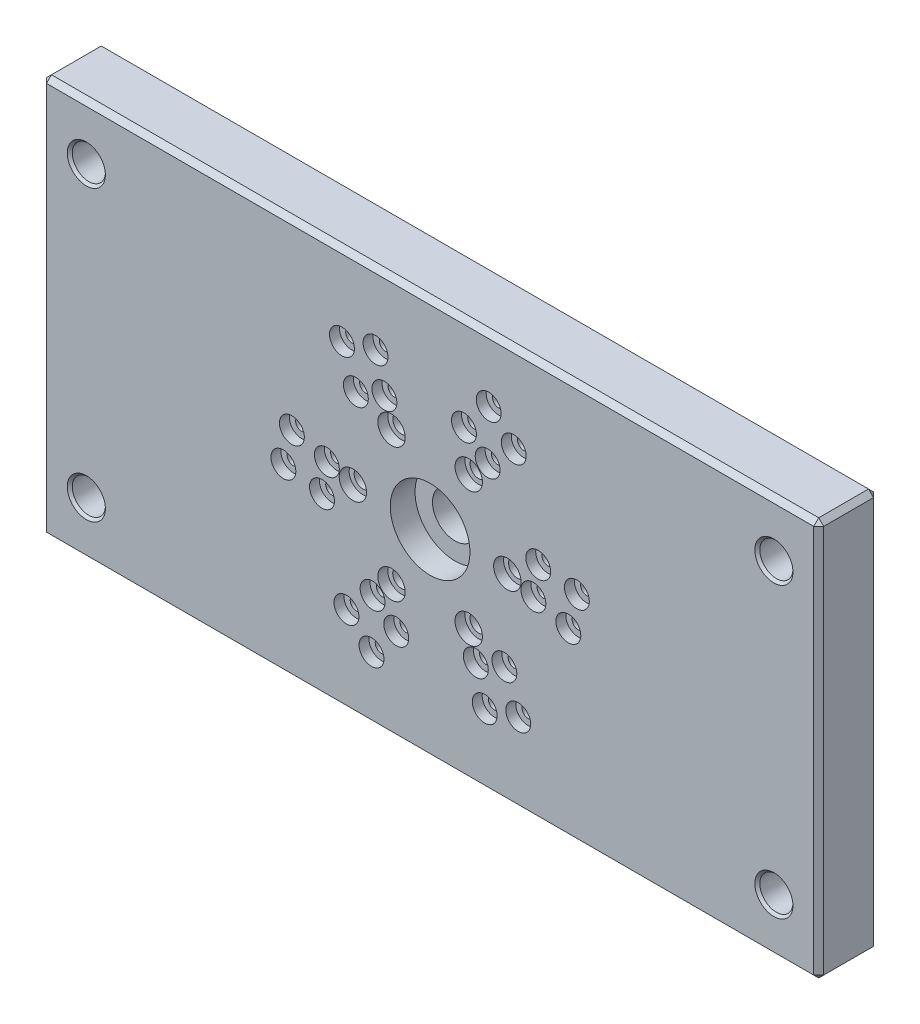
ISO-10303-21;
HEADER;
FILE_DESCRIPTION(('STEP AP214'),'2;1');
FILE_NAME('part.step','',(''),(''),'','','');
FILE_SCHEMA(('AUTOMOTIVE_DESIGN { 1 0 10303 214 1 1 1 1 }'));
ENDSEC;
DATA;
#1=APPLICATION_CONTEXT('core data for automotive mechanical design processes');
#2=APPLICATION_PROTOCOL_DEFINITION('international standard','automotive_design',2000,#1);
#3=PRODUCT_CONTEXT('',#1,'mechanical');
#4=PRODUCT('Part','Part','',(#3));
#5=PRODUCT_RELATED_PRODUCT_CATEGORY('part','',(#4));
#6=PRODUCT_DEFINITION_FORMATION('','',#4);
#7=PRODUCT_DEFINITION_CONTEXT('part definition',#1,'design');
#8=PRODUCT_DEFINITION('design','',#6,#7);
#9=PRODUCT_DEFINITION_SHAPE('','',#8);
#10=(LENGTH_UNIT() NAMED_UNIT(*) SI_UNIT(.MILLI.,.METRE.));
#11=(NAMED_UNIT(*) PLANE_ANGLE_UNIT() SI_UNIT($,.RADIAN.));
#12=(NAMED_UNIT(*) SI_UNIT($,.STERADIAN.) SOLID_ANGLE_UNIT());
#13=UNCERTAINTY_MEASURE_WITH_UNIT(LENGTH_MEASURE(1.E-05),#10,'distance_accuracy_value','');
#14=(GEOMETRIC_REPRESENTATION_CONTEXT(3) GLOBAL_UNCERTAINTY_ASSIGNED_CONTEXT((#13)) GLOBAL_UNIT_ASSIGNED_CONTEXT((#10,
#11,#12)) REPRESENTATION_CONTEXT('',''));
#15=CARTESIAN_POINT('',(0.,0.,0.));
#16=DIRECTION('',(0.,0.,1.));
#17=DIRECTION('',(1.,0.,0.));
#18=AXIS2_PLACEMENT_3D('',#15,#16,#17);
#19=CARTESIAN_POINT('',(0.499999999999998,0.5,11.));
#20=DIRECTION('',(-0.577350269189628,-0.577350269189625,0.577350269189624));
#21=DIRECTION('',(0.707106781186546,-0.707106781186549,0.));
#22=AXIS2_PLACEMENT_3D('',#19,#20,#21);
#23=PLANE('',#22);
#24=DIRECTION('',(0.707106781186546,0.,0.707106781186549));
#25=VECTOR('',#24,1.);
#26=CARTESIAN_POINT('',(0.499999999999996,1.,11.5));
#27=LINE('',#26,#25);
#28=CARTESIAN_POINT('',(0.,1.,11.));
#29=VERTEX_POINT('',#28);
#30=CARTESIAN_POINT('',(0.999999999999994,1.,12.));
#31=VERTEX_POINT('',#30);
#32=EDGE_CURVE('E105',#29,#31,#27,.T.);
#33=ORIENTED_EDGE('',*,*,#32,.F.);
#34=DIRECTION('',(0.707106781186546,-0.707106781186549,0.));
#35=VECTOR('',#34,1.);
#36=CARTESIAN_POINT('',(0.499999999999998,0.5,11.));
#37=LINE('',#36,#35);
#38=CARTESIAN_POINT('',(0.999999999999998,0.,11.));
#39=VERTEX_POINT('',#38);
#40=EDGE_CURVE('E563',#39,#29,#37,.F.);
#41=ORIENTED_EDGE('',*,*,#40,.F.);
#42=DIRECTION('',(0.,-0.707106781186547,-0.707106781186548));
#43=VECTOR('',#42,1.);
#44=CARTESIAN_POINT('',(1.,0.499999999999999,11.5));
#45=LINE('',#44,#43);
#46=EDGE_CURVE('E116',#31,#39,#45,.T.);
#47=ORIENTED_EDGE('',*,*,#46,.F.);
#48=EDGE_LOOP('',(#33,#41,#47));
#49=FACE_BOUND('',#48,.T.);
#50=ADVANCED_FACE('F17',(#49),#23,.T.);
#51=CARTESIAN_POINT('',(155.5,0.499999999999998,11.));
#52=DIRECTION('',(0.57735026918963,-0.57735026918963,0.577350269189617));
#53=DIRECTION('',(0.707106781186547,0.707106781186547,0.));
#54=AXIS2_PLACEMENT_3D('',#51,#52,#53);
#55=PLANE('',#54);
#56=DIRECTION('',(0.70710678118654,0.,-0.707106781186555));
#57=VECTOR('',#56,1.);
#58=CARTESIAN_POINT('',(155.5,1.,11.5));
#59=LINE('',#58,#57);
#60=CARTESIAN_POINT('',(155.,0.999999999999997,12.));
#61=VERTEX_POINT('',#60);
#62=CARTESIAN_POINT('',(156.,0.999999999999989,11.));
#63=VERTEX_POINT('',#62);
#64=EDGE_CURVE('E559',#61,#63,#59,.T.);
#65=ORIENTED_EDGE('',*,*,#64,.F.);
#66=DIRECTION('',(0.,-0.707106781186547,-0.707106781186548));
#67=VECTOR('',#66,1.);
#68=CARTESIAN_POINT('',(155.,0.499999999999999,11.5));
#69=LINE('',#68,#67);
#70=CARTESIAN_POINT('',(155.,0.,11.));
#71=VERTEX_POINT('',#70);
#72=EDGE_CURVE('E568',#71,#61,#69,.F.);
#73=ORIENTED_EDGE('',*,*,#72,.F.);
#74=DIRECTION('',(0.707106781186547,0.707106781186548,0.));
#75=VECTOR('',#74,1.);
#76=CARTESIAN_POINT('',(155.5,0.499999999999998,11.));
#77=LINE('',#76,#75);
#78=EDGE_CURVE('E554',#63,#71,#77,.F.);
#79=ORIENTED_EDGE('',*,*,#78,.F.);
#80=EDGE_LOOP('',(#65,#73,#79));
#81=FACE_BOUND('',#80,.T.);
#82=ADVANCED_FACE('F677',(#81),#55,.T.);
#83=CARTESIAN_POINT('',(0.,79.,11.));
#84=DIRECTION('',(-0.577350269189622,0.577350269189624,0.577350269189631));
#85=DIRECTION('',(0.,-0.707106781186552,0.707106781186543));
#86=AXIS2_PLACEMENT_3D('',#83,#84,#85);
#87=PLANE('',#86);
#88=DIRECTION('',(-0.707106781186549,-0.707106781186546,0.));
#89=VECTOR('',#88,1.);
#90=CARTESIAN_POINT('',(0.499999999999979,79.5,11.));
#91=LINE('',#90,#89);
#92=CARTESIAN_POINT('',(0.,79.,11.));
#93=VERTEX_POINT('',#92);
#94=CARTESIAN_POINT('',(0.99999999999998,80.,11.));
#95=VERTEX_POINT('',#94);
#96=EDGE_CURVE('E138',#93,#95,#91,.F.);
#97=ORIENTED_EDGE('',*,*,#96,.F.);
#98=DIRECTION('',(0.707106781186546,0.,0.707106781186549));
#99=VECTOR('',#98,1.);
#100=CARTESIAN_POINT('',(0.499999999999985,79.,11.5));
#101=LINE('',#100,#99);
#102=CARTESIAN_POINT('',(0.999999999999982,79.,12.));
#103=VERTEX_POINT('',#102);
#104=EDGE_CURVE('E112',#103,#93,#101,.F.);
#105=ORIENTED_EDGE('',*,*,#104,.F.);
#106=DIRECTION('',(0.,-0.707106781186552,0.707106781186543));
#107=VECTOR('',#106,1.);
#108=CARTESIAN_POINT('',(0.99999999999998,79.5,11.5));
#109=LINE('',#108,#107);
#110=EDGE_CURVE('E127',#95,#103,#109,.T.);
#111=ORIENTED_EDGE('',*,*,#110,.F.);
#112=EDGE_LOOP('',(#97,#105,#111));
#113=FACE_BOUND('',#112,.T.);
#114=ADVANCED_FACE('F137',(#113),#87,.T.);
#115=CARTESIAN_POINT('',(155.5,79.5,11.));
#116=DIRECTION('',(0.577350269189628,0.577350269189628,0.577350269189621));
#117=DIRECTION('',(-0.707106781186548,0.707106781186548,0.));
#118=AXIS2_PLACEMENT_3D('',#115,#116,#117);
#119=PLANE('',#118);
#120=DIRECTION('',(0.,-0.707106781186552,0.707106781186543));
#121=VECTOR('',#120,1.);
#122=CARTESIAN_POINT('',(155.,79.5,11.5));
#123=LINE('',#122,#121);
#124=CARTESIAN_POINT('',(155.,79.,12.));
#125=VERTEX_POINT('',#124);
#126=CARTESIAN_POINT('',(155.,80.,11.));
#127=VERTEX_POINT('',#126);
#128=EDGE_CURVE('E135',#125,#127,#123,.F.);
#129=ORIENTED_EDGE('',*,*,#128,.F.);
#130=DIRECTION('',(0.70710678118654,0.,-0.707106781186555));
#131=VECTOR('',#130,1.);
#132=CARTESIAN_POINT('',(155.5,79.,11.5));
#133=LINE('',#132,#131);
#134=CARTESIAN_POINT('',(156.,79.,11.));
#135=VERTEX_POINT('',#134);
#136=EDGE_CURVE('E557',#135,#125,#133,.F.);
#137=ORIENTED_EDGE('',*,*,#136,.F.);
#138=DIRECTION('',(-0.707106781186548,0.707106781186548,0.));
#139=VECTOR('',#138,1.);
#140=CARTESIAN_POINT('',(155.5,79.5,11.));
#141=LINE('',#140,#139);
#142=EDGE_CURVE('E126',#127,#135,#141,.F.);
#143=ORIENTED_EDGE('',*,*,#142,.F.);
#144=EDGE_LOOP('',(#129,#137,#143));
#145=FACE_BOUND('',#144,.T.);
#146=ADVANCED_FACE('F739',(#145),#119,.T.);
#147=CARTESIAN_POINT('',(78.,40.,12.));
#148=DIRECTION('',(0.,0.,1.));
#149=DIRECTION('',(1.,0.,0.));
#150=AXIS2_PLACEMENT_3D('',#147,#148,#149);
#151=PLANE('',#150);
#152=CARTESIAN_POINT('',(9.00000000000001,69.,12.000000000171));
#153=DIRECTION('',(0.,0.,1.));
#154=DIRECTION('',(1.,0.,0.));
#155=AXIS2_PLACEMENT_3D('',#152,#153,#154);
#156=CIRCLE('',#155,3.82349999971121);
#157=CARTESIAN_POINT('',(12.8234999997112,69.,12.000000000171));
#158=VERTEX_POINT('',#157);
#159=EDGE_CURVE('E444',#158,#158,#156,.F.);
#160=ORIENTED_EDGE('',*,*,#159,.T.);
#161=EDGE_LOOP('',(#160));
#162=FACE_BOUND('',#161,.T.);
#163=CARTESIAN_POINT('',(147.,69.,12.0000000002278));
#164=DIRECTION('',(0.,0.,1.));
#165=DIRECTION('',(1.,0.,0.));
#166=AXIS2_PLACEMENT_3D('',#163,#164,#165);
#167=CIRCLE('',#166,3.82349999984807);
#168=CARTESIAN_POINT('',(150.823499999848,69.,12.0000000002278));
#169=VERTEX_POINT('',#168);
#170=EDGE_CURVE('E434',#169,#169,#167,.F.);
#171=ORIENTED_EDGE('',*,*,#170,.T.);
#172=EDGE_LOOP('',(#171));
#173=FACE_BOUND('',#172,.T.);
#174=CARTESIAN_POINT('',(9.00000000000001,11.,12.000000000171));
#175=DIRECTION('',(0.,0.,1.));
#176=DIRECTION('',(1.,0.,0.));
#177=AXIS2_PLACEMENT_3D('',#174,#175,#176);
#178=CIRCLE('',#177,3.82349999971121);
#179=CARTESIAN_POINT('',(12.8234999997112,11.,12.000000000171));
#180=VERTEX_POINT('',#179);
#181=EDGE_CURVE('E438',#180,#180,#178,.F.);
#182=ORIENTED_EDGE('',*,*,#181,.T.);
#183=EDGE_LOOP('',(#182));
#184=FACE_BOUND('',#183,.T.);
#185=CARTESIAN_POINT('',(147.,11.,12.0000000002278));
#186=DIRECTION('',(0.,0.,1.));
#187=DIRECTION('',(1.,0.,0.));
#188=AXIS2_PLACEMENT_3D('',#185,#186,#187);
#189=CIRCLE('',#188,3.82349999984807);
#190=CARTESIAN_POINT('',(150.823499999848,11.,12.0000000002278));
#191=VERTEX_POINT('',#190);
#192=EDGE_CURVE('E441',#191,#191,#189,.F.);
#193=ORIENTED_EDGE('',*,*,#192,.T.);
#194=EDGE_LOOP('',(#193));
#195=FACE_BOUND('',#194,.T.);
#196=CARTESIAN_POINT('',(78.,40.,12.));
#197=DIRECTION('',(0.,0.,1.));
#198=DIRECTION('',(1.,0.,0.));
#199=AXIS2_PLACEMENT_3D('',#196,#197,#198);
#200=CIRCLE('',#199,8.);
#201=CARTESIAN_POINT('',(86.,40.,12.));
#202=VERTEX_POINT('',#201);
#203=EDGE_CURVE('E447',#202,#202,#200,.F.);
#204=ORIENTED_EDGE('',*,*,#203,.T.);
#205=EDGE_LOOP('',(#204));
#206=FACE_BOUND('',#205,.T.);
#207=CARTESIAN_POINT('',(62.4999999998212,40.0029999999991,12.));
#208=DIRECTION('',(0.,0.,1.));
#209=DIRECTION('',(1.,0.,0.));
#210=AXIS2_PLACEMENT_3D('',#207,#208,#209);
#211=CIRCLE('',#210,2.75);
#212=CARTESIAN_POINT('',(65.2499999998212,40.0029999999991,12.));
#213=VERTEX_POINT('',#212);
#214=EDGE_CURVE('E450',#213,#213,#211,.F.);
#215=ORIENTED_EDGE('',*,*,#214,.T.);
#216=EDGE_LOOP('',(#215));
#217=FACE_BOUND('',#216,.T.);
#218=CARTESIAN_POINT('',(50.2557164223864,43.367147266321,12.));
#219=DIRECTION('',(0.,0.,1.));
#220=DIRECTION('',(1.,0.,0.));
#221=AXIS2_PLACEMENT_3D('',#218,#219,#220);
#222=CIRCLE('',#221,2.5);
#223=CARTESIAN_POINT('',(52.7557164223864,43.367147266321,12.));
#224=VERTEX_POINT('',#223);
#225=EDGE_CURVE('E453',#224,#224,#222,.F.);
#226=ORIENTED_EDGE('',*,*,#225,.T.);
#227=EDGE_LOOP('',(#226));
#228=FACE_BOUND('',#227,.T.);
#229=CARTESIAN_POINT('',(48.5468446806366,36.5789400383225,12.));
#230=DIRECTION('',(0.,0.,1.));
#231=DIRECTION('',(1.,0.,0.));
#232=AXIS2_PLACEMENT_3D('',#229,#230,#231);
#233=CIRCLE('',#232,2.5);
#234=CARTESIAN_POINT('',(51.0468446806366,36.5789400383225,12.));
#235=VERTEX_POINT('',#234);
#236=EDGE_CURVE('E456',#235,#235,#233,.F.);
#237=ORIENTED_EDGE('',*,*,#236,.T.);
#238=EDGE_LOOP('',(#237));
#239=FACE_BOUND('',#238,.T.);
#240=CARTESIAN_POINT('',(56.3018832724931,35.3187967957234,12.));
#241=DIRECTION('',(0.,0.,1.));
#242=DIRECTION('',(1.,0.,0.));
#243=AXIS2_PLACEMENT_3D('',#240,#241,#242);
#244=CIRCLE('',#243,2.5);
#245=CARTESIAN_POINT('',(58.8018832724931,35.3187967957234,12.));
#246=VERTEX_POINT('',#245);
#247=EDGE_CURVE('E459',#246,#246,#244,.F.);
#248=ORIENTED_EDGE('',*,*,#247,.T.);
#249=EDGE_LOOP('',(#248));
#250=FACE_BOUND('',#249,.T.);
#251=CARTESIAN_POINT('',(57.2751539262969,41.3693741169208,12.));
#252=DIRECTION('',(0.,0.,1.));
#253=DIRECTION('',(1.,0.,0.));
#254=AXIS2_PLACEMENT_3D('',#251,#252,#253);
#255=CIRCLE('',#254,2.5);
#256=CARTESIAN_POINT('',(59.7751539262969,41.3693741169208,12.));
#257=VERTEX_POINT('',#256);
#258=EDGE_CURVE('E462',#257,#257,#255,.F.);
#259=ORIENTED_EDGE('',*,*,#258,.T.);
#260=EDGE_LOOP('',(#259));
#261=FACE_BOUND('',#260,.T.);
#262=CARTESIAN_POINT('',(70.2474019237,26.5781062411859,12.));
#263=DIRECTION('',(0.,0.,1.));
#264=DIRECTION('',(1.,0.,0.));
#265=AXIS2_PLACEMENT_3D('',#262,#263,#264);
#266=CIRCLE('',#265,2.75);
#267=CARTESIAN_POINT('',(72.9974019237,26.5781062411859,12.));
#268=VERTEX_POINT('',#267);
#269=EDGE_CURVE('E465',#268,#268,#266,.F.);
#270=ORIENTED_EDGE('',*,*,#269,.T.);
#271=EDGE_LOOP('',(#270));
#272=FACE_BOUND('',#271,.T.);
#273=CARTESIAN_POINT('',(71.2049825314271,18.8682780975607,12.));
#274=DIRECTION('',(0.,0.,1.));
#275=DIRECTION('',(1.,0.,0.));
#276=AXIS2_PLACEMENT_3D('',#273,#274,#275);
#277=CIRCLE('',#276,2.5);
#278=CARTESIAN_POINT('',(73.7049825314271,18.8682780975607,12.));
#279=VERTEX_POINT('',#278);
#280=EDGE_CURVE('E468',#279,#279,#277,.F.);
#281=ORIENTED_EDGE('',*,*,#280,.T.);
#282=EDGE_LOOP('',(#281));
#283=FACE_BOUND('',#282,.T.);
#284=CARTESIAN_POINT('',(66.2361471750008,12.7822892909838,12.));
#285=DIRECTION('',(0.,0.,1.));
#286=DIRECTION('',(1.,0.,0.));
#287=AXIS2_PLACEMENT_3D('',#284,#285,#286);
#288=CIRCLE('',#287,2.5);
#289=CARTESIAN_POINT('',(68.7361471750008,12.7822892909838,12.));
#290=VERTEX_POINT('',#289);
#291=EDGE_CURVE('E471',#290,#290,#288,.F.);
#292=ORIENTED_EDGE('',*,*,#291,.T.);
#293=EDGE_LOOP('',(#292));
#294=FACE_BOUND('',#293,.T.);
#295=CARTESIAN_POINT('',(61.2118231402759,17.6563192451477,12.));
#296=DIRECTION('',(0.,0.,1.));
#297=DIRECTION('',(1.,0.,0.));
#298=AXIS2_PLACEMENT_3D('',#295,#296,#297);
#299=CIRCLE('',#298,2.5);
#300=CARTESIAN_POINT('',(63.7118231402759,17.6563192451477,12.));
#301=VERTEX_POINT('',#300);
#302=EDGE_CURVE('E474',#301,#301,#299,.F.);
#303=ORIENTED_EDGE('',*,*,#302,.T.);
#304=EDGE_LOOP('',(#303));
#305=FACE_BOUND('',#304,.T.);
#306=CARTESIAN_POINT('',(66.4516641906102,22.7364438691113,12.));
#307=DIRECTION('',(0.,0.,1.));
#308=DIRECTION('',(1.,0.,0.));
#309=AXIS2_PLACEMENT_3D('',#306,#307,#308);
#310=CIRCLE('',#309,2.5);
#311=CARTESIAN_POINT('',(68.9516641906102,22.7364438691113,12.));
#312=VERTEX_POINT('',#311);
#313=EDGE_CURVE('E477',#312,#312,#310,.F.);
#314=ORIENTED_EDGE('',*,*,#313,.T.);
#315=EDGE_LOOP('',(#314));
#316=FACE_BOUND('',#315,.T.);
#317=CARTESIAN_POINT('',(85.7474019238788,26.5751062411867,12.));
#318=DIRECTION('',(0.,0.,1.));
#319=DIRECTION('',(1.,0.,0.));
#320=AXIS2_PLACEMENT_3D('',#317,#318,#319);
#321=CIRCLE('',#320,2.75);
#322=CARTESIAN_POINT('',(88.4974019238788,26.5751062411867,12.));
#323=VERTEX_POINT('',#322);
#324=EDGE_CURVE('E480',#323,#323,#321,.F.);
#325=ORIENTED_EDGE('',*,*,#324,.T.);
#326=EDGE_LOOP('',(#325));
#327=FACE_BOUND('',#326,.T.);
#328=CARTESIAN_POINT('',(92.9030992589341,23.5494813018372,12.));
#329=DIRECTION('',(0.,0.,1.));
#330=DIRECTION('',(1.,0.,0.));
#331=AXIS2_PLACEMENT_3D('',#328,#329,#330);
#332=CIRCLE('',#331,2.5);
#333=CARTESIAN_POINT('',(95.4030992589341,23.5494813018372,12.));
#334=VERTEX_POINT('',#333);
#335=EDGE_CURVE('E483',#334,#334,#332,.F.);
#336=ORIENTED_EDGE('',*,*,#335,.T.);
#337=EDGE_LOOP('',(#336));
#338=FACE_BOUND('',#337,.T.);
#339=CARTESIAN_POINT('',(95.6893024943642,16.2033492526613,12.));
#340=DIRECTION('',(0.,0.,1.));
#341=DIRECTION('',(1.,0.,0.));
#342=AXIS2_PLACEMENT_3D('',#339,#340,#341);
#343=CIRCLE('',#342,2.5);
#344=CARTESIAN_POINT('',(98.1893024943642,16.2033492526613,12.));
#345=VERTEX_POINT('',#344);
#346=EDGE_CURVE('E486',#345,#345,#343,.F.);
#347=ORIENTED_EDGE('',*,*,#346,.T.);
#348=EDGE_LOOP('',(#347));
#349=FACE_BOUND('',#348,.T.);
#350=CARTESIAN_POINT('',(88.9561067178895,14.2891719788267,12.));
#351=DIRECTION('',(0.,0.,1.));
#352=DIRECTION('',(1.,0.,0.));
#353=AXIS2_PLACEMENT_3D('',#350,#351,#352);
#354=CIRCLE('',#353,2.5);
#355=CARTESIAN_POINT('',(91.4561067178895,14.2891719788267,12.));
#356=VERTEX_POINT('',#355);
#357=EDGE_CURVE('E489',#356,#356,#354,.F.);
#358=ORIENTED_EDGE('',*,*,#357,.T.);
#359=EDGE_LOOP('',(#358));
#360=FACE_BOUND('',#359,.T.);
#361=CARTESIAN_POINT('',(87.1765102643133,21.3670697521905,12.));
#362=DIRECTION('',(0.,0.,1.));
#363=DIRECTION('',(1.,0.,0.));
#364=AXIS2_PLACEMENT_3D('',#361,#362,#363);
#365=CIRCLE('',#364,2.5);
#366=CARTESIAN_POINT('',(89.6765102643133,21.3670697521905,12.));
#367=VERTEX_POINT('',#366);
#368=EDGE_CURVE('E492',#367,#367,#365,.F.);
#369=ORIENTED_EDGE('',*,*,#368,.T.);
#370=EDGE_LOOP('',(#369));
#371=FACE_BOUND('',#370,.T.);
#372=CARTESIAN_POINT('',(93.5000000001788,39.9970000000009,12.));
#373=DIRECTION('',(0.,0.,1.));
#374=DIRECTION('',(1.,0.,0.));
#375=AXIS2_PLACEMENT_3D('',#372,#373,#374);
#376=CIRCLE('',#375,2.75);
#377=CARTESIAN_POINT('',(96.2500000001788,39.9970000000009,12.));
#378=VERTEX_POINT('',#377);
#379=EDGE_CURVE('E495',#378,#378,#376,.F.);
#380=ORIENTED_EDGE('',*,*,#379,.T.);
#381=EDGE_LOOP('',(#380));
#382=FACE_BOUND('',#381,.T.);
#383=CARTESIAN_POINT('',(99.6981167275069,44.6812032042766,12.));
#384=DIRECTION('',(0.,0.,1.));
#385=DIRECTION('',(1.,0.,0.));
#386=AXIS2_PLACEMENT_3D('',#383,#384,#385);
#387=CIRCLE('',#386,2.5);
#388=CARTESIAN_POINT('',(102.198116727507,44.6812032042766,12.));
#389=VERTEX_POINT('',#388);
#390=EDGE_CURVE('E498',#389,#389,#387,.F.);
#391=ORIENTED_EDGE('',*,*,#390,.T.);
#392=EDGE_LOOP('',(#391));
#393=FACE_BOUND('',#392,.T.);
#394=CARTESIAN_POINT('',(107.453155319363,43.4210599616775,12.));
#395=DIRECTION('',(0.,0.,1.));
#396=DIRECTION('',(1.,0.,0.));
#397=AXIS2_PLACEMENT_3D('',#394,#395,#396);
#398=CIRCLE('',#397,2.5);
#399=CARTESIAN_POINT('',(109.953155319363,43.4210599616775,12.));
#400=VERTEX_POINT('',#399);
#401=EDGE_CURVE('E501',#400,#400,#398,.F.);
#402=ORIENTED_EDGE('',*,*,#401,.T.);
#403=EDGE_LOOP('',(#402));
#404=FACE_BOUND('',#403,.T.);
#405=CARTESIAN_POINT('',(105.744283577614,36.632852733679,12.));
#406=DIRECTION('',(0.,0.,1.));
#407=DIRECTION('',(1.,0.,0.));
#408=AXIS2_PLACEMENT_3D('',#405,#406,#407);
#409=CIRCLE('',#408,2.5);
#410=CARTESIAN_POINT('',(108.244283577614,36.632852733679,12.));
#411=VERTEX_POINT('',#410);
#412=EDGE_CURVE('E504',#411,#411,#409,.F.);
#413=ORIENTED_EDGE('',*,*,#412,.T.);
#414=EDGE_LOOP('',(#413));
#415=FACE_BOUND('',#414,.T.);
#416=CARTESIAN_POINT('',(98.7248460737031,38.6306258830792,12.));
#417=DIRECTION('',(0.,0.,1.));
#418=DIRECTION('',(1.,0.,0.));
#419=AXIS2_PLACEMENT_3D('',#416,#417,#418);
#420=CIRCLE('',#419,2.5);
#421=CARTESIAN_POINT('',(101.224846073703,38.6306258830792,12.));
#422=VERTEX_POINT('',#421);
#423=EDGE_CURVE('E507',#422,#422,#420,.F.);
#424=ORIENTED_EDGE('',*,*,#423,.T.);
#425=EDGE_LOOP('',(#424));
#426=FACE_BOUND('',#425,.T.);
#427=CARTESIAN_POINT('',(85.7525980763,53.4218937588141,12.));
#428=DIRECTION('',(0.,0.,1.));
#429=DIRECTION('',(1.,0.,0.));
#430=AXIS2_PLACEMENT_3D('',#427,#428,#429);
#431=CIRCLE('',#430,2.75);
#432=CARTESIAN_POINT('',(88.5025980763,53.4218937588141,12.));
#433=VERTEX_POINT('',#432);
#434=EDGE_CURVE('E510',#433,#433,#431,.F.);
#435=ORIENTED_EDGE('',*,*,#434,.T.);
#436=EDGE_LOOP('',(#435));
#437=FACE_BOUND('',#436,.T.);
#438=CARTESIAN_POINT('',(84.7950174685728,61.1317219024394,12.));
#439=DIRECTION('',(0.,0.,1.));
#440=DIRECTION('',(1.,0.,0.));
#441=AXIS2_PLACEMENT_3D('',#438,#439,#440);
#442=CIRCLE('',#441,2.5);
#443=CARTESIAN_POINT('',(87.2950174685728,61.1317219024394,12.));
#444=VERTEX_POINT('',#443);
#445=EDGE_CURVE('E513',#444,#444,#442,.F.);
#446=ORIENTED_EDGE('',*,*,#445,.T.);
#447=EDGE_LOOP('',(#446));
#448=FACE_BOUND('',#447,.T.);
#449=CARTESIAN_POINT('',(89.7638528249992,67.2177107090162,12.));
#450=DIRECTION('',(0.,0.,1.));
#451=DIRECTION('',(1.,0.,0.));
#452=AXIS2_PLACEMENT_3D('',#449,#450,#451);
#453=CIRCLE('',#452,2.5);
#454=CARTESIAN_POINT('',(92.2638528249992,67.2177107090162,12.));
#455=VERTEX_POINT('',#454);
#456=EDGE_CURVE('E516',#455,#455,#453,.F.);
#457=ORIENTED_EDGE('',*,*,#456,.T.);
#458=EDGE_LOOP('',(#457));
#459=FACE_BOUND('',#458,.T.);
#460=CARTESIAN_POINT('',(94.7881768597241,62.3436807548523,12.));
#461=DIRECTION('',(0.,0.,1.));
#462=DIRECTION('',(1.,0.,0.));
#463=AXIS2_PLACEMENT_3D('',#460,#461,#462);
#464=CIRCLE('',#463,2.5);
#465=CARTESIAN_POINT('',(97.2881768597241,62.3436807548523,12.));
#466=VERTEX_POINT('',#465);
#467=EDGE_CURVE('E519',#466,#466,#464,.F.);
#468=ORIENTED_EDGE('',*,*,#467,.T.);
#469=EDGE_LOOP('',(#468));
#470=FACE_BOUND('',#469,.T.);
#471=CARTESIAN_POINT('',(89.5483358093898,57.2635561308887,12.));
#472=DIRECTION('',(0.,0.,1.));
#473=DIRECTION('',(1.,0.,0.));
#474=AXIS2_PLACEMENT_3D('',#471,#472,#473);
#475=CIRCLE('',#474,2.5);
#476=CARTESIAN_POINT('',(92.0483358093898,57.2635561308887,12.));
#477=VERTEX_POINT('',#476);
#478=EDGE_CURVE('E522',#477,#477,#475,.F.);
#479=ORIENTED_EDGE('',*,*,#478,.T.);
#480=EDGE_LOOP('',(#479));
#481=FACE_BOUND('',#480,.T.);
#482=CARTESIAN_POINT('',(70.2525980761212,53.4248937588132,12.));
#483=DIRECTION('',(0.,0.,1.));
#484=DIRECTION('',(1.,0.,0.));
#485=AXIS2_PLACEMENT_3D('',#482,#483,#484);
#486=CIRCLE('',#485,2.75);
#487=CARTESIAN_POINT('',(73.0025980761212,53.4248937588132,12.));
#488=VERTEX_POINT('',#487);
#489=EDGE_CURVE('E525',#488,#488,#486,.F.);
#490=ORIENTED_EDGE('',*,*,#489,.T.);
#491=EDGE_LOOP('',(#490));
#492=FACE_BOUND('',#491,.T.);
#493=CARTESIAN_POINT('',(63.0969007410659,56.4505186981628,12.));
#494=DIRECTION('',(0.,0.,1.));
#495=DIRECTION('',(1.,0.,0.));
#496=AXIS2_PLACEMENT_3D('',#493,#494,#495);
#497=CIRCLE('',#496,2.5);
#498=CARTESIAN_POINT('',(65.596900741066,56.4505186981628,12.));
#499=VERTEX_POINT('',#498);
#500=EDGE_CURVE('E528',#499,#499,#497,.F.);
#501=ORIENTED_EDGE('',*,*,#500,.T.);
#502=EDGE_LOOP('',(#501));
#503=FACE_BOUND('',#502,.T.);
#504=CARTESIAN_POINT('',(60.3106975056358,63.7966507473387,12.));
#505=DIRECTION('',(0.,0.,1.));
#506=DIRECTION('',(1.,0.,0.));
#507=AXIS2_PLACEMENT_3D('',#504,#505,#506);
#508=CIRCLE('',#507,2.5);
#509=CARTESIAN_POINT('',(62.8106975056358,63.7966507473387,12.));
#510=VERTEX_POINT('',#509);
#511=EDGE_CURVE('E531',#510,#510,#508,.F.);
#512=ORIENTED_EDGE('',*,*,#511,.T.);
#513=EDGE_LOOP('',(#512));
#514=FACE_BOUND('',#513,.T.);
#515=CARTESIAN_POINT('',(67.0438932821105,65.7108280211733,12.));
#516=DIRECTION('',(0.,0.,1.));
#517=DIRECTION('',(1.,0.,0.));
#518=AXIS2_PLACEMENT_3D('',#515,#516,#517);
#519=CIRCLE('',#518,2.5);
#520=CARTESIAN_POINT('',(69.5438932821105,65.7108280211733,12.));
#521=VERTEX_POINT('',#520);
#522=EDGE_CURVE('E533',#521,#521,#519,.F.);
#523=ORIENTED_EDGE('',*,*,#522,.T.);
#524=EDGE_LOOP('',(#523));
#525=FACE_BOUND('',#524,.T.);
#526=CARTESIAN_POINT('',(68.8234897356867,58.6329302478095,12.));
#527=DIRECTION('',(0.,0.,1.));
#528=DIRECTION('',(1.,0.,0.));
#529=AXIS2_PLACEMENT_3D('',#526,#527,#528);
#530=CIRCLE('',#529,2.5);
#531=CARTESIAN_POINT('',(71.3234897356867,58.6329302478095,12.));
#532=VERTEX_POINT('',#531);
#533=EDGE_CURVE('E20',#532,#532,#530,.F.);
#534=ORIENTED_EDGE('',*,*,#533,.T.);
#535=EDGE_LOOP('',(#534));
#536=FACE_BOUND('',#535,.T.);
#537=DIRECTION('',(0.,1.,0.));
#538=VECTOR('',#537,1.);
#539=CARTESIAN_POINT('',(155.,60.,12.));
#540=LINE('',#539,#538);
#541=EDGE_CURVE('E124',#125,#61,#540,.F.);
#542=ORIENTED_EDGE('',*,*,#541,.F.);
#543=DIRECTION('',(1.,0.,0.));
#544=VECTOR('',#543,1.);
#545=CARTESIAN_POINT('',(39.,79.,12.));
#546=LINE('',#545,#544);
#547=EDGE_CURVE('E120',#103,#125,#546,.T.);
#548=ORIENTED_EDGE('',*,*,#547,.F.);
#549=DIRECTION('',(0.,1.,0.));
#550=VECTOR('',#549,1.);
#551=CARTESIAN_POINT('',(0.999999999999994,20.,12.));
#552=LINE('',#551,#550);
#553=EDGE_CURVE('E108',#31,#103,#552,.T.);
#554=ORIENTED_EDGE('',*,*,#553,.F.);
#555=DIRECTION('',(1.,0.,0.));
#556=VECTOR('',#555,1.);
#557=CARTESIAN_POINT('',(117.,0.999999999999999,12.));
#558=LINE('',#557,#556);
#559=EDGE_CURVE('E565',#61,#31,#558,.F.);
#560=ORIENTED_EDGE('',*,*,#559,.F.);
#561=EDGE_LOOP('',(#542,#548,#554,#560));
#562=FACE_BOUND('',#561,.T.);
#563=ADVANCED_FACE('F122',(#162,#173,#184,#195,#206,#217,#228,#239,#250,#261,#272,#283,#294,
#305,#316,#327,#338,#349,#360,#371,#382,#393,#404,#415,#426,#437,#448,#459,#470,#481,#492,#503,
#514,#525,#536,#562),#151,.T.);
#564=CARTESIAN_POINT('',(0.499999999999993,20.,11.5));
#565=DIRECTION('',(-0.707106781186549,0.,0.707106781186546));
#566=DIRECTION('',(0.707106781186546,0.,0.707106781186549));
#567=AXIS2_PLACEMENT_3D('',#564,#565,#566);
#568=PLANE('',#567);
#569=ORIENTED_EDGE('',*,*,#32,.T.);
#570=ORIENTED_EDGE('',*,*,#553,.T.);
#571=ORIENTED_EDGE('',*,*,#104,.T.);
#572=DIRECTION('',(0.,1.,0.));
#573=VECTOR('',#572,1.);
#574=CARTESIAN_POINT('',(0.,0.,11.));
#575=LINE('',#574,#573);
#576=EDGE_CURVE('E601',#29,#93,#575,.T.);
#577=ORIENTED_EDGE('',*,*,#576,.F.);
#578=EDGE_LOOP('',(#569,#570,#571,#577));
#579=FACE_BOUND('',#578,.T.);
#580=ADVANCED_FACE('F110',(#579),#568,.T.);
#581=CARTESIAN_POINT('',(117.,0.499999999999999,11.5));
#582=DIRECTION('',(0.,-0.707106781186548,0.707106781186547));
#583=DIRECTION('',(0.,-0.707106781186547,-0.707106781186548));
#584=AXIS2_PLACEMENT_3D('',#581,#582,#583);
#585=PLANE('',#584);
#586=ORIENTED_EDGE('',*,*,#72,.T.);
#587=ORIENTED_EDGE('',*,*,#559,.T.);
#588=ORIENTED_EDGE('',*,*,#46,.T.);
#589=DIRECTION('',(1.,0.,0.));
#590=VECTOR('',#589,1.);
#591=CARTESIAN_POINT('',(156.,0.,11.));
#592=LINE('',#591,#590);
#593=EDGE_CURVE('E574',#71,#39,#592,.F.);
#594=ORIENTED_EDGE('',*,*,#593,.F.);
#595=EDGE_LOOP('',(#586,#587,#588,#594));
#596=FACE_BOUND('',#595,.T.);
#597=ADVANCED_FACE('F573',(#596),#585,.T.);
#598=CARTESIAN_POINT('',(0.499999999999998,0.5,0.));
#599=DIRECTION('',(-0.707106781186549,-0.707106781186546,0.));
#600=DIRECTION('',(0.707106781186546,-0.707106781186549,0.));
#601=AXIS2_PLACEMENT_3D('',#598,#599,#600);
#602=PLANE('',#601);
#603=DIRECTION('',(0.707106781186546,-0.707106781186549,0.));
#604=VECTOR('',#603,1.);
#605=CARTESIAN_POINT('',(0.499999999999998,0.5,1.));
#606=LINE('',#605,#604);
#607=CARTESIAN_POINT('',(0.,1.,1.));
#608=VERTEX_POINT('',#607);
#609=CARTESIAN_POINT('',(0.999999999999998,0.,1.));
#610=VERTEX_POINT('',#609);
#611=EDGE_CURVE('E561',#608,#610,#606,.T.);
#612=ORIENTED_EDGE('',*,*,#611,.T.);
#613=DIRECTION('',(0.,0.,-1.));
#614=VECTOR('',#613,1.);
#615=CARTESIAN_POINT('',(1.,0.,0.));
#616=LINE('',#615,#614);
#617=EDGE_CURVE('E583',#39,#610,#616,.T.);
#618=ORIENTED_EDGE('',*,*,#617,.F.);
#619=ORIENTED_EDGE('',*,*,#40,.T.);
#620=DIRECTION('',(0.,0.,1.));
#621=VECTOR('',#620,1.);
#622=CARTESIAN_POINT('',(0.,1.,0.));
#623=LINE('',#622,#621);
#624=EDGE_CURVE('E602',#608,#29,#623,.T.);
#625=ORIENTED_EDGE('',*,*,#624,.F.);
#626=EDGE_LOOP('',(#612,#618,#619,#625));
#627=FACE_BOUND('',#626,.T.);
#628=ADVANCED_FACE('F592',(#627),#602,.T.);
#629=CARTESIAN_POINT('',(155.5,60.,11.5));
#630=DIRECTION('',(0.707106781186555,0.,0.70710678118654));
#631=DIRECTION('',(0.70710678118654,0.,-0.707106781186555));
#632=AXIS2_PLACEMENT_3D('',#629,#630,#631);
#633=PLANE('',#632);
#634=ORIENTED_EDGE('',*,*,#136,.T.);
#635=ORIENTED_EDGE('',*,*,#541,.T.);
#636=ORIENTED_EDGE('',*,*,#64,.T.);
#637=DIRECTION('',(0.,1.,0.));
#638=VECTOR('',#637,1.);
#639=CARTESIAN_POINT('',(156.,80.,11.));
#640=LINE('',#639,#638);
#641=EDGE_CURVE('E596',#135,#63,#640,.F.);
#642=ORIENTED_EDGE('',*,*,#641,.F.);
#643=EDGE_LOOP('',(#634,#635,#636,#642));
#644=FACE_BOUND('',#643,.T.);
#645=ADVANCED_FACE('F740',(#644),#633,.T.);
#646=CARTESIAN_POINT('',(155.5,0.499999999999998,0.));
#647=DIRECTION('',(0.707106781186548,-0.707106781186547,0.));
#648=DIRECTION('',(0.707106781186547,0.707106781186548,0.));
#649=AXIS2_PLACEMENT_3D('',#646,#647,#648);
#650=PLANE('',#649);
#651=DIRECTION('',(0.707106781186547,0.707106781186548,0.));
#652=VECTOR('',#651,1.);
#653=CARTESIAN_POINT('',(155.5,0.499999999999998,1.));
#654=LINE('',#653,#652);
#655=CARTESIAN_POINT('',(155.,0.,1.));
#656=VERTEX_POINT('',#655);
#657=CARTESIAN_POINT('',(156.,0.999999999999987,1.));
#658=VERTEX_POINT('',#657);
#659=EDGE_CURVE('E552',#656,#658,#654,.T.);
#660=ORIENTED_EDGE('',*,*,#659,.T.);
#661=DIRECTION('',(0.,0.,-1.));
#662=VECTOR('',#661,1.);
#663=CARTESIAN_POINT('',(156.,1.,0.));
#664=LINE('',#663,#662);
#665=EDGE_CURVE('E630',#63,#658,#664,.T.);
#666=ORIENTED_EDGE('',*,*,#665,.F.);
#667=ORIENTED_EDGE('',*,*,#78,.T.);
#668=DIRECTION('',(0.,0.,-1.));
#669=VECTOR('',#668,1.);
#670=CARTESIAN_POINT('',(155.,0.,0.));
#671=LINE('',#670,#669);
#672=EDGE_CURVE('E586',#656,#71,#671,.F.);
#673=ORIENTED_EDGE('',*,*,#672,.F.);
#674=EDGE_LOOP('',(#660,#666,#667,#673));
#675=FACE_BOUND('',#674,.T.);
#676=ADVANCED_FACE('F679',(#675),#650,.T.);
#677=CARTESIAN_POINT('',(0.499999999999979,79.5,0.));
#678=DIRECTION('',(-0.707106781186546,0.707106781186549,0.));
#679=DIRECTION('',(-0.707106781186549,-0.707106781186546,0.));
#680=AXIS2_PLACEMENT_3D('',#677,#678,#679);
#681=PLANE('',#680);
#682=DIRECTION('',(0.707106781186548,0.707106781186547,0.));
#683=VECTOR('',#682,1.);
#684=CARTESIAN_POINT('',(0.,79.,0.999999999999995));
#685=LINE('',#684,#683);
#686=CARTESIAN_POINT('',(0.,79.,0.999999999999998));
#687=VERTEX_POINT('',#686);
#688=CARTESIAN_POINT('',(0.999999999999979,80.,0.999999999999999));
#689=VERTEX_POINT('',#688);
#690=EDGE_CURVE('E622',#687,#689,#685,.T.);
#691=ORIENTED_EDGE('',*,*,#690,.F.);
#692=DIRECTION('',(0.,0.,1.));
#693=VECTOR('',#692,1.);
#694=CARTESIAN_POINT('',(0.,79.,0.));
#695=LINE('',#694,#693);
#696=EDGE_CURVE('E437',#93,#687,#695,.F.);
#697=ORIENTED_EDGE('',*,*,#696,.F.);
#698=ORIENTED_EDGE('',*,*,#96,.T.);
#699=DIRECTION('',(0.,0.,1.));
#700=VECTOR('',#699,1.);
#701=CARTESIAN_POINT('',(0.999999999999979,80.,0.));
#702=LINE('',#701,#700);
#703=EDGE_CURVE('E625',#689,#95,#702,.T.);
#704=ORIENTED_EDGE('',*,*,#703,.F.);
#705=EDGE_LOOP('',(#691,#697,#698,#704));
#706=FACE_BOUND('',#705,.T.);
#707=ADVANCED_FACE('F623',(#706),#681,.T.);
#708=CARTESIAN_POINT('',(39.,79.5,11.5));
#709=DIRECTION('',(0.,0.707106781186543,0.707106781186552));
#710=DIRECTION('',(0.,-0.707106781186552,0.707106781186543));
#711=AXIS2_PLACEMENT_3D('',#708,#709,#710);
#712=PLANE('',#711);
#713=ORIENTED_EDGE('',*,*,#110,.T.);
#714=ORIENTED_EDGE('',*,*,#547,.T.);
#715=ORIENTED_EDGE('',*,*,#128,.T.);
#716=DIRECTION('',(1.,0.,0.));
#717=VECTOR('',#716,1.);
#718=CARTESIAN_POINT('',(0.,80.,11.));
#719=LINE('',#718,#717);
#720=EDGE_CURVE('E133',#95,#127,#719,.T.);
#721=ORIENTED_EDGE('',*,*,#720,.F.);
#722=EDGE_LOOP('',(#713,#714,#715,#721));
#723=FACE_BOUND('',#722,.T.);
#724=ADVANCED_FACE('F131',(#723),#712,.T.);
#725=CARTESIAN_POINT('',(155.5,79.5,0.));
#726=DIRECTION('',(0.707106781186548,0.707106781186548,0.));
#727=DIRECTION('',(-0.707106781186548,0.707106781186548,0.));
#728=AXIS2_PLACEMENT_3D('',#725,#726,#727);
#729=PLANE('',#728);
#730=DIRECTION('',(-0.707106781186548,0.707106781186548,0.));
#731=VECTOR('',#730,1.);
#732=CARTESIAN_POINT('',(155.5,79.5,1.));
#733=LINE('',#732,#731);
#734=CARTESIAN_POINT('',(156.,79.,1.));
#735=VERTEX_POINT('',#734);
#736=CARTESIAN_POINT('',(155.,80.,1.));
#737=VERTEX_POINT('',#736);
#738=EDGE_CURVE('E538',#735,#737,#733,.T.);
#739=ORIENTED_EDGE('',*,*,#738,.T.);
#740=DIRECTION('',(0.,0.,1.));
#741=VECTOR('',#740,1.);
#742=CARTESIAN_POINT('',(155.,80.,0.));
#743=LINE('',#742,#741);
#744=EDGE_CURVE('E433',#127,#737,#743,.F.);
#745=ORIENTED_EDGE('',*,*,#744,.F.);
#746=ORIENTED_EDGE('',*,*,#142,.T.);
#747=DIRECTION('',(0.,0.,-1.));
#748=VECTOR('',#747,1.);
#749=CARTESIAN_POINT('',(156.,79.,0.));
#750=LINE('',#749,#748);
#751=EDGE_CURVE('E593',#735,#135,#750,.F.);
#752=ORIENTED_EDGE('',*,*,#751,.F.);
#753=EDGE_LOOP('',(#739,#745,#746,#752));
#754=FACE_BOUND('',#753,.T.);
#755=ADVANCED_FACE('F735',(#754),#729,.T.);
#756=CARTESIAN_POINT('',(68.8234897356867,58.6329302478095,11.));
#757=DIRECTION('',(0.,0.,1.));
#758=DIRECTION('',(1.,0.,0.));
#759=AXIS2_PLACEMENT_3D('',#756,#757,#758);
#760=CYLINDRICAL_SURFACE('',#759,2.5);
#761=CARTESIAN_POINT('',(68.8234897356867,58.6329302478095,10.));
#762=DIRECTION('',(0.,0.,1.));
#763=DIRECTION('',(1.,0.,0.));
#764=AXIS2_PLACEMENT_3D('',#761,#762,#763);
#765=CIRCLE('',#764,2.5);
#766=CARTESIAN_POINT('',(71.3234897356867,58.6329302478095,10.));
#767=VERTEX_POINT('',#766);
#768=EDGE_CURVE('E430',#767,#767,#765,.T.);
#769=ORIENTED_EDGE('',*,*,#768,.F.);
#770=EDGE_LOOP('',(#769));
#771=FACE_BOUND('',#770,.T.);
#772=ORIENTED_EDGE('',*,*,#533,.F.);
#773=EDGE_LOOP('',(#772));
#774=FACE_BOUND('',#773,.T.);
#775=ADVANCED_FACE('F1204',(#771,#774),#760,.F.);
#776=CARTESIAN_POINT('',(67.0438932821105,65.7108280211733,11.));
#777=DIRECTION('',(0.,0.,1.));
#778=DIRECTION('',(1.,0.,0.));
#779=AXIS2_PLACEMENT_3D('',#776,#777,#778);
#780=CYLINDRICAL_SURFACE('',#779,2.5);
#781=CARTESIAN_POINT('',(67.0438932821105,65.7108280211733,10.));
#782=DIRECTION('',(0.,0.,1.));
#783=DIRECTION('',(1.,0.,0.));
#784=AXIS2_PLACEMENT_3D('',#781,#782,#783);
#785=CIRCLE('',#784,2.5);
#786=CARTESIAN_POINT('',(69.5438932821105,65.7108280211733,10.));
#787=VERTEX_POINT('',#786);
#788=EDGE_CURVE('E427',#787,#787,#785,.T.);
#789=ORIENTED_EDGE('',*,*,#788,.F.);
#790=EDGE_LOOP('',(#789));
#791=FACE_BOUND('',#790,.T.);
#792=ORIENTED_EDGE('',*,*,#522,.F.);
#793=EDGE_LOOP('',(#792));
#794=FACE_BOUND('',#793,.T.);
#795=ADVANCED_FACE('F1200',(#791,#794),#780,.F.);
#796=CARTESIAN_POINT('',(60.3106975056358,63.7966507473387,11.));
#797=DIRECTION('',(0.,0.,1.));
#798=DIRECTION('',(1.,0.,0.));
#799=AXIS2_PLACEMENT_3D('',#796,#797,#798);
#800=CYLINDRICAL_SURFACE('',#799,2.5);
#801=CARTESIAN_POINT('',(60.3106975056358,63.7966507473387,10.));
#802=DIRECTION('',(0.,0.,1.));
#803=DIRECTION('',(1.,0.,0.));
#804=AXIS2_PLACEMENT_3D('',#801,#802,#803);
#805=CIRCLE('',#804,2.5);
#806=CARTESIAN_POINT('',(62.8106975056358,63.7966507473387,10.));
#807=VERTEX_POINT('',#806);
#808=EDGE_CURVE('E424',#807,#807,#805,.T.);
#809=ORIENTED_EDGE('',*,*,#808,.F.);
#810=EDGE_LOOP('',(#809));
#811=FACE_BOUND('',#810,.T.);
#812=ORIENTED_EDGE('',*,*,#511,.F.);
#813=EDGE_LOOP('',(#812));
#814=FACE_BOUND('',#813,.T.);
#815=ADVANCED_FACE('F1196',(#811,#814),#800,.F.);
#816=CARTESIAN_POINT('',(63.0969007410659,56.4505186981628,11.));
#817=DIRECTION('',(0.,0.,1.));
#818=DIRECTION('',(1.,0.,0.));
#819=AXIS2_PLACEMENT_3D('',#816,#817,#818);
#820=CYLINDRICAL_SURFACE('',#819,2.5);
#821=CARTESIAN_POINT('',(63.0969007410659,56.4505186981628,10.));
#822=DIRECTION('',(0.,0.,1.));
#823=DIRECTION('',(1.,0.,0.));
#824=AXIS2_PLACEMENT_3D('',#821,#822,#823);
#825=CIRCLE('',#824,2.5);
#826=CARTESIAN_POINT('',(65.596900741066,56.4505186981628,10.));
#827=VERTEX_POINT('',#826);
#828=EDGE_CURVE('E421',#827,#827,#825,.T.);
#829=ORIENTED_EDGE('',*,*,#828,.F.);
#830=EDGE_LOOP('',(#829));
#831=FACE_BOUND('',#830,.T.);
#832=ORIENTED_EDGE('',*,*,#500,.F.);
#833=EDGE_LOOP('',(#832));
#834=FACE_BOUND('',#833,.T.);
#835=ADVANCED_FACE('F1192',(#831,#834),#820,.F.);
#836=CARTESIAN_POINT('',(70.2525980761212,53.4248937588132,11.));
#837=DIRECTION('',(0.,0.,1.));
#838=DIRECTION('',(1.,0.,0.));
#839=AXIS2_PLACEMENT_3D('',#836,#837,#838);
#840=CYLINDRICAL_SURFACE('',#839,2.75);
#841=CARTESIAN_POINT('',(70.2525980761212,53.4248937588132,10.));
#842=DIRECTION('',(0.,0.,1.));
#843=DIRECTION('',(1.,0.,0.));
#844=AXIS2_PLACEMENT_3D('',#841,#842,#843);
#845=CIRCLE('',#844,2.75);
#846=CARTESIAN_POINT('',(73.0025980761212,53.4248937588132,10.));
#847=VERTEX_POINT('',#846);
#848=EDGE_CURVE('E418',#847,#847,#845,.T.);
#849=ORIENTED_EDGE('',*,*,#848,.F.);
#850=EDGE_LOOP('',(#849));
#851=FACE_BOUND('',#850,.T.);
#852=ORIENTED_EDGE('',*,*,#489,.F.);
#853=EDGE_LOOP('',(#852));
#854=FACE_BOUND('',#853,.T.);
#855=ADVANCED_FACE('F1188',(#851,#854),#840,.F.);
#856=CARTESIAN_POINT('',(89.5483358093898,57.2635561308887,11.));
#857=DIRECTION('',(0.,0.,1.));
#858=DIRECTION('',(1.,0.,0.));
#859=AXIS2_PLACEMENT_3D('',#856,#857,#858);
#860=CYLINDRICAL_SURFACE('',#859,2.5);
#861=CARTESIAN_POINT('',(89.5483358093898,57.2635561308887,10.));
#862=DIRECTION('',(0.,0.,1.));
#863=DIRECTION('',(1.,0.,0.));
#864=AXIS2_PLACEMENT_3D('',#861,#862,#863);
#865=CIRCLE('',#864,2.5);
#866=CARTESIAN_POINT('',(92.0483358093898,57.2635561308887,10.));
#867=VERTEX_POINT('',#866);
#868=EDGE_CURVE('E415',#867,#867,#865,.T.);
#869=ORIENTED_EDGE('',*,*,#868,.F.);
#870=EDGE_LOOP('',(#869));
#871=FACE_BOUND('',#870,.T.);
#872=ORIENTED_EDGE('',*,*,#478,.F.);
#873=EDGE_LOOP('',(#872));
#874=FACE_BOUND('',#873,.T.);
#875=ADVANCED_FACE('F1184',(#871,#874),#860,.F.);
#876=CARTESIAN_POINT('',(94.7881768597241,62.3436807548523,11.));
#877=DIRECTION('',(0.,0.,1.));
#878=DIRECTION('',(1.,0.,0.));
#879=AXIS2_PLACEMENT_3D('',#876,#877,#878);
#880=CYLINDRICAL_SURFACE('',#879,2.5);
#881=CARTESIAN_POINT('',(94.7881768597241,62.3436807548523,10.));
#882=DIRECTION('',(0.,0.,1.));
#883=DIRECTION('',(1.,0.,0.));
#884=AXIS2_PLACEMENT_3D('',#881,#882,#883);
#885=CIRCLE('',#884,2.5);
#886=CARTESIAN_POINT('',(97.2881768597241,62.3436807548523,10.));
#887=VERTEX_POINT('',#886);
#888=EDGE_CURVE('E412',#887,#887,#885,.T.);
#889=ORIENTED_EDGE('',*,*,#888,.F.);
#890=EDGE_LOOP('',(#889));
#891=FACE_BOUND('',#890,.T.);
#892=ORIENTED_EDGE('',*,*,#467,.F.);
#893=EDGE_LOOP('',(#892));
#894=FACE_BOUND('',#893,.T.);
#895=ADVANCED_FACE('F1180',(#891,#894),#880,.F.);
#896=CARTESIAN_POINT('',(89.7638528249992,67.2177107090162,11.));
#897=DIRECTION('',(0.,0.,1.));
#898=DIRECTION('',(1.,0.,0.));
#899=AXIS2_PLACEMENT_3D('',#896,#897,#898);
#900=CYLINDRICAL_SURFACE('',#899,2.5);
#901=CARTESIAN_POINT('',(89.7638528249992,67.2177107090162,10.));
#902=DIRECTION('',(0.,0.,1.));
#903=DIRECTION('',(1.,0.,0.));
#904=AXIS2_PLACEMENT_3D('',#901,#902,#903);
#905=CIRCLE('',#904,2.5);
#906=CARTESIAN_POINT('',(92.2638528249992,67.2177107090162,10.));
#907=VERTEX_POINT('',#906);
#908=EDGE_CURVE('E409',#907,#907,#905,.T.);
#909=ORIENTED_EDGE('',*,*,#908,.F.);
#910=EDGE_LOOP('',(#909));
#911=FACE_BOUND('',#910,.T.);
#912=ORIENTED_EDGE('',*,*,#456,.F.);
#913=EDGE_LOOP('',(#912));
#914=FACE_BOUND('',#913,.T.);
#915=ADVANCED_FACE('F1176',(#911,#914),#900,.F.);
#916=CARTESIAN_POINT('',(84.7950174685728,61.1317219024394,11.));
#917=DIRECTION('',(0.,0.,1.));
#918=DIRECTION('',(1.,0.,0.));
#919=AXIS2_PLACEMENT_3D('',#916,#917,#918);
#920=CYLINDRICAL_SURFACE('',#919,2.5);
#921=CARTESIAN_POINT('',(84.7950174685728,61.1317219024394,10.));
#922=DIRECTION('',(0.,0.,1.));
#923=DIRECTION('',(1.,0.,0.));
#924=AXIS2_PLACEMENT_3D('',#921,#922,#923);
#925=CIRCLE('',#924,2.5);
#926=CARTESIAN_POINT('',(87.2950174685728,61.1317219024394,10.));
#927=VERTEX_POINT('',#926);
#928=EDGE_CURVE('E406',#927,#927,#925,.T.);
#929=ORIENTED_EDGE('',*,*,#928,.F.);
#930=EDGE_LOOP('',(#929));
#931=FACE_BOUND('',#930,.T.);
#932=ORIENTED_EDGE('',*,*,#445,.F.);
#933=EDGE_LOOP('',(#932));
#934=FACE_BOUND('',#933,.T.);
#935=ADVANCED_FACE('F1172',(#931,#934),#920,.F.);
#936=CARTESIAN_POINT('',(85.7525980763,53.4218937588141,11.));
#937=DIRECTION('',(0.,0.,1.));
#938=DIRECTION('',(1.,0.,0.));
#939=AXIS2_PLACEMENT_3D('',#936,#937,#938);
#940=CYLINDRICAL_SURFACE('',#939,2.75);
#941=CARTESIAN_POINT('',(85.7525980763,53.4218937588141,10.));
#942=DIRECTION('',(0.,0.,1.));
#943=DIRECTION('',(1.,0.,0.));
#944=AXIS2_PLACEMENT_3D('',#941,#942,#943);
#945=CIRCLE('',#944,2.75);
#946=CARTESIAN_POINT('',(88.5025980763,53.4218937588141,10.));
#947=VERTEX_POINT('',#946);
#948=EDGE_CURVE('E403',#947,#947,#945,.T.);
#949=ORIENTED_EDGE('',*,*,#948,.F.);
#950=EDGE_LOOP('',(#949));
#951=FACE_BOUND('',#950,.T.);
#952=ORIENTED_EDGE('',*,*,#434,.F.);
#953=EDGE_LOOP('',(#952));
#954=FACE_BOUND('',#953,.T.);
#955=ADVANCED_FACE('F1168',(#951,#954),#940,.F.);
#956=CARTESIAN_POINT('',(98.7248460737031,38.6306258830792,11.));
#957=DIRECTION('',(0.,0.,1.));
#958=DIRECTION('',(1.,0.,0.));
#959=AXIS2_PLACEMENT_3D('',#956,#957,#958);
#960=CYLINDRICAL_SURFACE('',#959,2.5);
#961=CARTESIAN_POINT('',(98.7248460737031,38.6306258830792,10.));
#962=DIRECTION('',(0.,0.,1.));
#963=DIRECTION('',(1.,0.,0.));
#964=AXIS2_PLACEMENT_3D('',#961,#962,#963);
#965=CIRCLE('',#964,2.5);
#966=CARTESIAN_POINT('',(101.224846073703,38.6306258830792,10.));
#967=VERTEX_POINT('',#966);
#968=EDGE_CURVE('E400',#967,#967,#965,.T.);
#969=ORIENTED_EDGE('',*,*,#968,.F.);
#970=EDGE_LOOP('',(#969));
#971=FACE_BOUND('',#970,.T.);
#972=ORIENTED_EDGE('',*,*,#423,.F.);
#973=EDGE_LOOP('',(#972));
#974=FACE_BOUND('',#973,.T.);
#975=ADVANCED_FACE('F1164',(#971,#974),#960,.F.);
#976=CARTESIAN_POINT('',(105.744283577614,36.632852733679,11.));
#977=DIRECTION('',(0.,0.,1.));
#978=DIRECTION('',(1.,0.,0.));
#979=AXIS2_PLACEMENT_3D('',#976,#977,#978);
#980=CYLINDRICAL_SURFACE('',#979,2.5);
#981=CARTESIAN_POINT('',(105.744283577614,36.632852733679,10.));
#982=DIRECTION('',(0.,0.,1.));
#983=DIRECTION('',(1.,0.,0.));
#984=AXIS2_PLACEMENT_3D('',#981,#982,#983);
#985=CIRCLE('',#984,2.5);
#986=CARTESIAN_POINT('',(108.244283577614,36.632852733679,10.));
#987=VERTEX_POINT('',#986);
#988=EDGE_CURVE('E397',#987,#987,#985,.T.);
#989=ORIENTED_EDGE('',*,*,#988,.F.);
#990=EDGE_LOOP('',(#989));
#991=FACE_BOUND('',#990,.T.);
#992=ORIENTED_EDGE('',*,*,#412,.F.);
#993=EDGE_LOOP('',(#992));
#994=FACE_BOUND('',#993,.T.);
#995=ADVANCED_FACE('F1160',(#991,#994),#980,.F.);
#996=CARTESIAN_POINT('',(107.453155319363,43.4210599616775,11.));
#997=DIRECTION('',(0.,0.,1.));
#998=DIRECTION('',(1.,0.,0.));
#999=AXIS2_PLACEMENT_3D('',#996,#997,#998);
#1000=CYLINDRICAL_SURFACE('',#999,2.5);
#1001=CARTESIAN_POINT('',(107.453155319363,43.4210599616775,10.));
#1002=DIRECTION('',(0.,0.,1.));
#1003=DIRECTION('',(1.,0.,0.));
#1004=AXIS2_PLACEMENT_3D('',#1001,#1002,#1003);
#1005=CIRCLE('',#1004,2.5);
#1006=CARTESIAN_POINT('',(109.953155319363,43.4210599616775,10.));
#1007=VERTEX_POINT('',#1006);
#1008=EDGE_CURVE('E394',#1007,#1007,#1005,.T.);
#1009=ORIENTED_EDGE('',*,*,#1008,.F.);
#1010=EDGE_LOOP('',(#1009));
#1011=FACE_BOUND('',#1010,.T.);
#1012=ORIENTED_EDGE('',*,*,#401,.F.);
#1013=EDGE_LOOP('',(#1012));
#1014=FACE_BOUND('',#1013,.T.);
#1015=ADVANCED_FACE('F1156',(#1011,#1014),#1000,.F.);
#1016=CARTESIAN_POINT('',(99.6981167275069,44.6812032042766,11.));
#1017=DIRECTION('',(0.,0.,1.));
#1018=DIRECTION('',(1.,0.,0.));
#1019=AXIS2_PLACEMENT_3D('',#1016,#1017,#1018);
#1020=CYLINDRICAL_SURFACE('',#1019,2.5);
#1021=CARTESIAN_POINT('',(99.6981167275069,44.6812032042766,10.));
#1022=DIRECTION('',(0.,0.,1.));
#1023=DIRECTION('',(1.,0.,0.));
#1024=AXIS2_PLACEMENT_3D('',#1021,#1022,#1023);
#1025=CIRCLE('',#1024,2.5);
#1026=CARTESIAN_POINT('',(102.198116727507,44.6812032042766,10.));
#1027=VERTEX_POINT('',#1026);
#1028=EDGE_CURVE('E391',#1027,#1027,#1025,.T.);
#1029=ORIENTED_EDGE('',*,*,#1028,.F.);
#1030=EDGE_LOOP('',(#1029));
#1031=FACE_BOUND('',#1030,.T.);
#1032=ORIENTED_EDGE('',*,*,#390,.F.);
#1033=EDGE_LOOP('',(#1032));
#1034=FACE_BOUND('',#1033,.T.);
#1035=ADVANCED_FACE('F1152',(#1031,#1034),#1020,.F.);
#1036=CARTESIAN_POINT('',(93.5000000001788,39.9970000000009,11.));
#1037=DIRECTION('',(0.,0.,1.));
#1038=DIRECTION('',(1.,0.,0.));
#1039=AXIS2_PLACEMENT_3D('',#1036,#1037,#1038);
#1040=CYLINDRICAL_SURFACE('',#1039,2.75);
#1041=CARTESIAN_POINT('',(93.5000000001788,39.9970000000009,10.));
#1042=DIRECTION('',(0.,0.,1.));
#1043=DIRECTION('',(1.,0.,0.));
#1044=AXIS2_PLACEMENT_3D('',#1041,#1042,#1043);
#1045=CIRCLE('',#1044,2.75);
#1046=CARTESIAN_POINT('',(96.2500000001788,39.9970000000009,10.));
#1047=VERTEX_POINT('',#1046);
#1048=EDGE_CURVE('E388',#1047,#1047,#1045,.T.);
#1049=ORIENTED_EDGE('',*,*,#1048,.F.);
#1050=EDGE_LOOP('',(#1049));
#1051=FACE_BOUND('',#1050,.T.);
#1052=ORIENTED_EDGE('',*,*,#379,.F.);
#1053=EDGE_LOOP('',(#1052));
#1054=FACE_BOUND('',#1053,.T.);
#1055=ADVANCED_FACE('F1148',(#1051,#1054),#1040,.F.);
#1056=CARTESIAN_POINT('',(87.1765102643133,21.3670697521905,11.));
#1057=DIRECTION('',(0.,0.,1.));
#1058=DIRECTION('',(1.,0.,0.));
#1059=AXIS2_PLACEMENT_3D('',#1056,#1057,#1058);
#1060=CYLINDRICAL_SURFACE('',#1059,2.5);
#1061=CARTESIAN_POINT('',(87.1765102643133,21.3670697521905,10.));
#1062=DIRECTION('',(0.,0.,1.));
#1063=DIRECTION('',(1.,0.,0.));
#1064=AXIS2_PLACEMENT_3D('',#1061,#1062,#1063);
#1065=CIRCLE('',#1064,2.5);
#1066=CARTESIAN_POINT('',(89.6765102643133,21.3670697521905,10.));
#1067=VERTEX_POINT('',#1066);
#1068=EDGE_CURVE('E385',#1067,#1067,#1065,.T.);
#1069=ORIENTED_EDGE('',*,*,#1068,.F.);
#1070=EDGE_LOOP('',(#1069));
#1071=FACE_BOUND('',#1070,.T.);
#1072=ORIENTED_EDGE('',*,*,#368,.F.);
#1073=EDGE_LOOP('',(#1072));
#1074=FACE_BOUND('',#1073,.T.);
#1075=ADVANCED_FACE('F1144',(#1071,#1074),#1060,.F.);
#1076=CARTESIAN_POINT('',(88.9561067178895,14.2891719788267,11.));
#1077=DIRECTION('',(0.,0.,1.));
#1078=DIRECTION('',(1.,0.,0.));
#1079=AXIS2_PLACEMENT_3D('',#1076,#1077,#1078);
#1080=CYLINDRICAL_SURFACE('',#1079,2.5);
#1081=CARTESIAN_POINT('',(88.9561067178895,14.2891719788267,10.));
#1082=DIRECTION('',(0.,0.,1.));
#1083=DIRECTION('',(1.,0.,0.));
#1084=AXIS2_PLACEMENT_3D('',#1081,#1082,#1083);
#1085=CIRCLE('',#1084,2.5);
#1086=CARTESIAN_POINT('',(91.4561067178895,14.2891719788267,10.));
#1087=VERTEX_POINT('',#1086);
#1088=EDGE_CURVE('E382',#1087,#1087,#1085,.T.);
#1089=ORIENTED_EDGE('',*,*,#1088,.F.);
#1090=EDGE_LOOP('',(#1089));
#1091=FACE_BOUND('',#1090,.T.);
#1092=ORIENTED_EDGE('',*,*,#357,.F.);
#1093=EDGE_LOOP('',(#1092));
#1094=FACE_BOUND('',#1093,.T.);
#1095=ADVANCED_FACE('F1140',(#1091,#1094),#1080,.F.);
#1096=CARTESIAN_POINT('',(95.6893024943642,16.2033492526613,11.));
#1097=DIRECTION('',(0.,0.,1.));
#1098=DIRECTION('',(1.,0.,0.));
#1099=AXIS2_PLACEMENT_3D('',#1096,#1097,#1098);
#1100=CYLINDRICAL_SURFACE('',#1099,2.5);
#1101=CARTESIAN_POINT('',(95.6893024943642,16.2033492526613,10.));
#1102=DIRECTION('',(0.,0.,1.));
#1103=DIRECTION('',(1.,0.,0.));
#1104=AXIS2_PLACEMENT_3D('',#1101,#1102,#1103);
#1105=CIRCLE('',#1104,2.5);
#1106=CARTESIAN_POINT('',(98.1893024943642,16.2033492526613,10.));
#1107=VERTEX_POINT('',#1106);
#1108=EDGE_CURVE('E379',#1107,#1107,#1105,.T.);
#1109=ORIENTED_EDGE('',*,*,#1108,.F.);
#1110=EDGE_LOOP('',(#1109));
#1111=FACE_BOUND('',#1110,.T.);
#1112=ORIENTED_EDGE('',*,*,#346,.F.);
#1113=EDGE_LOOP('',(#1112));
#1114=FACE_BOUND('',#1113,.T.);
#1115=ADVANCED_FACE('F1136',(#1111,#1114),#1100,.F.);
#1116=CARTESIAN_POINT('',(92.9030992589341,23.5494813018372,11.));
#1117=DIRECTION('',(0.,0.,1.));
#1118=DIRECTION('',(1.,0.,0.));
#1119=AXIS2_PLACEMENT_3D('',#1116,#1117,#1118);
#1120=CYLINDRICAL_SURFACE('',#1119,2.5);
#1121=CARTESIAN_POINT('',(92.9030992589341,23.5494813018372,10.));
#1122=DIRECTION('',(0.,0.,1.));
#1123=DIRECTION('',(1.,0.,0.));
#1124=AXIS2_PLACEMENT_3D('',#1121,#1122,#1123);
#1125=CIRCLE('',#1124,2.5);
#1126=CARTESIAN_POINT('',(95.4030992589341,23.5494813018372,10.));
#1127=VERTEX_POINT('',#1126);
#1128=EDGE_CURVE('E376',#1127,#1127,#1125,.T.);
#1129=ORIENTED_EDGE('',*,*,#1128,.F.);
#1130=EDGE_LOOP('',(#1129));
#1131=FACE_BOUND('',#1130,.T.);
#1132=ORIENTED_EDGE('',*,*,#335,.F.);
#1133=EDGE_LOOP('',(#1132));
#1134=FACE_BOUND('',#1133,.T.);
#1135=ADVANCED_FACE('F1132',(#1131,#1134),#1120,.F.);
#1136=CARTESIAN_POINT('',(85.7474019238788,26.5751062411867,11.));
#1137=DIRECTION('',(0.,0.,1.));
#1138=DIRECTION('',(1.,0.,0.));
#1139=AXIS2_PLACEMENT_3D('',#1136,#1137,#1138);
#1140=CYLINDRICAL_SURFACE('',#1139,2.75);
#1141=CARTESIAN_POINT('',(85.7474019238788,26.5751062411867,10.));
#1142=DIRECTION('',(0.,0.,1.));
#1143=DIRECTION('',(1.,0.,0.));
#1144=AXIS2_PLACEMENT_3D('',#1141,#1142,#1143);
#1145=CIRCLE('',#1144,2.75);
#1146=CARTESIAN_POINT('',(88.4974019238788,26.5751062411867,10.));
#1147=VERTEX_POINT('',#1146);
#1148=EDGE_CURVE('E373',#1147,#1147,#1145,.T.);
#1149=ORIENTED_EDGE('',*,*,#1148,.F.);
#1150=EDGE_LOOP('',(#1149));
#1151=FACE_BOUND('',#1150,.T.);
#1152=ORIENTED_EDGE('',*,*,#324,.F.);
#1153=EDGE_LOOP('',(#1152));
#1154=FACE_BOUND('',#1153,.T.);
#1155=ADVANCED_FACE('F1128',(#1151,#1154),#1140,.F.);
#1156=CARTESIAN_POINT('',(66.4516641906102,22.7364438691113,11.));
#1157=DIRECTION('',(0.,0.,1.));
#1158=DIRECTION('',(1.,0.,0.));
#1159=AXIS2_PLACEMENT_3D('',#1156,#1157,#1158);
#1160=CYLINDRICAL_SURFACE('',#1159,2.5);
#1161=CARTESIAN_POINT('',(66.4516641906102,22.7364438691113,10.));
#1162=DIRECTION('',(0.,0.,1.));
#1163=DIRECTION('',(1.,0.,0.));
#1164=AXIS2_PLACEMENT_3D('',#1161,#1162,#1163);
#1165=CIRCLE('',#1164,2.5);
#1166=CARTESIAN_POINT('',(68.9516641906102,22.7364438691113,10.));
#1167=VERTEX_POINT('',#1166);
#1168=EDGE_CURVE('E370',#1167,#1167,#1165,.T.);
#1169=ORIENTED_EDGE('',*,*,#1168,.F.);
#1170=EDGE_LOOP('',(#1169));
#1171=FACE_BOUND('',#1170,.T.);
#1172=ORIENTED_EDGE('',*,*,#313,.F.);
#1173=EDGE_LOOP('',(#1172));
#1174=FACE_BOUND('',#1173,.T.);
#1175=ADVANCED_FACE('F1124',(#1171,#1174),#1160,.F.);
#1176=CARTESIAN_POINT('',(61.2118231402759,17.6563192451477,11.));
#1177=DIRECTION('',(0.,0.,1.));
#1178=DIRECTION('',(1.,0.,0.));
#1179=AXIS2_PLACEMENT_3D('',#1176,#1177,#1178);
#1180=CYLINDRICAL_SURFACE('',#1179,2.5);
#1181=CARTESIAN_POINT('',(61.2118231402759,17.6563192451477,10.));
#1182=DIRECTION('',(0.,0.,1.));
#1183=DIRECTION('',(1.,0.,0.));
#1184=AXIS2_PLACEMENT_3D('',#1181,#1182,#1183);
#1185=CIRCLE('',#1184,2.5);
#1186=CARTESIAN_POINT('',(63.7118231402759,17.6563192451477,10.));
#1187=VERTEX_POINT('',#1186);
#1188=EDGE_CURVE('E367',#1187,#1187,#1185,.T.);
#1189=ORIENTED_EDGE('',*,*,#1188,.F.);
#1190=EDGE_LOOP('',(#1189));
#1191=FACE_BOUND('',#1190,.T.);
#1192=ORIENTED_EDGE('',*,*,#302,.F.);
#1193=EDGE_LOOP('',(#1192));
#1194=FACE_BOUND('',#1193,.T.);
#1195=ADVANCED_FACE('F1120',(#1191,#1194),#1180,.F.);
#1196=CARTESIAN_POINT('',(66.2361471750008,12.7822892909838,11.));
#1197=DIRECTION('',(0.,0.,1.));
#1198=DIRECTION('',(1.,0.,0.));
#1199=AXIS2_PLACEMENT_3D('',#1196,#1197,#1198);
#1200=CYLINDRICAL_SURFACE('',#1199,2.5);
#1201=CARTESIAN_POINT('',(66.2361471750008,12.7822892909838,10.));
#1202=DIRECTION('',(0.,0.,1.));
#1203=DIRECTION('',(1.,0.,0.));
#1204=AXIS2_PLACEMENT_3D('',#1201,#1202,#1203);
#1205=CIRCLE('',#1204,2.5);
#1206=CARTESIAN_POINT('',(68.7361471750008,12.7822892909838,10.));
#1207=VERTEX_POINT('',#1206);
#1208=EDGE_CURVE('E364',#1207,#1207,#1205,.T.);
#1209=ORIENTED_EDGE('',*,*,#1208,.F.);
#1210=EDGE_LOOP('',(#1209));
#1211=FACE_BOUND('',#1210,.T.);
#1212=ORIENTED_EDGE('',*,*,#291,.F.);
#1213=EDGE_LOOP('',(#1212));
#1214=FACE_BOUND('',#1213,.T.);
#1215=ADVANCED_FACE('F1116',(#1211,#1214),#1200,.F.);
#1216=CARTESIAN_POINT('',(71.2049825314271,18.8682780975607,11.));
#1217=DIRECTION('',(0.,0.,1.));
#1218=DIRECTION('',(1.,0.,0.));
#1219=AXIS2_PLACEMENT_3D('',#1216,#1217,#1218);
#1220=CYLINDRICAL_SURFACE('',#1219,2.5);
#1221=CARTESIAN_POINT('',(71.2049825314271,18.8682780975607,10.));
#1222=DIRECTION('',(0.,0.,1.));
#1223=DIRECTION('',(1.,0.,0.));
#1224=AXIS2_PLACEMENT_3D('',#1221,#1222,#1223);
#1225=CIRCLE('',#1224,2.5);
#1226=CARTESIAN_POINT('',(73.7049825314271,18.8682780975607,10.));
#1227=VERTEX_POINT('',#1226);
#1228=EDGE_CURVE('E361',#1227,#1227,#1225,.T.);
#1229=ORIENTED_EDGE('',*,*,#1228,.F.);
#1230=EDGE_LOOP('',(#1229));
#1231=FACE_BOUND('',#1230,.T.);
#1232=ORIENTED_EDGE('',*,*,#280,.F.);
#1233=EDGE_LOOP('',(#1232));
#1234=FACE_BOUND('',#1233,.T.);
#1235=ADVANCED_FACE('F1112',(#1231,#1234),#1220,.F.);
#1236=CARTESIAN_POINT('',(70.2474019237,26.5781062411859,11.));
#1237=DIRECTION('',(0.,0.,1.));
#1238=DIRECTION('',(1.,0.,0.));
#1239=AXIS2_PLACEMENT_3D('',#1236,#1237,#1238);
#1240=CYLINDRICAL_SURFACE('',#1239,2.75);
#1241=CARTESIAN_POINT('',(70.2474019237,26.5781062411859,10.));
#1242=DIRECTION('',(0.,0.,1.));
#1243=DIRECTION('',(1.,0.,0.));
#1244=AXIS2_PLACEMENT_3D('',#1241,#1242,#1243);
#1245=CIRCLE('',#1244,2.75);
#1246=CARTESIAN_POINT('',(72.9974019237,26.5781062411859,10.));
#1247=VERTEX_POINT('',#1246);
#1248=EDGE_CURVE('E358',#1247,#1247,#1245,.T.);
#1249=ORIENTED_EDGE('',*,*,#1248,.F.);
#1250=EDGE_LOOP('',(#1249));
#1251=FACE_BOUND('',#1250,.T.);
#1252=ORIENTED_EDGE('',*,*,#269,.F.);
#1253=EDGE_LOOP('',(#1252));
#1254=FACE_BOUND('',#1253,.T.);
#1255=ADVANCED_FACE('F1108',(#1251,#1254),#1240,.F.);
#1256=CARTESIAN_POINT('',(57.2751539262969,41.3693741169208,11.));
#1257=DIRECTION('',(0.,0.,1.));
#1258=DIRECTION('',(1.,0.,0.));
#1259=AXIS2_PLACEMENT_3D('',#1256,#1257,#1258);
#1260=CYLINDRICAL_SURFACE('',#1259,2.5);
#1261=CARTESIAN_POINT('',(57.2751539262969,41.3693741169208,10.));
#1262=DIRECTION('',(0.,0.,1.));
#1263=DIRECTION('',(1.,0.,0.));
#1264=AXIS2_PLACEMENT_3D('',#1261,#1262,#1263);
#1265=CIRCLE('',#1264,2.5);
#1266=CARTESIAN_POINT('',(59.7751539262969,41.3693741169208,10.));
#1267=VERTEX_POINT('',#1266);
#1268=EDGE_CURVE('E355',#1267,#1267,#1265,.T.);
#1269=ORIENTED_EDGE('',*,*,#1268,.F.);
#1270=EDGE_LOOP('',(#1269));
#1271=FACE_BOUND('',#1270,.T.);
#1272=ORIENTED_EDGE('',*,*,#258,.F.);
#1273=EDGE_LOOP('',(#1272));
#1274=FACE_BOUND('',#1273,.T.);
#1275=ADVANCED_FACE('F1104',(#1271,#1274),#1260,.F.);
#1276=CARTESIAN_POINT('',(56.3018832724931,35.3187967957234,11.));
#1277=DIRECTION('',(0.,0.,1.));
#1278=DIRECTION('',(1.,0.,0.));
#1279=AXIS2_PLACEMENT_3D('',#1276,#1277,#1278);
#1280=CYLINDRICAL_SURFACE('',#1279,2.5);
#1281=CARTESIAN_POINT('',(56.3018832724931,35.3187967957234,10.));
#1282=DIRECTION('',(0.,0.,1.));
#1283=DIRECTION('',(1.,0.,0.));
#1284=AXIS2_PLACEMENT_3D('',#1281,#1282,#1283);
#1285=CIRCLE('',#1284,2.5);
#1286=CARTESIAN_POINT('',(58.8018832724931,35.3187967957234,10.));
#1287=VERTEX_POINT('',#1286);
#1288=EDGE_CURVE('E352',#1287,#1287,#1285,.T.);
#1289=ORIENTED_EDGE('',*,*,#1288,.F.);
#1290=EDGE_LOOP('',(#1289));
#1291=FACE_BOUND('',#1290,.T.);
#1292=ORIENTED_EDGE('',*,*,#247,.F.);
#1293=EDGE_LOOP('',(#1292));
#1294=FACE_BOUND('',#1293,.T.);
#1295=ADVANCED_FACE('F1100',(#1291,#1294),#1280,.F.);
#1296=CARTESIAN_POINT('',(48.5468446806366,36.5789400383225,11.));
#1297=DIRECTION('',(0.,0.,1.));
#1298=DIRECTION('',(1.,0.,0.));
#1299=AXIS2_PLACEMENT_3D('',#1296,#1297,#1298);
#1300=CYLINDRICAL_SURFACE('',#1299,2.5);
#1301=CARTESIAN_POINT('',(48.5468446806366,36.5789400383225,10.));
#1302=DIRECTION('',(0.,0.,1.));
#1303=DIRECTION('',(1.,0.,0.));
#1304=AXIS2_PLACEMENT_3D('',#1301,#1302,#1303);
#1305=CIRCLE('',#1304,2.5);
#1306=CARTESIAN_POINT('',(51.0468446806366,36.5789400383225,10.));
#1307=VERTEX_POINT('',#1306);
#1308=EDGE_CURVE('E349',#1307,#1307,#1305,.T.);
#1309=ORIENTED_EDGE('',*,*,#1308,.F.);
#1310=EDGE_LOOP('',(#1309));
#1311=FACE_BOUND('',#1310,.T.);
#1312=ORIENTED_EDGE('',*,*,#236,.F.);
#1313=EDGE_LOOP('',(#1312));
#1314=FACE_BOUND('',#1313,.T.);
#1315=ADVANCED_FACE('F1096',(#1311,#1314),#1300,.F.);
#1316=CARTESIAN_POINT('',(50.2557164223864,43.367147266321,11.));
#1317=DIRECTION('',(0.,0.,1.));
#1318=DIRECTION('',(1.,0.,0.));
#1319=AXIS2_PLACEMENT_3D('',#1316,#1317,#1318);
#1320=CYLINDRICAL_SURFACE('',#1319,2.5);
#1321=CARTESIAN_POINT('',(50.2557164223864,43.367147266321,10.));
#1322=DIRECTION('',(0.,0.,1.));
#1323=DIRECTION('',(1.,0.,0.));
#1324=AXIS2_PLACEMENT_3D('',#1321,#1322,#1323);
#1325=CIRCLE('',#1324,2.5);
#1326=CARTESIAN_POINT('',(52.7557164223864,43.367147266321,10.));
#1327=VERTEX_POINT('',#1326);
#1328=EDGE_CURVE('E346',#1327,#1327,#1325,.T.);
#1329=ORIENTED_EDGE('',*,*,#1328,.F.);
#1330=EDGE_LOOP('',(#1329));
#1331=FACE_BOUND('',#1330,.T.);
#1332=ORIENTED_EDGE('',*,*,#225,.F.);
#1333=EDGE_LOOP('',(#1332));
#1334=FACE_BOUND('',#1333,.T.);
#1335=ADVANCED_FACE('F1092',(#1331,#1334),#1320,.F.);
#1336=CARTESIAN_POINT('',(62.4999999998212,40.0029999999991,11.));
#1337=DIRECTION('',(0.,0.,1.));
#1338=DIRECTION('',(1.,0.,0.));
#1339=AXIS2_PLACEMENT_3D('',#1336,#1337,#1338);
#1340=CYLINDRICAL_SURFACE('',#1339,2.75);
#1341=CARTESIAN_POINT('',(62.4999999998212,40.0029999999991,10.));
#1342=DIRECTION('',(0.,0.,1.));
#1343=DIRECTION('',(1.,0.,0.));
#1344=AXIS2_PLACEMENT_3D('',#1341,#1342,#1343);
#1345=CIRCLE('',#1344,2.75);
#1346=CARTESIAN_POINT('',(65.2499999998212,40.0029999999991,10.));
#1347=VERTEX_POINT('',#1346);
#1348=EDGE_CURVE('E343',#1347,#1347,#1345,.T.);
#1349=ORIENTED_EDGE('',*,*,#1348,.F.);
#1350=EDGE_LOOP('',(#1349));
#1351=FACE_BOUND('',#1350,.T.);
#1352=ORIENTED_EDGE('',*,*,#214,.F.);
#1353=EDGE_LOOP('',(#1352));
#1354=FACE_BOUND('',#1353,.T.);
#1355=ADVANCED_FACE('F1088',(#1351,#1354),#1340,.F.);
#1356=CARTESIAN_POINT('',(78.,40.,9.5125));
#1357=DIRECTION('',(0.,0.,1.));
#1358=DIRECTION('',(1.,0.,0.));
#1359=AXIS2_PLACEMENT_3D('',#1356,#1357,#1358);
#1360=CYLINDRICAL_SURFACE('',#1359,8.);
#1361=CARTESIAN_POINT('',(78.,40.,7.025));
#1362=DIRECTION('',(0.,0.,1.));
#1363=DIRECTION('',(1.,0.,0.));
#1364=AXIS2_PLACEMENT_3D('',#1361,#1362,#1363);
#1365=CIRCLE('',#1364,8.);
#1366=CARTESIAN_POINT('',(86.,40.,7.025));
#1367=VERTEX_POINT('',#1366);
#1368=EDGE_CURVE('E339',#1367,#1367,#1365,.T.);
#1369=ORIENTED_EDGE('',*,*,#1368,.F.);
#1370=EDGE_LOOP('',(#1369));
#1371=FACE_BOUND('',#1370,.T.);
#1372=ORIENTED_EDGE('',*,*,#203,.F.);
#1373=EDGE_LOOP('',(#1372));
#1374=FACE_BOUND('',#1373,.T.);
#1375=ADVANCED_FACE('F1084',(#1371,#1374),#1360,.F.);
#1376=CARTESIAN_POINT('',(9.00000000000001,69.,12.0000000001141));
#1377=DIRECTION('',(0.,0.,1.));
#1378=DIRECTION('',(1.,0.,0.));
#1379=AXIS2_PLACEMENT_3D('',#1376,#1377,#1378);
#1380=CONICAL_SURFACE('',#1379,3.82349999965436,0.785398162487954);
#1381=ORIENTED_EDGE('',*,*,#159,.F.);
#1382=EDGE_LOOP('',(#1381));
#1383=FACE_BOUND('',#1382,.T.);
#1384=CARTESIAN_POINT('',(9.00000000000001,69.,11.5));
#1385=DIRECTION('',(0.,0.,1.));
#1386=DIRECTION('',(1.,0.,0.));
#1387=AXIS2_PLACEMENT_3D('',#1384,#1385,#1386);
#1388=CIRCLE('',#1387,3.3235);
#1389=CARTESIAN_POINT('',(12.3235,69.,11.5));
#1390=VERTEX_POINT('',#1389);
#1391=EDGE_CURVE('E342',#1390,#1390,#1388,.F.);
#1392=ORIENTED_EDGE('',*,*,#1391,.T.);
#1393=EDGE_LOOP('',(#1392));
#1394=FACE_BOUND('',#1393,.T.);
#1395=ADVANCED_FACE('F1080',(#1383,#1394),#1380,.F.);
#1396=CARTESIAN_POINT('',(147.,11.,12.0000000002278));
#1397=DIRECTION('',(0.,0.,1.));
#1398=DIRECTION('',(1.,0.,0.));
#1399=AXIS2_PLACEMENT_3D('',#1396,#1397,#1398);
#1400=CONICAL_SURFACE('',#1399,3.82349999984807,0.785398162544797);
#1401=ORIENTED_EDGE('',*,*,#192,.F.);
#1402=EDGE_LOOP('',(#1401));
#1403=FACE_BOUND('',#1402,.T.);
#1404=CARTESIAN_POINT('',(147.,11.,11.5));
#1405=DIRECTION('',(0.,0.,1.));
#1406=DIRECTION('',(1.,0.,0.));
#1407=AXIS2_PLACEMENT_3D('',#1404,#1405,#1406);
#1408=CIRCLE('',#1407,3.3235);
#1409=CARTESIAN_POINT('',(150.3235,11.,11.5));
#1410=VERTEX_POINT('',#1409);
#1411=EDGE_CURVE('E650',#1410,#1410,#1408,.F.);
#1412=ORIENTED_EDGE('',*,*,#1411,.T.);
#1413=EDGE_LOOP('',(#1412));
#1414=FACE_BOUND('',#1413,.T.);
#1415=ADVANCED_FACE('F1076',(#1403,#1414),#1400,.F.);
#1416=CARTESIAN_POINT('',(9.00000000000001,11.,12.0000000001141));
#1417=DIRECTION('',(0.,0.,1.));
#1418=DIRECTION('',(1.,0.,0.));
#1419=AXIS2_PLACEMENT_3D('',#1416,#1417,#1418);
#1420=CONICAL_SURFACE('',#1419,3.82349999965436,0.785398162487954);
#1421=ORIENTED_EDGE('',*,*,#181,.F.);
#1422=EDGE_LOOP('',(#1421));
#1423=FACE_BOUND('',#1422,.T.);
#1424=CARTESIAN_POINT('',(9.00000000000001,11.,11.5));
#1425=DIRECTION('',(0.,0.,1.));
#1426=DIRECTION('',(1.,0.,0.));
#1427=AXIS2_PLACEMENT_3D('',#1424,#1425,#1426);
#1428=CIRCLE('',#1427,3.3235);
#1429=CARTESIAN_POINT('',(12.3235,11.,11.5));
#1430=VERTEX_POINT('',#1429);
#1431=EDGE_CURVE('E645',#1430,#1430,#1428,.F.);
#1432=ORIENTED_EDGE('',*,*,#1431,.T.);
#1433=EDGE_LOOP('',(#1432));
#1434=FACE_BOUND('',#1433,.T.);
#1435=ADVANCED_FACE('F1072',(#1423,#1434),#1420,.F.);
#1436=CARTESIAN_POINT('',(147.,69.,12.0000000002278));
#1437=DIRECTION('',(0.,0.,1.));
#1438=DIRECTION('',(1.,0.,0.));
#1439=AXIS2_PLACEMENT_3D('',#1436,#1437,#1438);
#1440=CONICAL_SURFACE('',#1439,3.82349999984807,0.785398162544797);
#1441=ORIENTED_EDGE('',*,*,#170,.F.);
#1442=EDGE_LOOP('',(#1441));
#1443=FACE_BOUND('',#1442,.T.);
#1444=CARTESIAN_POINT('',(147.,69.,11.5));
#1445=DIRECTION('',(0.,0.,1.));
#1446=DIRECTION('',(1.,0.,0.));
#1447=AXIS2_PLACEMENT_3D('',#1444,#1445,#1446);
#1448=CIRCLE('',#1447,3.3235);
#1449=CARTESIAN_POINT('',(150.3235,69.,11.5));
#1450=VERTEX_POINT('',#1449);
#1451=EDGE_CURVE('E642',#1450,#1450,#1448,.F.);
#1452=ORIENTED_EDGE('',*,*,#1451,.T.);
#1453=EDGE_LOOP('',(#1452));
#1454=FACE_BOUND('',#1453,.T.);
#1455=ADVANCED_FACE('F1069',(#1443,#1454),#1440,.F.);
#1456=CARTESIAN_POINT('',(0.,0.,0.));
#1457=DIRECTION('',(-1.,0.,0.));
#1458=DIRECTION('',(0.,0.,1.));
#1459=AXIS2_PLACEMENT_3D('',#1456,#1457,#1458);
#1460=PLANE('',#1459);
#1461=ORIENTED_EDGE('',*,*,#624,.T.);
#1462=ORIENTED_EDGE('',*,*,#576,.T.);
#1463=ORIENTED_EDGE('',*,*,#696,.T.);
#1464=DIRECTION('',(0.,1.,0.));
#1465=VECTOR('',#1464,1.);
#1466=CARTESIAN_POINT('',(0.,20.,0.999999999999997));
#1467=LINE('',#1466,#1465);
#1468=EDGE_CURVE('E608',#608,#687,#1467,.T.);
#1469=ORIENTED_EDGE('',*,*,#1468,.F.);
#1470=EDGE_LOOP('',(#1461,#1462,#1463,#1469));
#1471=FACE_BOUND('',#1470,.T.);
#1472=ADVANCED_FACE('F607',(#1471),#1460,.T.);
#1473=CARTESIAN_POINT('',(156.,0.,0.));
#1474=DIRECTION('',(0.,-1.,0.));
#1475=DIRECTION('',(0.,0.,-1.));
#1476=AXIS2_PLACEMENT_3D('',#1473,#1474,#1475);
#1477=PLANE('',#1476);
#1478=ORIENTED_EDGE('',*,*,#593,.T.);
#1479=ORIENTED_EDGE('',*,*,#617,.T.);
#1480=DIRECTION('',(1.,0.,0.));
#1481=VECTOR('',#1480,1.);
#1482=CARTESIAN_POINT('',(117.,0.,1.));
#1483=LINE('',#1482,#1481);
#1484=EDGE_CURVE('E637',#656,#610,#1483,.F.);
#1485=ORIENTED_EDGE('',*,*,#1484,.F.);
#1486=ORIENTED_EDGE('',*,*,#672,.T.);
#1487=EDGE_LOOP('',(#1478,#1479,#1485,#1486));
#1488=FACE_BOUND('',#1487,.T.);
#1489=ADVANCED_FACE('F580',(#1488),#1477,.T.);
#1490=CARTESIAN_POINT('',(0.999999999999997,0.499999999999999,0.5));
#1491=DIRECTION('',(-0.577350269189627,-0.577350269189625,-0.577350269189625));
#1492=DIRECTION('',(-0.707106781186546,0.,0.707106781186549));
#1493=AXIS2_PLACEMENT_3D('',#1490,#1491,#1492);
#1494=PLANE('',#1493);
#1495=DIRECTION('',(-0.707106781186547,0.,0.707106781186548));
#1496=VECTOR('',#1495,1.);
#1497=CARTESIAN_POINT('',(0.499999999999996,0.999999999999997,0.500000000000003));
#1498=LINE('',#1497,#1496);
#1499=CARTESIAN_POINT('',(0.999999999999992,1.,0.));
#1500=VERTEX_POINT('',#1499);
#1501=EDGE_CURVE('E619',#1500,#608,#1498,.T.);
#1502=ORIENTED_EDGE('',*,*,#1501,.F.);
#1503=DIRECTION('',(0.,0.707106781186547,-0.707106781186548));
#1504=VECTOR('',#1503,1.);
#1505=CARTESIAN_POINT('',(1.,0.499999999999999,0.5));
#1506=LINE('',#1505,#1504);
#1507=EDGE_CURVE('E692',#610,#1500,#1506,.T.);
#1508=ORIENTED_EDGE('',*,*,#1507,.F.);
#1509=ORIENTED_EDGE('',*,*,#611,.F.);
#1510=EDGE_LOOP('',(#1502,#1508,#1509));
#1511=FACE_BOUND('',#1510,.T.);
#1512=ADVANCED_FACE('F1061',(#1511),#1494,.T.);
#1513=CARTESIAN_POINT('',(156.,80.,0.));
#1514=DIRECTION('',(1.,0.,0.));
#1515=DIRECTION('',(0.,0.,-1.));
#1516=AXIS2_PLACEMENT_3D('',#1513,#1514,#1515);
#1517=PLANE('',#1516);
#1518=ORIENTED_EDGE('',*,*,#641,.T.);
#1519=ORIENTED_EDGE('',*,*,#665,.T.);
#1520=DIRECTION('',(0.,1.,0.));
#1521=VECTOR('',#1520,1.);
#1522=CARTESIAN_POINT('',(156.,60.,1.));
#1523=LINE('',#1522,#1521);
#1524=EDGE_CURVE('E726',#735,#658,#1523,.F.);
#1525=ORIENTED_EDGE('',*,*,#1524,.F.);
#1526=ORIENTED_EDGE('',*,*,#751,.T.);
#1527=EDGE_LOOP('',(#1518,#1519,#1525,#1526));
#1528=FACE_BOUND('',#1527,.T.);
#1529=ADVANCED_FACE('F669',(#1528),#1517,.T.);
#1530=CARTESIAN_POINT('',(155.,0.999999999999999,0.));
#1531=DIRECTION('',(0.577350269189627,-0.577350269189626,-0.577350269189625));
#1532=DIRECTION('',(0.707106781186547,0.707106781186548,0.));
#1533=AXIS2_PLACEMENT_3D('',#1530,#1531,#1532);
#1534=PLANE('',#1533);
#1535=DIRECTION('',(0.,0.707106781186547,-0.707106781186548));
#1536=VECTOR('',#1535,1.);
#1537=CARTESIAN_POINT('',(155.,0.499999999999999,0.5));
#1538=LINE('',#1537,#1536);
#1539=CARTESIAN_POINT('',(155.,0.999999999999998,0.));
#1540=VERTEX_POINT('',#1539);
#1541=EDGE_CURVE('E634',#1540,#656,#1538,.F.);
#1542=ORIENTED_EDGE('',*,*,#1541,.F.);
#1543=DIRECTION('',(-0.707106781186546,0.,-0.707106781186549));
#1544=VECTOR('',#1543,1.);
#1545=CARTESIAN_POINT('',(155.5,0.999999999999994,0.499999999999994));
#1546=LINE('',#1545,#1544);
#1547=EDGE_CURVE('E685',#658,#1540,#1546,.T.);
#1548=ORIENTED_EDGE('',*,*,#1547,.F.);
#1549=ORIENTED_EDGE('',*,*,#659,.F.);
#1550=EDGE_LOOP('',(#1542,#1548,#1549));
#1551=FACE_BOUND('',#1550,.T.);
#1552=ADVANCED_FACE('F683',(#1551),#1534,.T.);
#1553=CARTESIAN_POINT('',(0.999999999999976,79.5,0.5));
#1554=DIRECTION('',(-0.577350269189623,0.577350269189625,-0.57735026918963));
#1555=DIRECTION('',(0.,0.707106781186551,0.707106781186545));
#1556=AXIS2_PLACEMENT_3D('',#1553,#1554,#1555);
#1557=PLANE('',#1556);
#1558=ORIENTED_EDGE('',*,*,#690,.T.);
#1559=DIRECTION('',(0.,0.707106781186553,0.707106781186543));
#1560=VECTOR('',#1559,1.);
#1561=CARTESIAN_POINT('',(0.999999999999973,79.5,0.500000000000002));
#1562=LINE('',#1561,#1560);
#1563=CARTESIAN_POINT('',(0.999999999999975,79.,0.));
#1564=VERTEX_POINT('',#1563);
#1565=EDGE_CURVE('E633',#1564,#689,#1562,.T.);
#1566=ORIENTED_EDGE('',*,*,#1565,.F.);
#1567=DIRECTION('',(-0.707106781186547,0.,0.707106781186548));
#1568=VECTOR('',#1567,1.);
#1569=CARTESIAN_POINT('',(0.499999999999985,79.,0.499999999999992));
#1570=LINE('',#1569,#1568);
#1571=EDGE_CURVE('E616',#687,#1564,#1570,.F.);
#1572=ORIENTED_EDGE('',*,*,#1571,.F.);
#1573=EDGE_LOOP('',(#1558,#1566,#1572));
#1574=FACE_BOUND('',#1573,.T.);
#1575=ADVANCED_FACE('F632',(#1574),#1557,.T.);
#1576=CARTESIAN_POINT('',(0.,80.,0.));
#1577=DIRECTION('',(0.,1.,0.));
#1578=DIRECTION('',(0.,0.,1.));
#1579=AXIS2_PLACEMENT_3D('',#1576,#1577,#1578);
#1580=PLANE('',#1579);
#1581=ORIENTED_EDGE('',*,*,#744,.T.);
#1582=DIRECTION('',(1.,0.,0.));
#1583=VECTOR('',#1582,1.);
#1584=CARTESIAN_POINT('',(39.,80.,0.999999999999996));
#1585=LINE('',#1584,#1583);
#1586=EDGE_CURVE('E722',#689,#737,#1585,.T.);
#1587=ORIENTED_EDGE('',*,*,#1586,.F.);
#1588=ORIENTED_EDGE('',*,*,#703,.T.);
#1589=ORIENTED_EDGE('',*,*,#720,.T.);
#1590=EDGE_LOOP('',(#1581,#1587,#1588,#1589));
#1591=FACE_BOUND('',#1590,.T.);
#1592=ADVANCED_FACE('F1051',(#1591),#1580,.T.);
#1593=CARTESIAN_POINT('',(155.5,79.,0.5));
#1594=DIRECTION('',(0.577350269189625,0.57735026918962,-0.577350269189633));
#1595=DIRECTION('',(-0.707106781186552,0.,-0.707106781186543));
#1596=AXIS2_PLACEMENT_3D('',#1593,#1594,#1595);
#1597=PLANE('',#1596);
#1598=DIRECTION('',(0.,0.707106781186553,0.707106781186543));
#1599=VECTOR('',#1598,1.);
#1600=CARTESIAN_POINT('',(155.,79.5,0.499999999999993));
#1601=LINE('',#1600,#1599);
#1602=CARTESIAN_POINT('',(155.,79.,0.));
#1603=VERTEX_POINT('',#1602);
#1604=EDGE_CURVE('E35',#737,#1603,#1601,.F.);
#1605=ORIENTED_EDGE('',*,*,#1604,.F.);
#1606=ORIENTED_EDGE('',*,*,#738,.F.);
#1607=DIRECTION('',(-0.707106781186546,0.,-0.707106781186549));
#1608=VECTOR('',#1607,1.);
#1609=CARTESIAN_POINT('',(155.5,79.,0.500000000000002));
#1610=LINE('',#1609,#1608);
#1611=EDGE_CURVE('E728',#1603,#735,#1610,.F.);
#1612=ORIENTED_EDGE('',*,*,#1611,.F.);
#1613=EDGE_LOOP('',(#1605,#1606,#1612));
#1614=FACE_BOUND('',#1613,.T.);
#1615=ADVANCED_FACE('F1047',(#1614),#1597,.T.);
#1616=CARTESIAN_POINT('',(68.8234897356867,58.6329302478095,10.));
#1617=DIRECTION('',(0.,0.,1.));
#1618=DIRECTION('',(1.,0.,0.));
#1619=AXIS2_PLACEMENT_3D('',#1616,#1617,#1618);
#1620=PLANE('',#1619);
#1621=CARTESIAN_POINT('',(68.8234897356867,58.6329302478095,10.));
#1622=DIRECTION('',(0.,0.,1.));
#1623=DIRECTION('',(1.,0.,0.));
#1624=AXIS2_PLACEMENT_3D('',#1621,#1622,#1623);
#1625=CIRCLE('',#1624,1.25);
#1626=CARTESIAN_POINT('',(70.0734897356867,58.6329302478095,10.));
#1627=VERTEX_POINT('',#1626);
#1628=EDGE_CURVE('E336',#1627,#1627,#1625,.F.);
#1629=ORIENTED_EDGE('',*,*,#1628,.T.);
#1630=EDGE_LOOP('',(#1629));
#1631=FACE_BOUND('',#1630,.T.);
#1632=ORIENTED_EDGE('',*,*,#768,.T.);
#1633=EDGE_LOOP('',(#1632));
#1634=FACE_BOUND('',#1633,.T.);
#1635=ADVANCED_FACE('F1043',(#1631,#1634),#1620,.T.);
#1636=CARTESIAN_POINT('',(67.0438932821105,65.7108280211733,10.));
#1637=DIRECTION('',(0.,0.,1.));
#1638=DIRECTION('',(1.,0.,0.));
#1639=AXIS2_PLACEMENT_3D('',#1636,#1637,#1638);
#1640=PLANE('',#1639);
#1641=CARTESIAN_POINT('',(67.0438932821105,65.7108280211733,10.));
#1642=DIRECTION('',(0.,0.,1.));
#1643=DIRECTION('',(1.,0.,0.));
#1644=AXIS2_PLACEMENT_3D('',#1641,#1642,#1643);
#1645=CIRCLE('',#1644,1.25);
#1646=CARTESIAN_POINT('',(68.2938932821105,65.7108280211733,10.));
#1647=VERTEX_POINT('',#1646);
#1648=EDGE_CURVE('E333',#1647,#1647,#1645,.F.);
#1649=ORIENTED_EDGE('',*,*,#1648,.T.);
#1650=EDGE_LOOP('',(#1649));
#1651=FACE_BOUND('',#1650,.T.);
#1652=ORIENTED_EDGE('',*,*,#788,.T.);
#1653=EDGE_LOOP('',(#1652));
#1654=FACE_BOUND('',#1653,.T.);
#1655=ADVANCED_FACE('F1039',(#1651,#1654),#1640,.T.);
#1656=CARTESIAN_POINT('',(60.3106975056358,63.7966507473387,10.));
#1657=DIRECTION('',(0.,0.,1.));
#1658=DIRECTION('',(1.,0.,0.));
#1659=AXIS2_PLACEMENT_3D('',#1656,#1657,#1658);
#1660=PLANE('',#1659);
#1661=CARTESIAN_POINT('',(60.3106975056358,63.7966507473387,10.));
#1662=DIRECTION('',(0.,0.,1.));
#1663=DIRECTION('',(1.,0.,0.));
#1664=AXIS2_PLACEMENT_3D('',#1661,#1662,#1663);
#1665=CIRCLE('',#1664,1.25);
#1666=CARTESIAN_POINT('',(61.5606975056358,63.7966507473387,10.));
#1667=VERTEX_POINT('',#1666);
#1668=EDGE_CURVE('E330',#1667,#1667,#1665,.F.);
#1669=ORIENTED_EDGE('',*,*,#1668,.T.);
#1670=EDGE_LOOP('',(#1669));
#1671=FACE_BOUND('',#1670,.T.);
#1672=ORIENTED_EDGE('',*,*,#808,.T.);
#1673=EDGE_LOOP('',(#1672));
#1674=FACE_BOUND('',#1673,.T.);
#1675=ADVANCED_FACE('F1035',(#1671,#1674),#1660,.T.);
#1676=CARTESIAN_POINT('',(63.0969007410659,56.4505186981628,10.));
#1677=DIRECTION('',(0.,0.,1.));
#1678=DIRECTION('',(1.,0.,0.));
#1679=AXIS2_PLACEMENT_3D('',#1676,#1677,#1678);
#1680=PLANE('',#1679);
#1681=CARTESIAN_POINT('',(63.0969007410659,56.4505186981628,10.));
#1682=DIRECTION('',(0.,0.,1.));
#1683=DIRECTION('',(1.,0.,0.));
#1684=AXIS2_PLACEMENT_3D('',#1681,#1682,#1683);
#1685=CIRCLE('',#1684,1.25);
#1686=CARTESIAN_POINT('',(64.3469007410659,56.4505186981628,10.));
#1687=VERTEX_POINT('',#1686);
#1688=EDGE_CURVE('E327',#1687,#1687,#1685,.F.);
#1689=ORIENTED_EDGE('',*,*,#1688,.T.);
#1690=EDGE_LOOP('',(#1689));
#1691=FACE_BOUND('',#1690,.T.);
#1692=ORIENTED_EDGE('',*,*,#828,.T.);
#1693=EDGE_LOOP('',(#1692));
#1694=FACE_BOUND('',#1693,.T.);
#1695=ADVANCED_FACE('F1031',(#1691,#1694),#1680,.T.);
#1696=CARTESIAN_POINT('',(70.2525980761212,53.4248937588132,10.));
#1697=DIRECTION('',(0.,0.,1.));
#1698=DIRECTION('',(1.,0.,0.));
#1699=AXIS2_PLACEMENT_3D('',#1696,#1697,#1698);
#1700=PLANE('',#1699);
#1701=CARTESIAN_POINT('',(70.2525980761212,53.4248937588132,10.));
#1702=DIRECTION('',(0.,0.,1.));
#1703=DIRECTION('',(1.,0.,0.));
#1704=AXIS2_PLACEMENT_3D('',#1701,#1702,#1703);
#1705=CIRCLE('',#1704,1.75);
#1706=CARTESIAN_POINT('',(72.0025980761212,53.4248937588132,10.));
#1707=VERTEX_POINT('',#1706);
#1708=EDGE_CURVE('E324',#1707,#1707,#1705,.F.);
#1709=ORIENTED_EDGE('',*,*,#1708,.T.);
#1710=EDGE_LOOP('',(#1709));
#1711=FACE_BOUND('',#1710,.T.);
#1712=ORIENTED_EDGE('',*,*,#848,.T.);
#1713=EDGE_LOOP('',(#1712));
#1714=FACE_BOUND('',#1713,.T.);
#1715=ADVANCED_FACE('F1027',(#1711,#1714),#1700,.T.);
#1716=CARTESIAN_POINT('',(89.5483358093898,57.2635561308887,10.));
#1717=DIRECTION('',(0.,0.,1.));
#1718=DIRECTION('',(1.,0.,0.));
#1719=AXIS2_PLACEMENT_3D('',#1716,#1717,#1718);
#1720=PLANE('',#1719);
#1721=CARTESIAN_POINT('',(89.5483358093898,57.2635561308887,10.));
#1722=DIRECTION('',(0.,0.,1.));
#1723=DIRECTION('',(1.,0.,0.));
#1724=AXIS2_PLACEMENT_3D('',#1721,#1722,#1723);
#1725=CIRCLE('',#1724,1.25);
#1726=CARTESIAN_POINT('',(90.7983358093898,57.2635561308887,10.));
#1727=VERTEX_POINT('',#1726);
#1728=EDGE_CURVE('E321',#1727,#1727,#1725,.F.);
#1729=ORIENTED_EDGE('',*,*,#1728,.T.);
#1730=EDGE_LOOP('',(#1729));
#1731=FACE_BOUND('',#1730,.T.);
#1732=ORIENTED_EDGE('',*,*,#868,.T.);
#1733=EDGE_LOOP('',(#1732));
#1734=FACE_BOUND('',#1733,.T.);
#1735=ADVANCED_FACE('F1023',(#1731,#1734),#1720,.T.);
#1736=CARTESIAN_POINT('',(94.7881768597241,62.3436807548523,10.));
#1737=DIRECTION('',(0.,0.,1.));
#1738=DIRECTION('',(1.,0.,0.));
#1739=AXIS2_PLACEMENT_3D('',#1736,#1737,#1738);
#1740=PLANE('',#1739);
#1741=CARTESIAN_POINT('',(94.7881768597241,62.3436807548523,10.));
#1742=DIRECTION('',(0.,0.,1.));
#1743=DIRECTION('',(1.,0.,0.));
#1744=AXIS2_PLACEMENT_3D('',#1741,#1742,#1743);
#1745=CIRCLE('',#1744,1.25);
#1746=CARTESIAN_POINT('',(96.0381768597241,62.3436807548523,10.));
#1747=VERTEX_POINT('',#1746);
#1748=EDGE_CURVE('E318',#1747,#1747,#1745,.F.);
#1749=ORIENTED_EDGE('',*,*,#1748,.T.);
#1750=EDGE_LOOP('',(#1749));
#1751=FACE_BOUND('',#1750,.T.);
#1752=ORIENTED_EDGE('',*,*,#888,.T.);
#1753=EDGE_LOOP('',(#1752));
#1754=FACE_BOUND('',#1753,.T.);
#1755=ADVANCED_FACE('F1019',(#1751,#1754),#1740,.T.);
#1756=CARTESIAN_POINT('',(89.7638528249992,67.2177107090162,10.));
#1757=DIRECTION('',(0.,0.,1.));
#1758=DIRECTION('',(1.,0.,0.));
#1759=AXIS2_PLACEMENT_3D('',#1756,#1757,#1758);
#1760=PLANE('',#1759);
#1761=CARTESIAN_POINT('',(89.7638528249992,67.2177107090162,10.));
#1762=DIRECTION('',(0.,0.,1.));
#1763=DIRECTION('',(1.,0.,0.));
#1764=AXIS2_PLACEMENT_3D('',#1761,#1762,#1763);
#1765=CIRCLE('',#1764,1.25);
#1766=CARTESIAN_POINT('',(91.0138528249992,67.2177107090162,10.));
#1767=VERTEX_POINT('',#1766);
#1768=EDGE_CURVE('E315',#1767,#1767,#1765,.F.);
#1769=ORIENTED_EDGE('',*,*,#1768,.T.);
#1770=EDGE_LOOP('',(#1769));
#1771=FACE_BOUND('',#1770,.T.);
#1772=ORIENTED_EDGE('',*,*,#908,.T.);
#1773=EDGE_LOOP('',(#1772));
#1774=FACE_BOUND('',#1773,.T.);
#1775=ADVANCED_FACE('F1015',(#1771,#1774),#1760,.T.);
#1776=CARTESIAN_POINT('',(84.7950174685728,61.1317219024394,10.));
#1777=DIRECTION('',(0.,0.,1.));
#1778=DIRECTION('',(1.,0.,0.));
#1779=AXIS2_PLACEMENT_3D('',#1776,#1777,#1778);
#1780=PLANE('',#1779);
#1781=CARTESIAN_POINT('',(84.7950174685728,61.1317219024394,10.));
#1782=DIRECTION('',(0.,0.,1.));
#1783=DIRECTION('',(1.,0.,0.));
#1784=AXIS2_PLACEMENT_3D('',#1781,#1782,#1783);
#1785=CIRCLE('',#1784,1.25);
#1786=CARTESIAN_POINT('',(86.0450174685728,61.1317219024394,10.));
#1787=VERTEX_POINT('',#1786);
#1788=EDGE_CURVE('E312',#1787,#1787,#1785,.F.);
#1789=ORIENTED_EDGE('',*,*,#1788,.T.);
#1790=EDGE_LOOP('',(#1789));
#1791=FACE_BOUND('',#1790,.T.);
#1792=ORIENTED_EDGE('',*,*,#928,.T.);
#1793=EDGE_LOOP('',(#1792));
#1794=FACE_BOUND('',#1793,.T.);
#1795=ADVANCED_FACE('F1011',(#1791,#1794),#1780,.T.);
#1796=CARTESIAN_POINT('',(85.7525980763,53.4218937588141,10.));
#1797=DIRECTION('',(0.,0.,1.));
#1798=DIRECTION('',(1.,0.,0.));
#1799=AXIS2_PLACEMENT_3D('',#1796,#1797,#1798);
#1800=PLANE('',#1799);
#1801=CARTESIAN_POINT('',(85.7525980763,53.4218937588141,10.));
#1802=DIRECTION('',(0.,0.,1.));
#1803=DIRECTION('',(1.,0.,0.));
#1804=AXIS2_PLACEMENT_3D('',#1801,#1802,#1803);
#1805=CIRCLE('',#1804,1.75);
#1806=CARTESIAN_POINT('',(87.5025980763,53.4218937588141,10.));
#1807=VERTEX_POINT('',#1806);
#1808=EDGE_CURVE('E309',#1807,#1807,#1805,.F.);
#1809=ORIENTED_EDGE('',*,*,#1808,.T.);
#1810=EDGE_LOOP('',(#1809));
#1811=FACE_BOUND('',#1810,.T.);
#1812=ORIENTED_EDGE('',*,*,#948,.T.);
#1813=EDGE_LOOP('',(#1812));
#1814=FACE_BOUND('',#1813,.T.);
#1815=ADVANCED_FACE('F1007',(#1811,#1814),#1800,.T.);
#1816=CARTESIAN_POINT('',(98.7248460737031,38.6306258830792,10.));
#1817=DIRECTION('',(0.,0.,1.));
#1818=DIRECTION('',(1.,0.,0.));
#1819=AXIS2_PLACEMENT_3D('',#1816,#1817,#1818);
#1820=PLANE('',#1819);
#1821=CARTESIAN_POINT('',(98.7248460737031,38.6306258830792,10.));
#1822=DIRECTION('',(0.,0.,1.));
#1823=DIRECTION('',(1.,0.,0.));
#1824=AXIS2_PLACEMENT_3D('',#1821,#1822,#1823);
#1825=CIRCLE('',#1824,1.25);
#1826=CARTESIAN_POINT('',(99.9748460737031,38.6306258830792,10.));
#1827=VERTEX_POINT('',#1826);
#1828=EDGE_CURVE('E306',#1827,#1827,#1825,.F.);
#1829=ORIENTED_EDGE('',*,*,#1828,.T.);
#1830=EDGE_LOOP('',(#1829));
#1831=FACE_BOUND('',#1830,.T.);
#1832=ORIENTED_EDGE('',*,*,#968,.T.);
#1833=EDGE_LOOP('',(#1832));
#1834=FACE_BOUND('',#1833,.T.);
#1835=ADVANCED_FACE('F1003',(#1831,#1834),#1820,.T.);
#1836=CARTESIAN_POINT('',(105.744283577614,36.632852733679,10.));
#1837=DIRECTION('',(0.,0.,1.));
#1838=DIRECTION('',(1.,0.,0.));
#1839=AXIS2_PLACEMENT_3D('',#1836,#1837,#1838);
#1840=PLANE('',#1839);
#1841=CARTESIAN_POINT('',(105.744283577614,36.632852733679,10.));
#1842=DIRECTION('',(0.,0.,1.));
#1843=DIRECTION('',(1.,0.,0.));
#1844=AXIS2_PLACEMENT_3D('',#1841,#1842,#1843);
#1845=CIRCLE('',#1844,1.25);
#1846=CARTESIAN_POINT('',(106.994283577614,36.632852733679,10.));
#1847=VERTEX_POINT('',#1846);
#1848=EDGE_CURVE('E303',#1847,#1847,#1845,.F.);
#1849=ORIENTED_EDGE('',*,*,#1848,.T.);
#1850=EDGE_LOOP('',(#1849));
#1851=FACE_BOUND('',#1850,.T.);
#1852=ORIENTED_EDGE('',*,*,#988,.T.);
#1853=EDGE_LOOP('',(#1852));
#1854=FACE_BOUND('',#1853,.T.);
#1855=ADVANCED_FACE('F999',(#1851,#1854),#1840,.T.);
#1856=CARTESIAN_POINT('',(107.453155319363,43.4210599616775,10.));
#1857=DIRECTION('',(0.,0.,1.));
#1858=DIRECTION('',(1.,0.,0.));
#1859=AXIS2_PLACEMENT_3D('',#1856,#1857,#1858);
#1860=PLANE('',#1859);
#1861=CARTESIAN_POINT('',(107.453155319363,43.4210599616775,10.));
#1862=DIRECTION('',(0.,0.,1.));
#1863=DIRECTION('',(1.,0.,0.));
#1864=AXIS2_PLACEMENT_3D('',#1861,#1862,#1863);
#1865=CIRCLE('',#1864,1.25);
#1866=CARTESIAN_POINT('',(108.703155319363,43.4210599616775,10.));
#1867=VERTEX_POINT('',#1866);
#1868=EDGE_CURVE('E300',#1867,#1867,#1865,.F.);
#1869=ORIENTED_EDGE('',*,*,#1868,.T.);
#1870=EDGE_LOOP('',(#1869));
#1871=FACE_BOUND('',#1870,.T.);
#1872=ORIENTED_EDGE('',*,*,#1008,.T.);
#1873=EDGE_LOOP('',(#1872));
#1874=FACE_BOUND('',#1873,.T.);
#1875=ADVANCED_FACE('F995',(#1871,#1874),#1860,.T.);
#1876=CARTESIAN_POINT('',(99.6981167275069,44.6812032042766,10.));
#1877=DIRECTION('',(0.,0.,1.));
#1878=DIRECTION('',(1.,0.,0.));
#1879=AXIS2_PLACEMENT_3D('',#1876,#1877,#1878);
#1880=PLANE('',#1879);
#1881=CARTESIAN_POINT('',(99.6981167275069,44.6812032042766,10.));
#1882=DIRECTION('',(0.,0.,1.));
#1883=DIRECTION('',(1.,0.,0.));
#1884=AXIS2_PLACEMENT_3D('',#1881,#1882,#1883);
#1885=CIRCLE('',#1884,1.25);
#1886=CARTESIAN_POINT('',(100.948116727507,44.6812032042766,10.));
#1887=VERTEX_POINT('',#1886);
#1888=EDGE_CURVE('E297',#1887,#1887,#1885,.F.);
#1889=ORIENTED_EDGE('',*,*,#1888,.T.);
#1890=EDGE_LOOP('',(#1889));
#1891=FACE_BOUND('',#1890,.T.);
#1892=ORIENTED_EDGE('',*,*,#1028,.T.);
#1893=EDGE_LOOP('',(#1892));
#1894=FACE_BOUND('',#1893,.T.);
#1895=ADVANCED_FACE('F991',(#1891,#1894),#1880,.T.);
#1896=CARTESIAN_POINT('',(93.5000000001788,39.9970000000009,10.));
#1897=DIRECTION('',(0.,0.,1.));
#1898=DIRECTION('',(1.,0.,0.));
#1899=AXIS2_PLACEMENT_3D('',#1896,#1897,#1898);
#1900=PLANE('',#1899);
#1901=CARTESIAN_POINT('',(93.5000000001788,39.9970000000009,10.));
#1902=DIRECTION('',(0.,0.,1.));
#1903=DIRECTION('',(1.,0.,0.));
#1904=AXIS2_PLACEMENT_3D('',#1901,#1902,#1903);
#1905=CIRCLE('',#1904,1.75);
#1906=CARTESIAN_POINT('',(95.2500000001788,39.9970000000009,10.));
#1907=VERTEX_POINT('',#1906);
#1908=EDGE_CURVE('E294',#1907,#1907,#1905,.F.);
#1909=ORIENTED_EDGE('',*,*,#1908,.T.);
#1910=EDGE_LOOP('',(#1909));
#1911=FACE_BOUND('',#1910,.T.);
#1912=ORIENTED_EDGE('',*,*,#1048,.T.);
#1913=EDGE_LOOP('',(#1912));
#1914=FACE_BOUND('',#1913,.T.);
#1915=ADVANCED_FACE('F987',(#1911,#1914),#1900,.T.);
#1916=CARTESIAN_POINT('',(87.1765102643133,21.3670697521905,10.));
#1917=DIRECTION('',(0.,0.,1.));
#1918=DIRECTION('',(1.,0.,0.));
#1919=AXIS2_PLACEMENT_3D('',#1916,#1917,#1918);
#1920=PLANE('',#1919);
#1921=CARTESIAN_POINT('',(87.1765102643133,21.3670697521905,10.));
#1922=DIRECTION('',(0.,0.,1.));
#1923=DIRECTION('',(1.,0.,0.));
#1924=AXIS2_PLACEMENT_3D('',#1921,#1922,#1923);
#1925=CIRCLE('',#1924,1.25);
#1926=CARTESIAN_POINT('',(88.4265102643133,21.3670697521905,10.));
#1927=VERTEX_POINT('',#1926);
#1928=EDGE_CURVE('E291',#1927,#1927,#1925,.F.);
#1929=ORIENTED_EDGE('',*,*,#1928,.T.);
#1930=EDGE_LOOP('',(#1929));
#1931=FACE_BOUND('',#1930,.T.);
#1932=ORIENTED_EDGE('',*,*,#1068,.T.);
#1933=EDGE_LOOP('',(#1932));
#1934=FACE_BOUND('',#1933,.T.);
#1935=ADVANCED_FACE('F983',(#1931,#1934),#1920,.T.);
#1936=CARTESIAN_POINT('',(88.9561067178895,14.2891719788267,10.));
#1937=DIRECTION('',(0.,0.,1.));
#1938=DIRECTION('',(1.,0.,0.));
#1939=AXIS2_PLACEMENT_3D('',#1936,#1937,#1938);
#1940=PLANE('',#1939);
#1941=CARTESIAN_POINT('',(88.9561067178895,14.2891719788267,10.));
#1942=DIRECTION('',(0.,0.,1.));
#1943=DIRECTION('',(1.,0.,0.));
#1944=AXIS2_PLACEMENT_3D('',#1941,#1942,#1943);
#1945=CIRCLE('',#1944,1.25);
#1946=CARTESIAN_POINT('',(90.2061067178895,14.2891719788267,10.));
#1947=VERTEX_POINT('',#1946);
#1948=EDGE_CURVE('E288',#1947,#1947,#1945,.F.);
#1949=ORIENTED_EDGE('',*,*,#1948,.T.);
#1950=EDGE_LOOP('',(#1949));
#1951=FACE_BOUND('',#1950,.T.);
#1952=ORIENTED_EDGE('',*,*,#1088,.T.);
#1953=EDGE_LOOP('',(#1952));
#1954=FACE_BOUND('',#1953,.T.);
#1955=ADVANCED_FACE('F979',(#1951,#1954),#1940,.T.);
#1956=CARTESIAN_POINT('',(95.6893024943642,16.2033492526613,10.));
#1957=DIRECTION('',(0.,0.,1.));
#1958=DIRECTION('',(1.,0.,0.));
#1959=AXIS2_PLACEMENT_3D('',#1956,#1957,#1958);
#1960=PLANE('',#1959);
#1961=CARTESIAN_POINT('',(95.6893024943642,16.2033492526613,10.));
#1962=DIRECTION('',(0.,0.,1.));
#1963=DIRECTION('',(1.,0.,0.));
#1964=AXIS2_PLACEMENT_3D('',#1961,#1962,#1963);
#1965=CIRCLE('',#1964,1.25);
#1966=CARTESIAN_POINT('',(96.9393024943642,16.2033492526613,10.));
#1967=VERTEX_POINT('',#1966);
#1968=EDGE_CURVE('E285',#1967,#1967,#1965,.F.);
#1969=ORIENTED_EDGE('',*,*,#1968,.T.);
#1970=EDGE_LOOP('',(#1969));
#1971=FACE_BOUND('',#1970,.T.);
#1972=ORIENTED_EDGE('',*,*,#1108,.T.);
#1973=EDGE_LOOP('',(#1972));
#1974=FACE_BOUND('',#1973,.T.);
#1975=ADVANCED_FACE('F975',(#1971,#1974),#1960,.T.);
#1976=CARTESIAN_POINT('',(92.9030992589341,23.5494813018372,10.));
#1977=DIRECTION('',(0.,0.,1.));
#1978=DIRECTION('',(1.,0.,0.));
#1979=AXIS2_PLACEMENT_3D('',#1976,#1977,#1978);
#1980=PLANE('',#1979);
#1981=CARTESIAN_POINT('',(92.9030992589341,23.5494813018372,10.));
#1982=DIRECTION('',(0.,0.,1.));
#1983=DIRECTION('',(1.,0.,0.));
#1984=AXIS2_PLACEMENT_3D('',#1981,#1982,#1983);
#1985=CIRCLE('',#1984,1.25);
#1986=CARTESIAN_POINT('',(94.1530992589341,23.5494813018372,10.));
#1987=VERTEX_POINT('',#1986);
#1988=EDGE_CURVE('E282',#1987,#1987,#1985,.F.);
#1989=ORIENTED_EDGE('',*,*,#1988,.T.);
#1990=EDGE_LOOP('',(#1989));
#1991=FACE_BOUND('',#1990,.T.);
#1992=ORIENTED_EDGE('',*,*,#1128,.T.);
#1993=EDGE_LOOP('',(#1992));
#1994=FACE_BOUND('',#1993,.T.);
#1995=ADVANCED_FACE('F971',(#1991,#1994),#1980,.T.);
#1996=CARTESIAN_POINT('',(85.7474019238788,26.5751062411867,10.));
#1997=DIRECTION('',(0.,0.,1.));
#1998=DIRECTION('',(1.,0.,0.));
#1999=AXIS2_PLACEMENT_3D('',#1996,#1997,#1998);
#2000=PLANE('',#1999);
#2001=CARTESIAN_POINT('',(85.7474019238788,26.5751062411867,10.));
#2002=DIRECTION('',(0.,0.,1.));
#2003=DIRECTION('',(1.,0.,0.));
#2004=AXIS2_PLACEMENT_3D('',#2001,#2002,#2003);
#2005=CIRCLE('',#2004,1.75);
#2006=CARTESIAN_POINT('',(87.4974019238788,26.5751062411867,10.));
#2007=VERTEX_POINT('',#2006);
#2008=EDGE_CURVE('E279',#2007,#2007,#2005,.F.);
#2009=ORIENTED_EDGE('',*,*,#2008,.T.);
#2010=EDGE_LOOP('',(#2009));
#2011=FACE_BOUND('',#2010,.T.);
#2012=ORIENTED_EDGE('',*,*,#1148,.T.);
#2013=EDGE_LOOP('',(#2012));
#2014=FACE_BOUND('',#2013,.T.);
#2015=ADVANCED_FACE('F967',(#2011,#2014),#2000,.T.);
#2016=CARTESIAN_POINT('',(66.4516641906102,22.7364438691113,10.));
#2017=DIRECTION('',(0.,0.,1.));
#2018=DIRECTION('',(1.,0.,0.));
#2019=AXIS2_PLACEMENT_3D('',#2016,#2017,#2018);
#2020=PLANE('',#2019);
#2021=CARTESIAN_POINT('',(66.4516641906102,22.7364438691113,10.));
#2022=DIRECTION('',(0.,0.,1.));
#2023=DIRECTION('',(1.,0.,0.));
#2024=AXIS2_PLACEMENT_3D('',#2021,#2022,#2023);
#2025=CIRCLE('',#2024,1.25);
#2026=CARTESIAN_POINT('',(67.7016641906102,22.7364438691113,10.));
#2027=VERTEX_POINT('',#2026);
#2028=EDGE_CURVE('E276',#2027,#2027,#2025,.F.);
#2029=ORIENTED_EDGE('',*,*,#2028,.T.);
#2030=EDGE_LOOP('',(#2029));
#2031=FACE_BOUND('',#2030,.T.);
#2032=ORIENTED_EDGE('',*,*,#1168,.T.);
#2033=EDGE_LOOP('',(#2032));
#2034=FACE_BOUND('',#2033,.T.);
#2035=ADVANCED_FACE('F963',(#2031,#2034),#2020,.T.);
#2036=CARTESIAN_POINT('',(61.2118231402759,17.6563192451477,10.));
#2037=DIRECTION('',(0.,0.,1.));
#2038=DIRECTION('',(1.,0.,0.));
#2039=AXIS2_PLACEMENT_3D('',#2036,#2037,#2038);
#2040=PLANE('',#2039);
#2041=CARTESIAN_POINT('',(61.2118231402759,17.6563192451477,10.));
#2042=DIRECTION('',(0.,0.,1.));
#2043=DIRECTION('',(1.,0.,0.));
#2044=AXIS2_PLACEMENT_3D('',#2041,#2042,#2043);
#2045=CIRCLE('',#2044,1.25);
#2046=CARTESIAN_POINT('',(62.4618231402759,17.6563192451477,10.));
#2047=VERTEX_POINT('',#2046);
#2048=EDGE_CURVE('E273',#2047,#2047,#2045,.F.);
#2049=ORIENTED_EDGE('',*,*,#2048,.T.);
#2050=EDGE_LOOP('',(#2049));
#2051=FACE_BOUND('',#2050,.T.);
#2052=ORIENTED_EDGE('',*,*,#1188,.T.);
#2053=EDGE_LOOP('',(#2052));
#2054=FACE_BOUND('',#2053,.T.);
#2055=ADVANCED_FACE('F959',(#2051,#2054),#2040,.T.);
#2056=CARTESIAN_POINT('',(66.2361471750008,12.7822892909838,10.));
#2057=DIRECTION('',(0.,0.,1.));
#2058=DIRECTION('',(1.,0.,0.));
#2059=AXIS2_PLACEMENT_3D('',#2056,#2057,#2058);
#2060=PLANE('',#2059);
#2061=CARTESIAN_POINT('',(66.2361471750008,12.7822892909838,10.));
#2062=DIRECTION('',(0.,0.,1.));
#2063=DIRECTION('',(1.,0.,0.));
#2064=AXIS2_PLACEMENT_3D('',#2061,#2062,#2063);
#2065=CIRCLE('',#2064,1.25);
#2066=CARTESIAN_POINT('',(67.4861471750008,12.7822892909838,10.));
#2067=VERTEX_POINT('',#2066);
#2068=EDGE_CURVE('E270',#2067,#2067,#2065,.F.);
#2069=ORIENTED_EDGE('',*,*,#2068,.T.);
#2070=EDGE_LOOP('',(#2069));
#2071=FACE_BOUND('',#2070,.T.);
#2072=ORIENTED_EDGE('',*,*,#1208,.T.);
#2073=EDGE_LOOP('',(#2072));
#2074=FACE_BOUND('',#2073,.T.);
#2075=ADVANCED_FACE('F955',(#2071,#2074),#2060,.T.);
#2076=CARTESIAN_POINT('',(71.2049825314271,18.8682780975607,10.));
#2077=DIRECTION('',(0.,0.,1.));
#2078=DIRECTION('',(1.,0.,0.));
#2079=AXIS2_PLACEMENT_3D('',#2076,#2077,#2078);
#2080=PLANE('',#2079);
#2081=CARTESIAN_POINT('',(71.2049825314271,18.8682780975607,10.));
#2082=DIRECTION('',(0.,0.,1.));
#2083=DIRECTION('',(1.,0.,0.));
#2084=AXIS2_PLACEMENT_3D('',#2081,#2082,#2083);
#2085=CIRCLE('',#2084,1.25);
#2086=CARTESIAN_POINT('',(72.4549825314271,18.8682780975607,10.));
#2087=VERTEX_POINT('',#2086);
#2088=EDGE_CURVE('E267',#2087,#2087,#2085,.F.);
#2089=ORIENTED_EDGE('',*,*,#2088,.T.);
#2090=EDGE_LOOP('',(#2089));
#2091=FACE_BOUND('',#2090,.T.);
#2092=ORIENTED_EDGE('',*,*,#1228,.T.);
#2093=EDGE_LOOP('',(#2092));
#2094=FACE_BOUND('',#2093,.T.);
#2095=ADVANCED_FACE('F951',(#2091,#2094),#2080,.T.);
#2096=CARTESIAN_POINT('',(70.2474019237,26.5781062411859,10.));
#2097=DIRECTION('',(0.,0.,1.));
#2098=DIRECTION('',(1.,0.,0.));
#2099=AXIS2_PLACEMENT_3D('',#2096,#2097,#2098);
#2100=PLANE('',#2099);
#2101=CARTESIAN_POINT('',(70.2474019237,26.5781062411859,10.));
#2102=DIRECTION('',(0.,0.,1.));
#2103=DIRECTION('',(1.,0.,0.));
#2104=AXIS2_PLACEMENT_3D('',#2101,#2102,#2103);
#2105=CIRCLE('',#2104,1.75);
#2106=CARTESIAN_POINT('',(71.9974019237,26.5781062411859,10.));
#2107=VERTEX_POINT('',#2106);
#2108=EDGE_CURVE('E264',#2107,#2107,#2105,.F.);
#2109=ORIENTED_EDGE('',*,*,#2108,.T.);
#2110=EDGE_LOOP('',(#2109));
#2111=FACE_BOUND('',#2110,.T.);
#2112=ORIENTED_EDGE('',*,*,#1248,.T.);
#2113=EDGE_LOOP('',(#2112));
#2114=FACE_BOUND('',#2113,.T.);
#2115=ADVANCED_FACE('F947',(#2111,#2114),#2100,.T.);
#2116=CARTESIAN_POINT('',(57.2751539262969,41.3693741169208,10.));
#2117=DIRECTION('',(0.,0.,1.));
#2118=DIRECTION('',(1.,0.,0.));
#2119=AXIS2_PLACEMENT_3D('',#2116,#2117,#2118);
#2120=PLANE('',#2119);
#2121=CARTESIAN_POINT('',(57.2751539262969,41.3693741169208,10.));
#2122=DIRECTION('',(0.,0.,1.));
#2123=DIRECTION('',(1.,0.,0.));
#2124=AXIS2_PLACEMENT_3D('',#2121,#2122,#2123);
#2125=CIRCLE('',#2124,1.25);
#2126=CARTESIAN_POINT('',(58.5251539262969,41.3693741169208,10.));
#2127=VERTEX_POINT('',#2126);
#2128=EDGE_CURVE('E261',#2127,#2127,#2125,.F.);
#2129=ORIENTED_EDGE('',*,*,#2128,.T.);
#2130=EDGE_LOOP('',(#2129));
#2131=FACE_BOUND('',#2130,.T.);
#2132=ORIENTED_EDGE('',*,*,#1268,.T.);
#2133=EDGE_LOOP('',(#2132));
#2134=FACE_BOUND('',#2133,.T.);
#2135=ADVANCED_FACE('F943',(#2131,#2134),#2120,.T.);
#2136=CARTESIAN_POINT('',(56.3018832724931,35.3187967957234,10.));
#2137=DIRECTION('',(0.,0.,1.));
#2138=DIRECTION('',(1.,0.,0.));
#2139=AXIS2_PLACEMENT_3D('',#2136,#2137,#2138);
#2140=PLANE('',#2139);
#2141=CARTESIAN_POINT('',(56.3018832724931,35.3187967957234,10.));
#2142=DIRECTION('',(0.,0.,1.));
#2143=DIRECTION('',(1.,0.,0.));
#2144=AXIS2_PLACEMENT_3D('',#2141,#2142,#2143);
#2145=CIRCLE('',#2144,1.25);
#2146=CARTESIAN_POINT('',(57.5518832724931,35.3187967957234,10.));
#2147=VERTEX_POINT('',#2146);
#2148=EDGE_CURVE('E258',#2147,#2147,#2145,.F.);
#2149=ORIENTED_EDGE('',*,*,#2148,.T.);
#2150=EDGE_LOOP('',(#2149));
#2151=FACE_BOUND('',#2150,.T.);
#2152=ORIENTED_EDGE('',*,*,#1288,.T.);
#2153=EDGE_LOOP('',(#2152));
#2154=FACE_BOUND('',#2153,.T.);
#2155=ADVANCED_FACE('F939',(#2151,#2154),#2140,.T.);
#2156=CARTESIAN_POINT('',(48.5468446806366,36.5789400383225,10.));
#2157=DIRECTION('',(0.,0.,1.));
#2158=DIRECTION('',(1.,0.,0.));
#2159=AXIS2_PLACEMENT_3D('',#2156,#2157,#2158);
#2160=PLANE('',#2159);
#2161=CARTESIAN_POINT('',(48.5468446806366,36.5789400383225,10.));
#2162=DIRECTION('',(0.,0.,1.));
#2163=DIRECTION('',(1.,0.,0.));
#2164=AXIS2_PLACEMENT_3D('',#2161,#2162,#2163);
#2165=CIRCLE('',#2164,1.25);
#2166=CARTESIAN_POINT('',(49.7968446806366,36.5789400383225,10.));
#2167=VERTEX_POINT('',#2166);
#2168=EDGE_CURVE('E255',#2167,#2167,#2165,.F.);
#2169=ORIENTED_EDGE('',*,*,#2168,.T.);
#2170=EDGE_LOOP('',(#2169));
#2171=FACE_BOUND('',#2170,.T.);
#2172=ORIENTED_EDGE('',*,*,#1308,.T.);
#2173=EDGE_LOOP('',(#2172));
#2174=FACE_BOUND('',#2173,.T.);
#2175=ADVANCED_FACE('F935',(#2171,#2174),#2160,.T.);
#2176=CARTESIAN_POINT('',(50.2557164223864,43.367147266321,10.));
#2177=DIRECTION('',(0.,0.,1.));
#2178=DIRECTION('',(1.,0.,0.));
#2179=AXIS2_PLACEMENT_3D('',#2176,#2177,#2178);
#2180=PLANE('',#2179);
#2181=CARTESIAN_POINT('',(50.2557164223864,43.367147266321,10.));
#2182=DIRECTION('',(0.,0.,1.));
#2183=DIRECTION('',(1.,0.,0.));
#2184=AXIS2_PLACEMENT_3D('',#2181,#2182,#2183);
#2185=CIRCLE('',#2184,1.25);
#2186=CARTESIAN_POINT('',(51.5057164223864,43.367147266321,10.));
#2187=VERTEX_POINT('',#2186);
#2188=EDGE_CURVE('E252',#2187,#2187,#2185,.F.);
#2189=ORIENTED_EDGE('',*,*,#2188,.T.);
#2190=EDGE_LOOP('',(#2189));
#2191=FACE_BOUND('',#2190,.T.);
#2192=ORIENTED_EDGE('',*,*,#1328,.T.);
#2193=EDGE_LOOP('',(#2192));
#2194=FACE_BOUND('',#2193,.T.);
#2195=ADVANCED_FACE('F931',(#2191,#2194),#2180,.T.);
#2196=CARTESIAN_POINT('',(62.4999999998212,40.0029999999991,10.));
#2197=DIRECTION('',(0.,0.,1.));
#2198=DIRECTION('',(1.,0.,0.));
#2199=AXIS2_PLACEMENT_3D('',#2196,#2197,#2198);
#2200=PLANE('',#2199);
#2201=CARTESIAN_POINT('',(62.4999999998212,40.0029999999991,10.));
#2202=DIRECTION('',(0.,0.,1.));
#2203=DIRECTION('',(1.,0.,0.));
#2204=AXIS2_PLACEMENT_3D('',#2201,#2202,#2203);
#2205=CIRCLE('',#2204,1.75);
#2206=CARTESIAN_POINT('',(64.2499999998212,40.0029999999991,10.));
#2207=VERTEX_POINT('',#2206);
#2208=EDGE_CURVE('E249',#2207,#2207,#2205,.F.);
#2209=ORIENTED_EDGE('',*,*,#2208,.T.);
#2210=EDGE_LOOP('',(#2209));
#2211=FACE_BOUND('',#2210,.T.);
#2212=ORIENTED_EDGE('',*,*,#1348,.T.);
#2213=EDGE_LOOP('',(#2212));
#2214=FACE_BOUND('',#2213,.T.);
#2215=ADVANCED_FACE('F927',(#2211,#2214),#2200,.T.);
#2216=CARTESIAN_POINT('',(78.,40.,7.025));
#2217=DIRECTION('',(0.,0.,1.));
#2218=DIRECTION('',(1.,0.,0.));
#2219=AXIS2_PLACEMENT_3D('',#2216,#2217,#2218);
#2220=PLANE('',#2219);
#2221=CARTESIAN_POINT('',(78.,40.,7.025));
#2222=DIRECTION('',(0.,0.,1.));
#2223=DIRECTION('',(1.,0.,0.));
#2224=AXIS2_PLACEMENT_3D('',#2221,#2222,#2223);
#2225=CIRCLE('',#2224,4.5);
#2226=CARTESIAN_POINT('',(82.5,40.,7.025));
#2227=VERTEX_POINT('',#2226);
#2228=EDGE_CURVE('E245',#2227,#2227,#2225,.F.);
#2229=ORIENTED_EDGE('',*,*,#2228,.T.);
#2230=EDGE_LOOP('',(#2229));
#2231=FACE_BOUND('',#2230,.T.);
#2232=ORIENTED_EDGE('',*,*,#1368,.T.);
#2233=EDGE_LOOP('',(#2232));
#2234=FACE_BOUND('',#2233,.T.);
#2235=ADVANCED_FACE('F923',(#2231,#2234),#2220,.T.);
#2236=CARTESIAN_POINT('',(9.00000000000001,69.,-163.72706109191));
#2237=DIRECTION('',(0.,0.,1.));
#2238=DIRECTION('',(1.,0.,0.));
#2239=AXIS2_PLACEMENT_3D('',#2236,#2237,#2238);
#2240=CYLINDRICAL_SURFACE('',#2239,3.3235);
#2241=CARTESIAN_POINT('',(9.00000000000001,69.,0.50000000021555));
#2242=DIRECTION('',(0.,0.,-1.));
#2243=DIRECTION('',(1.,0.,0.));
#2244=AXIS2_PLACEMENT_3D('',#2241,#2242,#2243);
#2245=CIRCLE('',#2244,3.32350000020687);
#2246=CARTESIAN_POINT('',(12.3235000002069,69.,0.50000000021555));
#2247=VERTEX_POINT('',#2246);
#2248=EDGE_CURVE('E248',#2247,#2247,#2245,.T.);
#2249=ORIENTED_EDGE('',*,*,#2248,.T.);
#2250=EDGE_LOOP('',(#2249));
#2251=FACE_BOUND('',#2250,.T.);
#2252=ORIENTED_EDGE('',*,*,#1391,.F.);
#2253=EDGE_LOOP('',(#2252));
#2254=FACE_BOUND('',#2253,.T.);
#2255=ADVANCED_FACE('F919',(#2251,#2254),#2240,.F.);
#2256=CARTESIAN_POINT('',(147.,11.,-163.72706109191));
#2257=DIRECTION('',(0.,0.,1.));
#2258=DIRECTION('',(1.,0.,0.));
#2259=AXIS2_PLACEMENT_3D('',#2256,#2257,#2258);
#2260=CYLINDRICAL_SURFACE('',#2259,3.3235);
#2261=CARTESIAN_POINT('',(147.,11.,0.50000000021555));
#2262=DIRECTION('',(0.,0.,-1.));
#2263=DIRECTION('',(1.,0.,0.));
#2264=AXIS2_PLACEMENT_3D('',#2261,#2262,#2263);
#2265=CIRCLE('',#2264,3.32350000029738);
#2266=CARTESIAN_POINT('',(150.323500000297,11.,0.50000000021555));
#2267=VERTEX_POINT('',#2266);
#2268=EDGE_CURVE('E710',#2267,#2267,#2265,.T.);
#2269=ORIENTED_EDGE('',*,*,#2268,.T.);
#2270=EDGE_LOOP('',(#2269));
#2271=FACE_BOUND('',#2270,.T.);
#2272=ORIENTED_EDGE('',*,*,#1411,.F.);
#2273=EDGE_LOOP('',(#2272));
#2274=FACE_BOUND('',#2273,.T.);
#2275=ADVANCED_FACE('F915',(#2271,#2274),#2260,.F.);
#2276=CARTESIAN_POINT('',(9.00000000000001,11.,-163.72706109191));
#2277=DIRECTION('',(0.,0.,1.));
#2278=DIRECTION('',(1.,0.,0.));
#2279=AXIS2_PLACEMENT_3D('',#2276,#2277,#2278);
#2280=CYLINDRICAL_SURFACE('',#2279,3.3235);
#2281=CARTESIAN_POINT('',(9.00000000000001,11.,0.50000000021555));
#2282=DIRECTION('',(0.,0.,-1.));
#2283=DIRECTION('',(1.,0.,0.));
#2284=AXIS2_PLACEMENT_3D('',#2281,#2282,#2283);
#2285=CIRCLE('',#2284,3.32350000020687);
#2286=CARTESIAN_POINT('',(12.3235000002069,11.,0.50000000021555));
#2287=VERTEX_POINT('',#2286);
#2288=EDGE_CURVE('E705',#2287,#2287,#2285,.T.);
#2289=ORIENTED_EDGE('',*,*,#2288,.T.);
#2290=EDGE_LOOP('',(#2289));
#2291=FACE_BOUND('',#2290,.T.);
#2292=ORIENTED_EDGE('',*,*,#1431,.F.);
#2293=EDGE_LOOP('',(#2292));
#2294=FACE_BOUND('',#2293,.T.);
#2295=ADVANCED_FACE('F911',(#2291,#2294),#2280,.F.);
#2296=CARTESIAN_POINT('',(147.,69.,-163.72706109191));
#2297=DIRECTION('',(0.,0.,1.));
#2298=DIRECTION('',(1.,0.,0.));
#2299=AXIS2_PLACEMENT_3D('',#2296,#2297,#2298);
#2300=CYLINDRICAL_SURFACE('',#2299,3.3235);
#2301=CARTESIAN_POINT('',(147.,69.,0.50000000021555));
#2302=DIRECTION('',(0.,0.,-1.));
#2303=DIRECTION('',(1.,0.,0.));
#2304=AXIS2_PLACEMENT_3D('',#2301,#2302,#2303);
#2305=CIRCLE('',#2304,3.32350000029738);
#2306=CARTESIAN_POINT('',(150.323500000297,69.,0.50000000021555));
#2307=VERTEX_POINT('',#2306);
#2308=EDGE_CURVE('E699',#2307,#2307,#2305,.T.);
#2309=ORIENTED_EDGE('',*,*,#2308,.T.);
#2310=EDGE_LOOP('',(#2309));
#2311=FACE_BOUND('',#2310,.T.);
#2312=ORIENTED_EDGE('',*,*,#1451,.F.);
#2313=EDGE_LOOP('',(#2312));
#2314=FACE_BOUND('',#2313,.T.);
#2315=ADVANCED_FACE('F908',(#2311,#2314),#2300,.F.);
#2316=CARTESIAN_POINT('',(0.499999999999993,20.,0.5));
#2317=DIRECTION('',(-0.707106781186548,0.,-0.707106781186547));
#2318=DIRECTION('',(-0.707106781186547,0.,0.707106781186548));
#2319=AXIS2_PLACEMENT_3D('',#2316,#2317,#2318);
#2320=PLANE('',#2319);
#2321=ORIENTED_EDGE('',*,*,#1571,.T.);
#2322=DIRECTION('',(0.,1.,0.));
#2323=VECTOR('',#2322,1.);
#2324=CARTESIAN_POINT('',(0.999999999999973,40.,0.));
#2325=LINE('',#2324,#2323);
#2326=EDGE_CURVE('E695',#1564,#1500,#2325,.F.);
#2327=ORIENTED_EDGE('',*,*,#2326,.T.);
#2328=ORIENTED_EDGE('',*,*,#1501,.T.);
#2329=ORIENTED_EDGE('',*,*,#1468,.T.);
#2330=EDGE_LOOP('',(#2321,#2327,#2328,#2329));
#2331=FACE_BOUND('',#2330,.T.);
#2332=ADVANCED_FACE('F613',(#2331),#2320,.T.);
#2333=CARTESIAN_POINT('',(117.,0.499999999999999,0.5));
#2334=DIRECTION('',(0.,-0.707106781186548,-0.707106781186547));
#2335=DIRECTION('',(0.,0.707106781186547,-0.707106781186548));
#2336=AXIS2_PLACEMENT_3D('',#2333,#2334,#2335);
#2337=PLANE('',#2336);
#2338=ORIENTED_EDGE('',*,*,#1507,.T.);
#2339=DIRECTION('',(1.,0.,0.));
#2340=VECTOR('',#2339,1.);
#2341=CARTESIAN_POINT('',(78.,1.,0.));
#2342=LINE('',#2341,#2340);
#2343=EDGE_CURVE('E691',#1500,#1540,#2342,.T.);
#2344=ORIENTED_EDGE('',*,*,#2343,.T.);
#2345=ORIENTED_EDGE('',*,*,#1541,.T.);
#2346=ORIENTED_EDGE('',*,*,#1484,.T.);
#2347=EDGE_LOOP('',(#2338,#2344,#2345,#2346));
#2348=FACE_BOUND('',#2347,.T.);
#2349=ADVANCED_FACE('F688',(#2348),#2337,.T.);
#2350=CARTESIAN_POINT('',(155.5,60.,0.5));
#2351=DIRECTION('',(0.707106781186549,0.,-0.707106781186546));
#2352=DIRECTION('',(-0.707106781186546,0.,-0.707106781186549));
#2353=AXIS2_PLACEMENT_3D('',#2350,#2351,#2352);
#2354=PLANE('',#2353);
#2355=ORIENTED_EDGE('',*,*,#1547,.T.);
#2356=DIRECTION('',(0.,1.,0.));
#2357=VECTOR('',#2356,1.);
#2358=CARTESIAN_POINT('',(155.,40.,0.));
#2359=LINE('',#2358,#2357);
#2360=EDGE_CURVE('E694',#1540,#1603,#2359,.T.);
#2361=ORIENTED_EDGE('',*,*,#2360,.T.);
#2362=ORIENTED_EDGE('',*,*,#1611,.T.);
#2363=ORIENTED_EDGE('',*,*,#1524,.T.);
#2364=EDGE_LOOP('',(#2355,#2361,#2362,#2363));
#2365=FACE_BOUND('',#2364,.T.);
#2366=ADVANCED_FACE('F732',(#2365),#2354,.T.);
#2367=CARTESIAN_POINT('',(39.,79.5,0.5));
#2368=DIRECTION('',(0.,0.707106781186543,-0.707106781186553));
#2369=DIRECTION('',(0.,0.707106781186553,0.707106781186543));
#2370=AXIS2_PLACEMENT_3D('',#2367,#2368,#2369);
#2371=PLANE('',#2370);
#2372=ORIENTED_EDGE('',*,*,#1604,.T.);
#2373=DIRECTION('',(1.,0.,0.));
#2374=VECTOR('',#2373,1.);
#2375=CARTESIAN_POINT('',(78.,79.,0.));
#2376=LINE('',#2375,#2374);
#2377=EDGE_CURVE('E244',#1603,#1564,#2376,.F.);
#2378=ORIENTED_EDGE('',*,*,#2377,.T.);
#2379=ORIENTED_EDGE('',*,*,#1565,.T.);
#2380=ORIENTED_EDGE('',*,*,#1586,.T.);
#2381=EDGE_LOOP('',(#2372,#2378,#2379,#2380));
#2382=FACE_BOUND('',#2381,.T.);
#2383=ADVANCED_FACE('F898',(#2382),#2371,.T.);
#2384=CARTESIAN_POINT('',(68.8234897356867,58.6329302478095,-163.72706109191));
#2385=DIRECTION('',(0.,0.,1.));
#2386=DIRECTION('',(1.,0.,0.));
#2387=AXIS2_PLACEMENT_3D('',#2384,#2385,#2386);
#2388=CYLINDRICAL_SURFACE('',#2387,1.25);
#2389=ORIENTED_EDGE('',*,*,#1628,.F.);
#2390=EDGE_LOOP('',(#2389));
#2391=FACE_BOUND('',#2390,.T.);
#2392=CARTESIAN_POINT('',(68.8234897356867,58.6329302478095,0.));
#2393=DIRECTION('',(0.,0.,1.));
#2394=DIRECTION('',(1.,0.,0.));
#2395=AXIS2_PLACEMENT_3D('',#2392,#2393,#2394);
#2396=CIRCLE('',#2395,1.25);
#2397=CARTESIAN_POINT('',(70.0734897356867,58.6329302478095,0.));
#2398=VERTEX_POINT('',#2397);
#2399=EDGE_CURVE('E241',#2398,#2398,#2396,.F.);
#2400=ORIENTED_EDGE('',*,*,#2399,.T.);
#2401=EDGE_LOOP('',(#2400));
#2402=FACE_BOUND('',#2401,.T.);
#2403=ADVANCED_FACE('F894',(#2391,#2402),#2388,.F.);
#2404=CARTESIAN_POINT('',(67.0438932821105,65.7108280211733,-163.72706109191));
#2405=DIRECTION('',(0.,0.,1.));
#2406=DIRECTION('',(1.,0.,0.));
#2407=AXIS2_PLACEMENT_3D('',#2404,#2405,#2406);
#2408=CYLINDRICAL_SURFACE('',#2407,1.25);
#2409=ORIENTED_EDGE('',*,*,#1648,.F.);
#2410=EDGE_LOOP('',(#2409));
#2411=FACE_BOUND('',#2410,.T.);
#2412=CARTESIAN_POINT('',(67.0438932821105,65.7108280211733,0.));
#2413=DIRECTION('',(0.,0.,1.));
#2414=DIRECTION('',(1.,0.,0.));
#2415=AXIS2_PLACEMENT_3D('',#2412,#2413,#2414);
#2416=CIRCLE('',#2415,1.25);
#2417=CARTESIAN_POINT('',(68.2938932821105,65.7108280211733,0.));
#2418=VERTEX_POINT('',#2417);
#2419=EDGE_CURVE('E238',#2418,#2418,#2416,.F.);
#2420=ORIENTED_EDGE('',*,*,#2419,.T.);
#2421=EDGE_LOOP('',(#2420));
#2422=FACE_BOUND('',#2421,.T.);
#2423=ADVANCED_FACE('F890',(#2411,#2422),#2408,.F.);
#2424=CARTESIAN_POINT('',(60.3106975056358,63.7966507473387,-163.72706109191));
#2425=DIRECTION('',(0.,0.,1.));
#2426=DIRECTION('',(1.,0.,0.));
#2427=AXIS2_PLACEMENT_3D('',#2424,#2425,#2426);
#2428=CYLINDRICAL_SURFACE('',#2427,1.25);
#2429=ORIENTED_EDGE('',*,*,#1668,.F.);
#2430=EDGE_LOOP('',(#2429));
#2431=FACE_BOUND('',#2430,.T.);
#2432=CARTESIAN_POINT('',(60.3106975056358,63.7966507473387,0.));
#2433=DIRECTION('',(0.,0.,1.));
#2434=DIRECTION('',(1.,0.,0.));
#2435=AXIS2_PLACEMENT_3D('',#2432,#2433,#2434);
#2436=CIRCLE('',#2435,1.25);
#2437=CARTESIAN_POINT('',(61.5606975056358,63.7966507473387,0.));
#2438=VERTEX_POINT('',#2437);
#2439=EDGE_CURVE('E235',#2438,#2438,#2436,.F.);
#2440=ORIENTED_EDGE('',*,*,#2439,.T.);
#2441=EDGE_LOOP('',(#2440));
#2442=FACE_BOUND('',#2441,.T.);
#2443=ADVANCED_FACE('F886',(#2431,#2442),#2428,.F.);
#2444=CARTESIAN_POINT('',(63.0969007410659,56.4505186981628,-163.72706109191));
#2445=DIRECTION('',(0.,0.,1.));
#2446=DIRECTION('',(1.,0.,0.));
#2447=AXIS2_PLACEMENT_3D('',#2444,#2445,#2446);
#2448=CYLINDRICAL_SURFACE('',#2447,1.25);
#2449=ORIENTED_EDGE('',*,*,#1688,.F.);
#2450=EDGE_LOOP('',(#2449));
#2451=FACE_BOUND('',#2450,.T.);
#2452=CARTESIAN_POINT('',(63.0969007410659,56.4505186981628,0.));
#2453=DIRECTION('',(0.,0.,1.));
#2454=DIRECTION('',(1.,0.,0.));
#2455=AXIS2_PLACEMENT_3D('',#2452,#2453,#2454);
#2456=CIRCLE('',#2455,1.25);
#2457=CARTESIAN_POINT('',(64.3469007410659,56.4505186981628,0.));
#2458=VERTEX_POINT('',#2457);
#2459=EDGE_CURVE('E232',#2458,#2458,#2456,.F.);
#2460=ORIENTED_EDGE('',*,*,#2459,.T.);
#2461=EDGE_LOOP('',(#2460));
#2462=FACE_BOUND('',#2461,.T.);
#2463=ADVANCED_FACE('F882',(#2451,#2462),#2448,.F.);
#2464=CARTESIAN_POINT('',(70.2525980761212,53.4248937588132,-163.72706109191));
#2465=DIRECTION('',(0.,0.,1.));
#2466=DIRECTION('',(1.,0.,0.));
#2467=AXIS2_PLACEMENT_3D('',#2464,#2465,#2466);
#2468=CYLINDRICAL_SURFACE('',#2467,1.75);
#2469=ORIENTED_EDGE('',*,*,#1708,.F.);
#2470=EDGE_LOOP('',(#2469));
#2471=FACE_BOUND('',#2470,.T.);
#2472=CARTESIAN_POINT('',(70.2525980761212,53.4248937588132,0.));
#2473=DIRECTION('',(0.,0.,1.));
#2474=DIRECTION('',(1.,0.,0.));
#2475=AXIS2_PLACEMENT_3D('',#2472,#2473,#2474);
#2476=CIRCLE('',#2475,1.75);
#2477=CARTESIAN_POINT('',(72.0025980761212,53.4248937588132,0.));
#2478=VERTEX_POINT('',#2477);
#2479=EDGE_CURVE('E229',#2478,#2478,#2476,.F.);
#2480=ORIENTED_EDGE('',*,*,#2479,.T.);
#2481=EDGE_LOOP('',(#2480));
#2482=FACE_BOUND('',#2481,.T.);
#2483=ADVANCED_FACE('F878',(#2471,#2482),#2468,.F.);
#2484=CARTESIAN_POINT('',(89.5483358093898,57.2635561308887,-163.72706109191));
#2485=DIRECTION('',(0.,0.,1.));
#2486=DIRECTION('',(1.,0.,0.));
#2487=AXIS2_PLACEMENT_3D('',#2484,#2485,#2486);
#2488=CYLINDRICAL_SURFACE('',#2487,1.25);
#2489=ORIENTED_EDGE('',*,*,#1728,.F.);
#2490=EDGE_LOOP('',(#2489));
#2491=FACE_BOUND('',#2490,.T.);
#2492=CARTESIAN_POINT('',(89.5483358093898,57.2635561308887,0.));
#2493=DIRECTION('',(0.,0.,1.));
#2494=DIRECTION('',(1.,0.,0.));
#2495=AXIS2_PLACEMENT_3D('',#2492,#2493,#2494);
#2496=CIRCLE('',#2495,1.25);
#2497=CARTESIAN_POINT('',(90.7983358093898,57.2635561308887,0.));
#2498=VERTEX_POINT('',#2497);
#2499=EDGE_CURVE('E226',#2498,#2498,#2496,.F.);
#2500=ORIENTED_EDGE('',*,*,#2499,.T.);
#2501=EDGE_LOOP('',(#2500));
#2502=FACE_BOUND('',#2501,.T.);
#2503=ADVANCED_FACE('F874',(#2491,#2502),#2488,.F.);
#2504=CARTESIAN_POINT('',(94.7881768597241,62.3436807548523,-163.72706109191));
#2505=DIRECTION('',(0.,0.,1.));
#2506=DIRECTION('',(1.,0.,0.));
#2507=AXIS2_PLACEMENT_3D('',#2504,#2505,#2506);
#2508=CYLINDRICAL_SURFACE('',#2507,1.25);
#2509=ORIENTED_EDGE('',*,*,#1748,.F.);
#2510=EDGE_LOOP('',(#2509));
#2511=FACE_BOUND('',#2510,.T.);
#2512=CARTESIAN_POINT('',(94.7881768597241,62.3436807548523,0.));
#2513=DIRECTION('',(0.,0.,1.));
#2514=DIRECTION('',(1.,0.,0.));
#2515=AXIS2_PLACEMENT_3D('',#2512,#2513,#2514);
#2516=CIRCLE('',#2515,1.25);
#2517=CARTESIAN_POINT('',(96.0381768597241,62.3436807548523,0.));
#2518=VERTEX_POINT('',#2517);
#2519=EDGE_CURVE('E223',#2518,#2518,#2516,.F.);
#2520=ORIENTED_EDGE('',*,*,#2519,.T.);
#2521=EDGE_LOOP('',(#2520));
#2522=FACE_BOUND('',#2521,.T.);
#2523=ADVANCED_FACE('F870',(#2511,#2522),#2508,.F.);
#2524=CARTESIAN_POINT('',(89.7638528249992,67.2177107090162,-163.72706109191));
#2525=DIRECTION('',(0.,0.,1.));
#2526=DIRECTION('',(1.,0.,0.));
#2527=AXIS2_PLACEMENT_3D('',#2524,#2525,#2526);
#2528=CYLINDRICAL_SURFACE('',#2527,1.25);
#2529=ORIENTED_EDGE('',*,*,#1768,.F.);
#2530=EDGE_LOOP('',(#2529));
#2531=FACE_BOUND('',#2530,.T.);
#2532=CARTESIAN_POINT('',(89.7638528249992,67.2177107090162,0.));
#2533=DIRECTION('',(0.,0.,1.));
#2534=DIRECTION('',(1.,0.,0.));
#2535=AXIS2_PLACEMENT_3D('',#2532,#2533,#2534);
#2536=CIRCLE('',#2535,1.25);
#2537=CARTESIAN_POINT('',(91.0138528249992,67.2177107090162,0.));
#2538=VERTEX_POINT('',#2537);
#2539=EDGE_CURVE('E220',#2538,#2538,#2536,.F.);
#2540=ORIENTED_EDGE('',*,*,#2539,.T.);
#2541=EDGE_LOOP('',(#2540));
#2542=FACE_BOUND('',#2541,.T.);
#2543=ADVANCED_FACE('F866',(#2531,#2542),#2528,.F.);
#2544=CARTESIAN_POINT('',(84.7950174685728,61.1317219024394,-163.72706109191));
#2545=DIRECTION('',(0.,0.,1.));
#2546=DIRECTION('',(1.,0.,0.));
#2547=AXIS2_PLACEMENT_3D('',#2544,#2545,#2546);
#2548=CYLINDRICAL_SURFACE('',#2547,1.25);
#2549=ORIENTED_EDGE('',*,*,#1788,.F.);
#2550=EDGE_LOOP('',(#2549));
#2551=FACE_BOUND('',#2550,.T.);
#2552=CARTESIAN_POINT('',(84.7950174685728,61.1317219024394,0.));
#2553=DIRECTION('',(0.,0.,1.));
#2554=DIRECTION('',(1.,0.,0.));
#2555=AXIS2_PLACEMENT_3D('',#2552,#2553,#2554);
#2556=CIRCLE('',#2555,1.25);
#2557=CARTESIAN_POINT('',(86.0450174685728,61.1317219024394,0.));
#2558=VERTEX_POINT('',#2557);
#2559=EDGE_CURVE('E217',#2558,#2558,#2556,.F.);
#2560=ORIENTED_EDGE('',*,*,#2559,.T.);
#2561=EDGE_LOOP('',(#2560));
#2562=FACE_BOUND('',#2561,.T.);
#2563=ADVANCED_FACE('F862',(#2551,#2562),#2548,.F.);
#2564=CARTESIAN_POINT('',(85.7525980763,53.4218937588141,-163.72706109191));
#2565=DIRECTION('',(0.,0.,1.));
#2566=DIRECTION('',(1.,0.,0.));
#2567=AXIS2_PLACEMENT_3D('',#2564,#2565,#2566);
#2568=CYLINDRICAL_SURFACE('',#2567,1.75);
#2569=ORIENTED_EDGE('',*,*,#1808,.F.);
#2570=EDGE_LOOP('',(#2569));
#2571=FACE_BOUND('',#2570,.T.);
#2572=CARTESIAN_POINT('',(85.7525980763,53.4218937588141,0.));
#2573=DIRECTION('',(0.,0.,1.));
#2574=DIRECTION('',(1.,0.,0.));
#2575=AXIS2_PLACEMENT_3D('',#2572,#2573,#2574);
#2576=CIRCLE('',#2575,1.75);
#2577=CARTESIAN_POINT('',(87.5025980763,53.4218937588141,0.));
#2578=VERTEX_POINT('',#2577);
#2579=EDGE_CURVE('E214',#2578,#2578,#2576,.F.);
#2580=ORIENTED_EDGE('',*,*,#2579,.T.);
#2581=EDGE_LOOP('',(#2580));
#2582=FACE_BOUND('',#2581,.T.);
#2583=ADVANCED_FACE('F858',(#2571,#2582),#2568,.F.);
#2584=CARTESIAN_POINT('',(98.7248460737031,38.6306258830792,-163.72706109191));
#2585=DIRECTION('',(0.,0.,1.));
#2586=DIRECTION('',(1.,0.,0.));
#2587=AXIS2_PLACEMENT_3D('',#2584,#2585,#2586);
#2588=CYLINDRICAL_SURFACE('',#2587,1.25);
#2589=ORIENTED_EDGE('',*,*,#1828,.F.);
#2590=EDGE_LOOP('',(#2589));
#2591=FACE_BOUND('',#2590,.T.);
#2592=CARTESIAN_POINT('',(98.7248460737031,38.6306258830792,0.));
#2593=DIRECTION('',(0.,0.,1.));
#2594=DIRECTION('',(1.,0.,0.));
#2595=AXIS2_PLACEMENT_3D('',#2592,#2593,#2594);
#2596=CIRCLE('',#2595,1.25);
#2597=CARTESIAN_POINT('',(99.9748460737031,38.6306258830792,0.));
#2598=VERTEX_POINT('',#2597);
#2599=EDGE_CURVE('E211',#2598,#2598,#2596,.F.);
#2600=ORIENTED_EDGE('',*,*,#2599,.T.);
#2601=EDGE_LOOP('',(#2600));
#2602=FACE_BOUND('',#2601,.T.);
#2603=ADVANCED_FACE('F854',(#2591,#2602),#2588,.F.);
#2604=CARTESIAN_POINT('',(105.744283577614,36.632852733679,-163.72706109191));
#2605=DIRECTION('',(0.,0.,1.));
#2606=DIRECTION('',(1.,0.,0.));
#2607=AXIS2_PLACEMENT_3D('',#2604,#2605,#2606);
#2608=CYLINDRICAL_SURFACE('',#2607,1.25);
#2609=ORIENTED_EDGE('',*,*,#1848,.F.);
#2610=EDGE_LOOP('',(#2609));
#2611=FACE_BOUND('',#2610,.T.);
#2612=CARTESIAN_POINT('',(105.744283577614,36.632852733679,0.));
#2613=DIRECTION('',(0.,0.,1.));
#2614=DIRECTION('',(1.,0.,0.));
#2615=AXIS2_PLACEMENT_3D('',#2612,#2613,#2614);
#2616=CIRCLE('',#2615,1.25);
#2617=CARTESIAN_POINT('',(106.994283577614,36.632852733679,0.));
#2618=VERTEX_POINT('',#2617);
#2619=EDGE_CURVE('E208',#2618,#2618,#2616,.F.);
#2620=ORIENTED_EDGE('',*,*,#2619,.T.);
#2621=EDGE_LOOP('',(#2620));
#2622=FACE_BOUND('',#2621,.T.);
#2623=ADVANCED_FACE('F850',(#2611,#2622),#2608,.F.);
#2624=CARTESIAN_POINT('',(107.453155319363,43.4210599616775,-163.72706109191));
#2625=DIRECTION('',(0.,0.,1.));
#2626=DIRECTION('',(1.,0.,0.));
#2627=AXIS2_PLACEMENT_3D('',#2624,#2625,#2626);
#2628=CYLINDRICAL_SURFACE('',#2627,1.25);
#2629=ORIENTED_EDGE('',*,*,#1868,.F.);
#2630=EDGE_LOOP('',(#2629));
#2631=FACE_BOUND('',#2630,.T.);
#2632=CARTESIAN_POINT('',(107.453155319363,43.4210599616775,0.));
#2633=DIRECTION('',(0.,0.,1.));
#2634=DIRECTION('',(1.,0.,0.));
#2635=AXIS2_PLACEMENT_3D('',#2632,#2633,#2634);
#2636=CIRCLE('',#2635,1.25);
#2637=CARTESIAN_POINT('',(108.703155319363,43.4210599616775,0.));
#2638=VERTEX_POINT('',#2637);
#2639=EDGE_CURVE('E205',#2638,#2638,#2636,.F.);
#2640=ORIENTED_EDGE('',*,*,#2639,.T.);
#2641=EDGE_LOOP('',(#2640));
#2642=FACE_BOUND('',#2641,.T.);
#2643=ADVANCED_FACE('F846',(#2631,#2642),#2628,.F.);
#2644=CARTESIAN_POINT('',(99.6981167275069,44.6812032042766,-163.72706109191));
#2645=DIRECTION('',(0.,0.,1.));
#2646=DIRECTION('',(1.,0.,0.));
#2647=AXIS2_PLACEMENT_3D('',#2644,#2645,#2646);
#2648=CYLINDRICAL_SURFACE('',#2647,1.25);
#2649=ORIENTED_EDGE('',*,*,#1888,.F.);
#2650=EDGE_LOOP('',(#2649));
#2651=FACE_BOUND('',#2650,.T.);
#2652=CARTESIAN_POINT('',(99.6981167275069,44.6812032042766,0.));
#2653=DIRECTION('',(0.,0.,1.));
#2654=DIRECTION('',(1.,0.,0.));
#2655=AXIS2_PLACEMENT_3D('',#2652,#2653,#2654);
#2656=CIRCLE('',#2655,1.25);
#2657=CARTESIAN_POINT('',(100.948116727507,44.6812032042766,0.));
#2658=VERTEX_POINT('',#2657);
#2659=EDGE_CURVE('E202',#2658,#2658,#2656,.F.);
#2660=ORIENTED_EDGE('',*,*,#2659,.T.);
#2661=EDGE_LOOP('',(#2660));
#2662=FACE_BOUND('',#2661,.T.);
#2663=ADVANCED_FACE('F842',(#2651,#2662),#2648,.F.);
#2664=CARTESIAN_POINT('',(93.5000000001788,39.9970000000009,-163.72706109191));
#2665=DIRECTION('',(0.,0.,1.));
#2666=DIRECTION('',(1.,0.,0.));
#2667=AXIS2_PLACEMENT_3D('',#2664,#2665,#2666);
#2668=CYLINDRICAL_SURFACE('',#2667,1.75);
#2669=ORIENTED_EDGE('',*,*,#1908,.F.);
#2670=EDGE_LOOP('',(#2669));
#2671=FACE_BOUND('',#2670,.T.);
#2672=CARTESIAN_POINT('',(93.5000000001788,39.9970000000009,0.));
#2673=DIRECTION('',(0.,0.,1.));
#2674=DIRECTION('',(1.,0.,0.));
#2675=AXIS2_PLACEMENT_3D('',#2672,#2673,#2674);
#2676=CIRCLE('',#2675,1.75);
#2677=CARTESIAN_POINT('',(95.2500000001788,39.9970000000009,0.));
#2678=VERTEX_POINT('',#2677);
#2679=EDGE_CURVE('E199',#2678,#2678,#2676,.F.);
#2680=ORIENTED_EDGE('',*,*,#2679,.T.);
#2681=EDGE_LOOP('',(#2680));
#2682=FACE_BOUND('',#2681,.T.);
#2683=ADVANCED_FACE('F838',(#2671,#2682),#2668,.F.);
#2684=CARTESIAN_POINT('',(87.1765102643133,21.3670697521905,-163.72706109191));
#2685=DIRECTION('',(0.,0.,1.));
#2686=DIRECTION('',(1.,0.,0.));
#2687=AXIS2_PLACEMENT_3D('',#2684,#2685,#2686);
#2688=CYLINDRICAL_SURFACE('',#2687,1.25);
#2689=ORIENTED_EDGE('',*,*,#1928,.F.);
#2690=EDGE_LOOP('',(#2689));
#2691=FACE_BOUND('',#2690,.T.);
#2692=CARTESIAN_POINT('',(87.1765102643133,21.3670697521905,0.));
#2693=DIRECTION('',(0.,0.,1.));
#2694=DIRECTION('',(1.,0.,0.));
#2695=AXIS2_PLACEMENT_3D('',#2692,#2693,#2694);
#2696=CIRCLE('',#2695,1.25);
#2697=CARTESIAN_POINT('',(88.4265102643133,21.3670697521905,0.));
#2698=VERTEX_POINT('',#2697);
#2699=EDGE_CURVE('E196',#2698,#2698,#2696,.F.);
#2700=ORIENTED_EDGE('',*,*,#2699,.T.);
#2701=EDGE_LOOP('',(#2700));
#2702=FACE_BOUND('',#2701,.T.);
#2703=ADVANCED_FACE('F834',(#2691,#2702),#2688,.F.);
#2704=CARTESIAN_POINT('',(88.9561067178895,14.2891719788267,-163.72706109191));
#2705=DIRECTION('',(0.,0.,1.));
#2706=DIRECTION('',(1.,0.,0.));
#2707=AXIS2_PLACEMENT_3D('',#2704,#2705,#2706);
#2708=CYLINDRICAL_SURFACE('',#2707,1.25);
#2709=ORIENTED_EDGE('',*,*,#1948,.F.);
#2710=EDGE_LOOP('',(#2709));
#2711=FACE_BOUND('',#2710,.T.);
#2712=CARTESIAN_POINT('',(88.9561067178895,14.2891719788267,0.));
#2713=DIRECTION('',(0.,0.,1.));
#2714=DIRECTION('',(1.,0.,0.));
#2715=AXIS2_PLACEMENT_3D('',#2712,#2713,#2714);
#2716=CIRCLE('',#2715,1.25);
#2717=CARTESIAN_POINT('',(90.2061067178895,14.2891719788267,0.));
#2718=VERTEX_POINT('',#2717);
#2719=EDGE_CURVE('E193',#2718,#2718,#2716,.F.);
#2720=ORIENTED_EDGE('',*,*,#2719,.T.);
#2721=EDGE_LOOP('',(#2720));
#2722=FACE_BOUND('',#2721,.T.);
#2723=ADVANCED_FACE('F830',(#2711,#2722),#2708,.F.);
#2724=CARTESIAN_POINT('',(95.6893024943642,16.2033492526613,-163.72706109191));
#2725=DIRECTION('',(0.,0.,1.));
#2726=DIRECTION('',(1.,0.,0.));
#2727=AXIS2_PLACEMENT_3D('',#2724,#2725,#2726);
#2728=CYLINDRICAL_SURFACE('',#2727,1.25);
#2729=ORIENTED_EDGE('',*,*,#1968,.F.);
#2730=EDGE_LOOP('',(#2729));
#2731=FACE_BOUND('',#2730,.T.);
#2732=CARTESIAN_POINT('',(95.6893024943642,16.2033492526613,0.));
#2733=DIRECTION('',(0.,0.,1.));
#2734=DIRECTION('',(1.,0.,0.));
#2735=AXIS2_PLACEMENT_3D('',#2732,#2733,#2734);
#2736=CIRCLE('',#2735,1.25);
#2737=CARTESIAN_POINT('',(96.9393024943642,16.2033492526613,0.));
#2738=VERTEX_POINT('',#2737);
#2739=EDGE_CURVE('E190',#2738,#2738,#2736,.F.);
#2740=ORIENTED_EDGE('',*,*,#2739,.T.);
#2741=EDGE_LOOP('',(#2740));
#2742=FACE_BOUND('',#2741,.T.);
#2743=ADVANCED_FACE('F826',(#2731,#2742),#2728,.F.);
#2744=CARTESIAN_POINT('',(92.9030992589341,23.5494813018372,-163.72706109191));
#2745=DIRECTION('',(0.,0.,1.));
#2746=DIRECTION('',(1.,0.,0.));
#2747=AXIS2_PLACEMENT_3D('',#2744,#2745,#2746);
#2748=CYLINDRICAL_SURFACE('',#2747,1.25);
#2749=ORIENTED_EDGE('',*,*,#1988,.F.);
#2750=EDGE_LOOP('',(#2749));
#2751=FACE_BOUND('',#2750,.T.);
#2752=CARTESIAN_POINT('',(92.9030992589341,23.5494813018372,0.));
#2753=DIRECTION('',(0.,0.,1.));
#2754=DIRECTION('',(1.,0.,0.));
#2755=AXIS2_PLACEMENT_3D('',#2752,#2753,#2754);
#2756=CIRCLE('',#2755,1.25);
#2757=CARTESIAN_POINT('',(94.1530992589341,23.5494813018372,0.));
#2758=VERTEX_POINT('',#2757);
#2759=EDGE_CURVE('E187',#2758,#2758,#2756,.F.);
#2760=ORIENTED_EDGE('',*,*,#2759,.T.);
#2761=EDGE_LOOP('',(#2760));
#2762=FACE_BOUND('',#2761,.T.);
#2763=ADVANCED_FACE('F822',(#2751,#2762),#2748,.F.);
#2764=CARTESIAN_POINT('',(85.7474019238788,26.5751062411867,-163.72706109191));
#2765=DIRECTION('',(0.,0.,1.));
#2766=DIRECTION('',(1.,0.,0.));
#2767=AXIS2_PLACEMENT_3D('',#2764,#2765,#2766);
#2768=CYLINDRICAL_SURFACE('',#2767,1.75);
#2769=ORIENTED_EDGE('',*,*,#2008,.F.);
#2770=EDGE_LOOP('',(#2769));
#2771=FACE_BOUND('',#2770,.T.);
#2772=CARTESIAN_POINT('',(85.7474019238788,26.5751062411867,0.));
#2773=DIRECTION('',(0.,0.,1.));
#2774=DIRECTION('',(1.,0.,0.));
#2775=AXIS2_PLACEMENT_3D('',#2772,#2773,#2774);
#2776=CIRCLE('',#2775,1.75);
#2777=CARTESIAN_POINT('',(87.4974019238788,26.5751062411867,0.));
#2778=VERTEX_POINT('',#2777);
#2779=EDGE_CURVE('E184',#2778,#2778,#2776,.F.);
#2780=ORIENTED_EDGE('',*,*,#2779,.T.);
#2781=EDGE_LOOP('',(#2780));
#2782=FACE_BOUND('',#2781,.T.);
#2783=ADVANCED_FACE('F818',(#2771,#2782),#2768,.F.);
#2784=CARTESIAN_POINT('',(66.4516641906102,22.7364438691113,-163.72706109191));
#2785=DIRECTION('',(0.,0.,1.));
#2786=DIRECTION('',(1.,0.,0.));
#2787=AXIS2_PLACEMENT_3D('',#2784,#2785,#2786);
#2788=CYLINDRICAL_SURFACE('',#2787,1.25);
#2789=ORIENTED_EDGE('',*,*,#2028,.F.);
#2790=EDGE_LOOP('',(#2789));
#2791=FACE_BOUND('',#2790,.T.);
#2792=CARTESIAN_POINT('',(66.4516641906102,22.7364438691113,0.));
#2793=DIRECTION('',(0.,0.,1.));
#2794=DIRECTION('',(1.,0.,0.));
#2795=AXIS2_PLACEMENT_3D('',#2792,#2793,#2794);
#2796=CIRCLE('',#2795,1.25);
#2797=CARTESIAN_POINT('',(67.7016641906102,22.7364438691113,0.));
#2798=VERTEX_POINT('',#2797);
#2799=EDGE_CURVE('E181',#2798,#2798,#2796,.F.);
#2800=ORIENTED_EDGE('',*,*,#2799,.T.);
#2801=EDGE_LOOP('',(#2800));
#2802=FACE_BOUND('',#2801,.T.);
#2803=ADVANCED_FACE('F814',(#2791,#2802),#2788,.F.);
#2804=CARTESIAN_POINT('',(61.2118231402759,17.6563192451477,-163.72706109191));
#2805=DIRECTION('',(0.,0.,1.));
#2806=DIRECTION('',(1.,0.,0.));
#2807=AXIS2_PLACEMENT_3D('',#2804,#2805,#2806);
#2808=CYLINDRICAL_SURFACE('',#2807,1.25);
#2809=ORIENTED_EDGE('',*,*,#2048,.F.);
#2810=EDGE_LOOP('',(#2809));
#2811=FACE_BOUND('',#2810,.T.);
#2812=CARTESIAN_POINT('',(61.2118231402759,17.6563192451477,0.));
#2813=DIRECTION('',(0.,0.,1.));
#2814=DIRECTION('',(1.,0.,0.));
#2815=AXIS2_PLACEMENT_3D('',#2812,#2813,#2814);
#2816=CIRCLE('',#2815,1.25);
#2817=CARTESIAN_POINT('',(62.4618231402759,17.6563192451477,0.));
#2818=VERTEX_POINT('',#2817);
#2819=EDGE_CURVE('E178',#2818,#2818,#2816,.F.);
#2820=ORIENTED_EDGE('',*,*,#2819,.T.);
#2821=EDGE_LOOP('',(#2820));
#2822=FACE_BOUND('',#2821,.T.);
#2823=ADVANCED_FACE('F810',(#2811,#2822),#2808,.F.);
#2824=CARTESIAN_POINT('',(66.2361471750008,12.7822892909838,-163.72706109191));
#2825=DIRECTION('',(0.,0.,1.));
#2826=DIRECTION('',(1.,0.,0.));
#2827=AXIS2_PLACEMENT_3D('',#2824,#2825,#2826);
#2828=CYLINDRICAL_SURFACE('',#2827,1.25);
#2829=ORIENTED_EDGE('',*,*,#2068,.F.);
#2830=EDGE_LOOP('',(#2829));
#2831=FACE_BOUND('',#2830,.T.);
#2832=CARTESIAN_POINT('',(66.2361471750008,12.7822892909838,0.));
#2833=DIRECTION('',(0.,0.,1.));
#2834=DIRECTION('',(1.,0.,0.));
#2835=AXIS2_PLACEMENT_3D('',#2832,#2833,#2834);
#2836=CIRCLE('',#2835,1.25);
#2837=CARTESIAN_POINT('',(67.4861471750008,12.7822892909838,0.));
#2838=VERTEX_POINT('',#2837);
#2839=EDGE_CURVE('E175',#2838,#2838,#2836,.F.);
#2840=ORIENTED_EDGE('',*,*,#2839,.T.);
#2841=EDGE_LOOP('',(#2840));
#2842=FACE_BOUND('',#2841,.T.);
#2843=ADVANCED_FACE('F806',(#2831,#2842),#2828,.F.);
#2844=CARTESIAN_POINT('',(71.2049825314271,18.8682780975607,-163.72706109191));
#2845=DIRECTION('',(0.,0.,1.));
#2846=DIRECTION('',(1.,0.,0.));
#2847=AXIS2_PLACEMENT_3D('',#2844,#2845,#2846);
#2848=CYLINDRICAL_SURFACE('',#2847,1.25);
#2849=ORIENTED_EDGE('',*,*,#2088,.F.);
#2850=EDGE_LOOP('',(#2849));
#2851=FACE_BOUND('',#2850,.T.);
#2852=CARTESIAN_POINT('',(71.2049825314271,18.8682780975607,0.));
#2853=DIRECTION('',(0.,0.,1.));
#2854=DIRECTION('',(1.,0.,0.));
#2855=AXIS2_PLACEMENT_3D('',#2852,#2853,#2854);
#2856=CIRCLE('',#2855,1.25);
#2857=CARTESIAN_POINT('',(72.4549825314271,18.8682780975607,0.));
#2858=VERTEX_POINT('',#2857);
#2859=EDGE_CURVE('E172',#2858,#2858,#2856,.F.);
#2860=ORIENTED_EDGE('',*,*,#2859,.T.);
#2861=EDGE_LOOP('',(#2860));
#2862=FACE_BOUND('',#2861,.T.);
#2863=ADVANCED_FACE('F802',(#2851,#2862),#2848,.F.);
#2864=CARTESIAN_POINT('',(70.2474019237,26.5781062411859,-163.72706109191));
#2865=DIRECTION('',(0.,0.,1.));
#2866=DIRECTION('',(1.,0.,0.));
#2867=AXIS2_PLACEMENT_3D('',#2864,#2865,#2866);
#2868=CYLINDRICAL_SURFACE('',#2867,1.75);
#2869=ORIENTED_EDGE('',*,*,#2108,.F.);
#2870=EDGE_LOOP('',(#2869));
#2871=FACE_BOUND('',#2870,.T.);
#2872=CARTESIAN_POINT('',(70.2474019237,26.5781062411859,0.));
#2873=DIRECTION('',(0.,0.,1.));
#2874=DIRECTION('',(1.,0.,0.));
#2875=AXIS2_PLACEMENT_3D('',#2872,#2873,#2874);
#2876=CIRCLE('',#2875,1.75);
#2877=CARTESIAN_POINT('',(71.9974019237,26.5781062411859,0.));
#2878=VERTEX_POINT('',#2877);
#2879=EDGE_CURVE('E169',#2878,#2878,#2876,.F.);
#2880=ORIENTED_EDGE('',*,*,#2879,.T.);
#2881=EDGE_LOOP('',(#2880));
#2882=FACE_BOUND('',#2881,.T.);
#2883=ADVANCED_FACE('F798',(#2871,#2882),#2868,.F.);
#2884=CARTESIAN_POINT('',(57.2751539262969,41.3693741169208,-163.72706109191));
#2885=DIRECTION('',(0.,0.,1.));
#2886=DIRECTION('',(1.,0.,0.));
#2887=AXIS2_PLACEMENT_3D('',#2884,#2885,#2886);
#2888=CYLINDRICAL_SURFACE('',#2887,1.25);
#2889=ORIENTED_EDGE('',*,*,#2128,.F.);
#2890=EDGE_LOOP('',(#2889));
#2891=FACE_BOUND('',#2890,.T.);
#2892=CARTESIAN_POINT('',(57.2751539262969,41.3693741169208,0.));
#2893=DIRECTION('',(0.,0.,1.));
#2894=DIRECTION('',(1.,0.,0.));
#2895=AXIS2_PLACEMENT_3D('',#2892,#2893,#2894);
#2896=CIRCLE('',#2895,1.25);
#2897=CARTESIAN_POINT('',(58.5251539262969,41.3693741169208,0.));
#2898=VERTEX_POINT('',#2897);
#2899=EDGE_CURVE('E166',#2898,#2898,#2896,.F.);
#2900=ORIENTED_EDGE('',*,*,#2899,.T.);
#2901=EDGE_LOOP('',(#2900));
#2902=FACE_BOUND('',#2901,.T.);
#2903=ADVANCED_FACE('F794',(#2891,#2902),#2888,.F.);
#2904=CARTESIAN_POINT('',(56.3018832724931,35.3187967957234,-163.72706109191));
#2905=DIRECTION('',(0.,0.,1.));
#2906=DIRECTION('',(1.,0.,0.));
#2907=AXIS2_PLACEMENT_3D('',#2904,#2905,#2906);
#2908=CYLINDRICAL_SURFACE('',#2907,1.25);
#2909=ORIENTED_EDGE('',*,*,#2148,.F.);
#2910=EDGE_LOOP('',(#2909));
#2911=FACE_BOUND('',#2910,.T.);
#2912=CARTESIAN_POINT('',(56.3018832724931,35.3187967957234,0.));
#2913=DIRECTION('',(0.,0.,1.));
#2914=DIRECTION('',(1.,0.,0.));
#2915=AXIS2_PLACEMENT_3D('',#2912,#2913,#2914);
#2916=CIRCLE('',#2915,1.25);
#2917=CARTESIAN_POINT('',(57.5518832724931,35.3187967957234,0.));
#2918=VERTEX_POINT('',#2917);
#2919=EDGE_CURVE('E163',#2918,#2918,#2916,.F.);
#2920=ORIENTED_EDGE('',*,*,#2919,.T.);
#2921=EDGE_LOOP('',(#2920));
#2922=FACE_BOUND('',#2921,.T.);
#2923=ADVANCED_FACE('F790',(#2911,#2922),#2908,.F.);
#2924=CARTESIAN_POINT('',(48.5468446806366,36.5789400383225,-163.72706109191));
#2925=DIRECTION('',(0.,0.,1.));
#2926=DIRECTION('',(1.,0.,0.));
#2927=AXIS2_PLACEMENT_3D('',#2924,#2925,#2926);
#2928=CYLINDRICAL_SURFACE('',#2927,1.25);
#2929=ORIENTED_EDGE('',*,*,#2168,.F.);
#2930=EDGE_LOOP('',(#2929));
#2931=FACE_BOUND('',#2930,.T.);
#2932=CARTESIAN_POINT('',(48.5468446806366,36.5789400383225,0.));
#2933=DIRECTION('',(0.,0.,1.));
#2934=DIRECTION('',(1.,0.,0.));
#2935=AXIS2_PLACEMENT_3D('',#2932,#2933,#2934);
#2936=CIRCLE('',#2935,1.25);
#2937=CARTESIAN_POINT('',(49.7968446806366,36.5789400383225,0.));
#2938=VERTEX_POINT('',#2937);
#2939=EDGE_CURVE('E160',#2938,#2938,#2936,.F.);
#2940=ORIENTED_EDGE('',*,*,#2939,.T.);
#2941=EDGE_LOOP('',(#2940));
#2942=FACE_BOUND('',#2941,.T.);
#2943=ADVANCED_FACE('F786',(#2931,#2942),#2928,.F.);
#2944=CARTESIAN_POINT('',(50.2557164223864,43.367147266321,-163.72706109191));
#2945=DIRECTION('',(0.,0.,1.));
#2946=DIRECTION('',(1.,0.,0.));
#2947=AXIS2_PLACEMENT_3D('',#2944,#2945,#2946);
#2948=CYLINDRICAL_SURFACE('',#2947,1.25);
#2949=ORIENTED_EDGE('',*,*,#2188,.F.);
#2950=EDGE_LOOP('',(#2949));
#2951=FACE_BOUND('',#2950,.T.);
#2952=CARTESIAN_POINT('',(50.2557164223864,43.367147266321,0.));
#2953=DIRECTION('',(0.,0.,1.));
#2954=DIRECTION('',(1.,0.,0.));
#2955=AXIS2_PLACEMENT_3D('',#2952,#2953,#2954);
#2956=CIRCLE('',#2955,1.25);
#2957=CARTESIAN_POINT('',(51.5057164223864,43.367147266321,0.));
#2958=VERTEX_POINT('',#2957);
#2959=EDGE_CURVE('E157',#2958,#2958,#2956,.F.);
#2960=ORIENTED_EDGE('',*,*,#2959,.T.);
#2961=EDGE_LOOP('',(#2960));
#2962=FACE_BOUND('',#2961,.T.);
#2963=ADVANCED_FACE('F782',(#2951,#2962),#2948,.F.);
#2964=CARTESIAN_POINT('',(62.4999999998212,40.0029999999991,-163.72706109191));
#2965=DIRECTION('',(0.,0.,1.));
#2966=DIRECTION('',(1.,0.,0.));
#2967=AXIS2_PLACEMENT_3D('',#2964,#2965,#2966);
#2968=CYLINDRICAL_SURFACE('',#2967,1.75);
#2969=ORIENTED_EDGE('',*,*,#2208,.F.);
#2970=EDGE_LOOP('',(#2969));
#2971=FACE_BOUND('',#2970,.T.);
#2972=CARTESIAN_POINT('',(62.4999999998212,40.0029999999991,0.));
#2973=DIRECTION('',(0.,0.,1.));
#2974=DIRECTION('',(1.,0.,0.));
#2975=AXIS2_PLACEMENT_3D('',#2972,#2973,#2974);
#2976=CIRCLE('',#2975,1.75);
#2977=CARTESIAN_POINT('',(64.2499999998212,40.0029999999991,0.));
#2978=VERTEX_POINT('',#2977);
#2979=EDGE_CURVE('E154',#2978,#2978,#2976,.F.);
#2980=ORIENTED_EDGE('',*,*,#2979,.T.);
#2981=EDGE_LOOP('',(#2980));
#2982=FACE_BOUND('',#2981,.T.);
#2983=ADVANCED_FACE('F778',(#2971,#2982),#2968,.F.);
#2984=CARTESIAN_POINT('',(78.,40.,-163.72706109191));
#2985=DIRECTION('',(0.,0.,1.));
#2986=DIRECTION('',(1.,0.,0.));
#2987=AXIS2_PLACEMENT_3D('',#2984,#2985,#2986);
#2988=CYLINDRICAL_SURFACE('',#2987,4.5);
#2989=ORIENTED_EDGE('',*,*,#2228,.F.);
#2990=EDGE_LOOP('',(#2989));
#2991=FACE_BOUND('',#2990,.T.);
#2992=CARTESIAN_POINT('',(78.,40.,0.));
#2993=DIRECTION('',(0.,0.,1.));
#2994=DIRECTION('',(1.,0.,0.));
#2995=AXIS2_PLACEMENT_3D('',#2992,#2993,#2994);
#2996=CIRCLE('',#2995,4.5);
#2997=CARTESIAN_POINT('',(82.5,40.,0.));
#2998=VERTEX_POINT('',#2997);
#2999=EDGE_CURVE('E151',#2998,#2998,#2996,.F.);
#3000=ORIENTED_EDGE('',*,*,#2999,.T.);
#3001=EDGE_LOOP('',(#3000));
#3002=FACE_BOUND('',#3001,.T.);
#3003=ADVANCED_FACE('F774',(#2991,#3002),#2988,.F.);
#3004=CARTESIAN_POINT('',(9.00000000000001,69.,-2.8421709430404E-10));
#3005=DIRECTION('',(0.,0.,-1.));
#3006=DIRECTION('',(-1.,0.,0.));
#3007=AXIS2_PLACEMENT_3D('',#3004,#3005,#3006);
#3008=CONICAL_SURFACE('',#3007,3.8234999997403,0.78539816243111);
#3009=CARTESIAN_POINT('',(9.00000000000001,69.,-2.8421709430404E-10));
#3010=DIRECTION('',(0.,0.,-1.));
#3011=DIRECTION('',(-1.,0.,0.));
#3012=AXIS2_PLACEMENT_3D('',#3009,#3010,#3011);
#3013=CIRCLE('',#3012,3.8234999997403);
#3014=CARTESIAN_POINT('',(5.1765000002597,69.,-2.8421709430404E-10));
#3015=VERTEX_POINT('',#3014);
#3016=EDGE_CURVE('E148',#3015,#3015,#3013,.T.);
#3017=ORIENTED_EDGE('',*,*,#3016,.T.);
#3018=EDGE_LOOP('',(#3017));
#3019=FACE_BOUND('',#3018,.T.);
#3020=ORIENTED_EDGE('',*,*,#2248,.F.);
#3021=EDGE_LOOP('',(#3020));
#3022=FACE_BOUND('',#3021,.T.);
#3023=ADVANCED_FACE('F770',(#3019,#3022),#3008,.F.);
#3024=CARTESIAN_POINT('',(147.,11.,-1.70530256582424E-10));
#3025=DIRECTION('',(0.,0.,-1.));
#3026=DIRECTION('',(-1.,0.,0.));
#3027=AXIS2_PLACEMENT_3D('',#3024,#3025,#3026);
#3028=CONICAL_SURFACE('',#3027,3.82349999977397,0.785398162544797);
#3029=CARTESIAN_POINT('',(147.,11.,-1.70530256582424E-10));
#3030=DIRECTION('',(0.,0.,-1.));
#3031=DIRECTION('',(-1.,0.,0.));
#3032=AXIS2_PLACEMENT_3D('',#3029,#3030,#3031);
#3033=CIRCLE('',#3032,3.82349999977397);
#3034=CARTESIAN_POINT('',(143.176500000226,11.,-1.70530256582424E-10));
#3035=VERTEX_POINT('',#3034);
#3036=EDGE_CURVE('E145',#3035,#3035,#3033,.T.);
#3037=ORIENTED_EDGE('',*,*,#3036,.T.);
#3038=EDGE_LOOP('',(#3037));
#3039=FACE_BOUND('',#3038,.T.);
#3040=ORIENTED_EDGE('',*,*,#2268,.F.);
#3041=EDGE_LOOP('',(#3040));
#3042=FACE_BOUND('',#3041,.T.);
#3043=ADVANCED_FACE('F766',(#3039,#3042),#3028,.F.);
#3044=CARTESIAN_POINT('',(9.00000000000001,11.,-2.8421709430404E-10));
#3045=DIRECTION('',(0.,0.,-1.));
#3046=DIRECTION('',(-1.,0.,0.));
#3047=AXIS2_PLACEMENT_3D('',#3044,#3045,#3046);
#3048=CONICAL_SURFACE('',#3047,3.8234999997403,0.78539816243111);
#3049=CARTESIAN_POINT('',(9.00000000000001,11.,-2.8421709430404E-10));
#3050=DIRECTION('',(0.,0.,-1.));
#3051=DIRECTION('',(-1.,0.,0.));
#3052=AXIS2_PLACEMENT_3D('',#3049,#3050,#3051);
#3053=CIRCLE('',#3052,3.8234999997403);
#3054=CARTESIAN_POINT('',(5.1765000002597,11.,-2.8421709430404E-10));
#3055=VERTEX_POINT('',#3054);
#3056=EDGE_CURVE('E26',#3055,#3055,#3053,.T.);
#3057=ORIENTED_EDGE('',*,*,#3056,.T.);
#3058=EDGE_LOOP('',(#3057));
#3059=FACE_BOUND('',#3058,.T.);
#3060=ORIENTED_EDGE('',*,*,#2288,.F.);
#3061=EDGE_LOOP('',(#3060));
#3062=FACE_BOUND('',#3061,.T.);
#3063=ADVANCED_FACE('F758',(#3059,#3062),#3048,.F.);
#3064=CARTESIAN_POINT('',(147.,69.,-1.70530256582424E-10));
#3065=DIRECTION('',(0.,0.,-1.));
#3066=DIRECTION('',(-1.,0.,0.));
#3067=AXIS2_PLACEMENT_3D('',#3064,#3065,#3066);
#3068=CONICAL_SURFACE('',#3067,3.82349999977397,0.785398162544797);
#3069=CARTESIAN_POINT('',(147.,69.,-1.70530256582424E-10));
#3070=DIRECTION('',(0.,0.,-1.));
#3071=DIRECTION('',(-1.,0.,0.));
#3072=AXIS2_PLACEMENT_3D('',#3069,#3070,#3071);
#3073=CIRCLE('',#3072,3.82349999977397);
#3074=CARTESIAN_POINT('',(143.176500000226,69.,-1.70530256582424E-10));
#3075=VERTEX_POINT('',#3074);
#3076=EDGE_CURVE('E11',#3075,#3075,#3073,.T.);
#3077=ORIENTED_EDGE('',*,*,#3076,.T.);
#3078=EDGE_LOOP('',(#3077));
#3079=FACE_BOUND('',#3078,.T.);
#3080=ORIENTED_EDGE('',*,*,#2308,.F.);
#3081=EDGE_LOOP('',(#3080));
#3082=FACE_BOUND('',#3081,.T.);
#3083=ADVANCED_FACE('F752',(#3079,#3082),#3068,.F.);
#3084=CARTESIAN_POINT('',(78.,40.,0.));
#3085=DIRECTION('',(0.,0.,1.));
#3086=DIRECTION('',(1.,0.,0.));
#3087=AXIS2_PLACEMENT_3D('',#3084,#3085,#3086);
#3088=PLANE('',#3087);
#3089=ORIENTED_EDGE('',*,*,#3076,.F.);
#3090=EDGE_LOOP('',(#3089));
#3091=FACE_BOUND('',#3090,.T.);
#3092=ORIENTED_EDGE('',*,*,#3056,.F.);
#3093=EDGE_LOOP('',(#3092));
#3094=FACE_BOUND('',#3093,.T.);
#3095=ORIENTED_EDGE('',*,*,#3036,.F.);
#3096=EDGE_LOOP('',(#3095));
#3097=FACE_BOUND('',#3096,.T.);
#3098=ORIENTED_EDGE('',*,*,#3016,.F.);
#3099=EDGE_LOOP('',(#3098));
#3100=FACE_BOUND('',#3099,.T.);
#3101=ORIENTED_EDGE('',*,*,#2999,.F.);
#3102=EDGE_LOOP('',(#3101));
#3103=FACE_BOUND('',#3102,.T.);
#3104=ORIENTED_EDGE('',*,*,#2979,.F.);
#3105=EDGE_LOOP('',(#3104));
#3106=FACE_BOUND('',#3105,.T.);
#3107=ORIENTED_EDGE('',*,*,#2959,.F.);
#3108=EDGE_LOOP('',(#3107));
#3109=FACE_BOUND('',#3108,.T.);
#3110=ORIENTED_EDGE('',*,*,#2939,.F.);
#3111=EDGE_LOOP('',(#3110));
#3112=FACE_BOUND('',#3111,.T.);
#3113=ORIENTED_EDGE('',*,*,#2919,.F.);
#3114=EDGE_LOOP('',(#3113));
#3115=FACE_BOUND('',#3114,.T.);
#3116=ORIENTED_EDGE('',*,*,#2899,.F.);
#3117=EDGE_LOOP('',(#3116));
#3118=FACE_BOUND('',#3117,.T.);
#3119=ORIENTED_EDGE('',*,*,#2879,.F.);
#3120=EDGE_LOOP('',(#3119));
#3121=FACE_BOUND('',#3120,.T.);
#3122=ORIENTED_EDGE('',*,*,#2859,.F.);
#3123=EDGE_LOOP('',(#3122));
#3124=FACE_BOUND('',#3123,.T.);
#3125=ORIENTED_EDGE('',*,*,#2839,.F.);
#3126=EDGE_LOOP('',(#3125));
#3127=FACE_BOUND('',#3126,.T.);
#3128=ORIENTED_EDGE('',*,*,#2819,.F.);
#3129=EDGE_LOOP('',(#3128));
#3130=FACE_BOUND('',#3129,.T.);
#3131=ORIENTED_EDGE('',*,*,#2799,.F.);
#3132=EDGE_LOOP('',(#3131));
#3133=FACE_BOUND('',#3132,.T.);
#3134=ORIENTED_EDGE('',*,*,#2779,.F.);
#3135=EDGE_LOOP('',(#3134));
#3136=FACE_BOUND('',#3135,.T.);
#3137=ORIENTED_EDGE('',*,*,#2759,.F.);
#3138=EDGE_LOOP('',(#3137));
#3139=FACE_BOUND('',#3138,.T.);
#3140=ORIENTED_EDGE('',*,*,#2739,.F.);
#3141=EDGE_LOOP('',(#3140));
#3142=FACE_BOUND('',#3141,.T.);
#3143=ORIENTED_EDGE('',*,*,#2719,.F.);
#3144=EDGE_LOOP('',(#3143));
#3145=FACE_BOUND('',#3144,.T.);
#3146=ORIENTED_EDGE('',*,*,#2699,.F.);
#3147=EDGE_LOOP('',(#3146));
#3148=FACE_BOUND('',#3147,.T.);
#3149=ORIENTED_EDGE('',*,*,#2679,.F.);
#3150=EDGE_LOOP('',(#3149));
#3151=FACE_BOUND('',#3150,.T.);
#3152=ORIENTED_EDGE('',*,*,#2659,.F.);
#3153=EDGE_LOOP('',(#3152));
#3154=FACE_BOUND('',#3153,.T.);
#3155=ORIENTED_EDGE('',*,*,#2639,.F.);
#3156=EDGE_LOOP('',(#3155));
#3157=FACE_BOUND('',#3156,.T.);
#3158=ORIENTED_EDGE('',*,*,#2619,.F.);
#3159=EDGE_LOOP('',(#3158));
#3160=FACE_BOUND('',#3159,.T.);
#3161=ORIENTED_EDGE('',*,*,#2599,.F.);
#3162=EDGE_LOOP('',(#3161));
#3163=FACE_BOUND('',#3162,.T.);
#3164=ORIENTED_EDGE('',*,*,#2579,.F.);
#3165=EDGE_LOOP('',(#3164));
#3166=FACE_BOUND('',#3165,.T.);
#3167=ORIENTED_EDGE('',*,*,#2559,.F.);
#3168=EDGE_LOOP('',(#3167));
#3169=FACE_BOUND('',#3168,.T.);
#3170=ORIENTED_EDGE('',*,*,#2539,.F.);
#3171=EDGE_LOOP('',(#3170));
#3172=FACE_BOUND('',#3171,.T.);
#3173=ORIENTED_EDGE('',*,*,#2519,.F.);
#3174=EDGE_LOOP('',(#3173));
#3175=FACE_BOUND('',#3174,.T.);
#3176=ORIENTED_EDGE('',*,*,#2499,.F.);
#3177=EDGE_LOOP('',(#3176));
#3178=FACE_BOUND('',#3177,.T.);
#3179=ORIENTED_EDGE('',*,*,#2479,.F.);
#3180=EDGE_LOOP('',(#3179));
#3181=FACE_BOUND('',#3180,.T.);
#3182=ORIENTED_EDGE('',*,*,#2459,.F.);
#3183=EDGE_LOOP('',(#3182));
#3184=FACE_BOUND('',#3183,.T.);
#3185=ORIENTED_EDGE('',*,*,#2439,.F.);
#3186=EDGE_LOOP('',(#3185));
#3187=FACE_BOUND('',#3186,.T.);
#3188=ORIENTED_EDGE('',*,*,#2419,.F.);
#3189=EDGE_LOOP('',(#3188));
#3190=FACE_BOUND('',#3189,.T.);
#3191=ORIENTED_EDGE('',*,*,#2399,.F.);
#3192=EDGE_LOOP('',(#3191));
#3193=FACE_BOUND('',#3192,.T.);
#3194=ORIENTED_EDGE('',*,*,#2360,.F.);
#3195=ORIENTED_EDGE('',*,*,#2343,.F.);
#3196=ORIENTED_EDGE('',*,*,#2326,.F.);
#3197=ORIENTED_EDGE('',*,*,#2377,.F.);
#3198=EDGE_LOOP('',(#3194,#3195,#3196,#3197));
#3199=FACE_BOUND('',#3198,.T.);
#3200=ADVANCED_FACE('F750',(#3091,#3094,#3097,#3100,#3103,#3106,#3109,#3112,#3115,#3118,#3121,
#3124,#3127,#3130,#3133,#3136,#3139,#3142,#3145,#3148,#3151,#3154,#3157,#3160,#3163,#3166,#3169,
#3172,#3175,#3178,#3181,#3184,#3187,#3190,#3193,#3199),#3088,.F.);
#3201=CLOSED_SHELL('',(#50,#82,#114,#146,#563,#580,#597,#628,#645,#676,#707,#724,#755,#775,#795,
#815,#835,#855,#875,#895,#915,#935,#955,#975,#995,#1015,#1035,#1055,#1075,#1095,#1115,#1135,
#1155,#1175,#1195,#1215,#1235,#1255,#1275,#1295,#1315,#1335,#1355,#1375,#1395,#1415,#1435,#1455,
#1472,#1489,#1512,#1529,#1552,#1575,#1592,#1615,#1635,#1655,#1675,#1695,#1715,#1735,#1755,#1775,
#1795,#1815,#1835,#1855,#1875,#1895,#1915,#1935,#1955,#1975,#1995,#2015,#2035,#2055,#2075,#2095,
#2115,#2135,#2155,#2175,#2195,#2215,#2235,#2255,#2275,#2295,#2315,#2332,#2349,#2366,#2383,#2403,
#2423,#2443,#2463,#2483,#2503,#2523,#2543,#2563,#2583,#2603,#2623,#2643,#2663,#2683,#2703,#2723,
#2743,#2763,#2783,#2803,#2823,#2843,#2863,#2883,#2903,#2923,#2943,#2963,#2983,#3003,#3023,#3043,
#3063,#3083,#3200));
#3202=MANIFOLD_SOLID_BREP('B1',#3201);
#3203=ADVANCED_BREP_SHAPE_REPRESENTATION('',(#18,#3202),#14);
#3204=SHAPE_DEFINITION_REPRESENTATION(#9,#3203);
ENDSEC;
END-ISO-10303-21;
